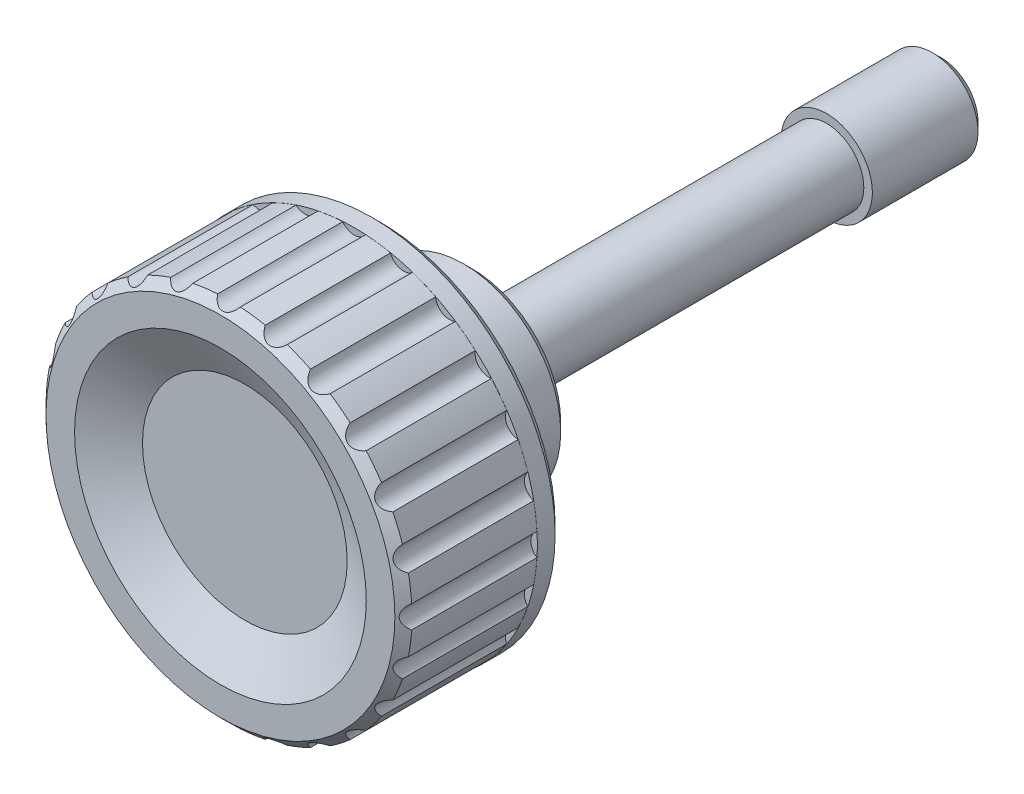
ISO-10303-21;
HEADER;
FILE_DESCRIPTION(('STEP AP214'),'2;1');
FILE_NAME('part.step','',(''),(''),'','','');
FILE_SCHEMA(('AUTOMOTIVE_DESIGN { 1 0 10303 214 1 1 1 1 }'));
ENDSEC;
DATA;
#1=APPLICATION_CONTEXT('core data for automotive mechanical design processes');
#2=APPLICATION_PROTOCOL_DEFINITION('international standard','automotive_design',2000,#1);
#3=PRODUCT_CONTEXT('',#1,'mechanical');
#4=PRODUCT('Part','Part','',(#3));
#5=PRODUCT_RELATED_PRODUCT_CATEGORY('part','',(#4));
#6=PRODUCT_DEFINITION_FORMATION('','',#4);
#7=PRODUCT_DEFINITION_CONTEXT('part definition',#1,'design');
#8=PRODUCT_DEFINITION('design','',#6,#7);
#9=PRODUCT_DEFINITION_SHAPE('','',#8);
#10=(LENGTH_UNIT() NAMED_UNIT(*) SI_UNIT(.MILLI.,.METRE.));
#11=(NAMED_UNIT(*) PLANE_ANGLE_UNIT() SI_UNIT($,.RADIAN.));
#12=(NAMED_UNIT(*) SI_UNIT($,.STERADIAN.) SOLID_ANGLE_UNIT());
#13=UNCERTAINTY_MEASURE_WITH_UNIT(LENGTH_MEASURE(1.E-05),#10,'distance_accuracy_value','');
#14=(GEOMETRIC_REPRESENTATION_CONTEXT(3) GLOBAL_UNCERTAINTY_ASSIGNED_CONTEXT((#13)) GLOBAL_UNIT_ASSIGNED_CONTEXT((#10,
#11,#12)) REPRESENTATION_CONTEXT('',''));
#15=CARTESIAN_POINT('',(0.,0.,0.));
#16=DIRECTION('',(0.,0.,1.));
#17=DIRECTION('',(1.,0.,0.));
#18=AXIS2_PLACEMENT_3D('',#15,#16,#17);
#19=CARTESIAN_POINT('',(0.,0.,0.));
#20=DIRECTION('',(0.,0.,1.));
#21=DIRECTION('',(1.,0.,0.));
#22=AXIS2_PLACEMENT_3D('',#19,#20,#21);
#23=PLANE('',#22);
#24=CARTESIAN_POINT('',(0.,0.,0.));
#25=DIRECTION('',(0.,0.,1.));
#26=DIRECTION('',(1.,0.,0.));
#27=AXIS2_PLACEMENT_3D('',#24,#25,#26);
#28=CIRCLE('',#27,5.33333333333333);
#29=CARTESIAN_POINT('',(5.33333333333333,0.,0.));
#30=VERTEX_POINT('',#29);
#31=EDGE_CURVE('E490',#30,#30,#28,.T.);
#32=ORIENTED_EDGE('',*,*,#31,.F.);
#33=EDGE_LOOP('',(#32));
#34=FACE_BOUND('',#33,.T.);
#35=CARTESIAN_POINT('',(0.,0.,0.));
#36=DIRECTION('',(0.,0.,1.));
#37=DIRECTION('',(1.,0.,0.));
#38=AXIS2_PLACEMENT_3D('',#35,#36,#37);
#39=CIRCLE('',#38,3.25);
#40=CARTESIAN_POINT('',(3.25,0.,0.));
#41=VERTEX_POINT('',#40);
#42=EDGE_CURVE('E543',#41,#41,#39,.T.);
#43=ORIENTED_EDGE('',*,*,#42,.T.);
#44=EDGE_LOOP('',(#43));
#45=FACE_BOUND('',#44,.T.);
#46=ADVANCED_FACE('F14',(#34,#45),#23,.F.);
#47=CARTESIAN_POINT('',(0.,0.,23.75));
#48=DIRECTION('',(0.,0.,1.));
#49=DIRECTION('',(1.,0.,0.));
#50=AXIS2_PLACEMENT_3D('',#47,#48,#49);
#51=CYLINDRICAL_SURFACE('',#50,5.33333333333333);
#52=CARTESIAN_POINT('',(0.,0.,1.));
#53=DIRECTION('',(0.,0.,1.));
#54=DIRECTION('',(1.,0.,0.));
#55=AXIS2_PLACEMENT_3D('',#52,#53,#54);
#56=CIRCLE('',#55,5.33333333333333);
#57=CARTESIAN_POINT('',(5.33333333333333,0.,1.00000000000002));
#58=VERTEX_POINT('',#57);
#59=EDGE_CURVE('E487',#58,#58,#56,.T.);
#60=ORIENTED_EDGE('',*,*,#59,.F.);
#61=EDGE_LOOP('',(#60));
#62=FACE_BOUND('',#61,.T.);
#63=ORIENTED_EDGE('',*,*,#31,.T.);
#64=EDGE_LOOP('',(#63));
#65=FACE_BOUND('',#64,.T.);
#66=ADVANCED_FACE('F531',(#62,#65),#51,.T.);
#67=CARTESIAN_POINT('',(0.,5.33333333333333,1.));
#68=DIRECTION('',(0.,0.,1.));
#69=DIRECTION('',(1.,0.,0.));
#70=AXIS2_PLACEMENT_3D('',#67,#68,#69);
#71=PLANE('',#70);
#72=CARTESIAN_POINT('',(0.,0.,1.));
#73=DIRECTION('',(0.,0.,1.));
#74=DIRECTION('',(1.,0.,0.));
#75=AXIS2_PLACEMENT_3D('',#72,#73,#74);
#76=CIRCLE('',#75,7.75);
#77=CARTESIAN_POINT('',(7.75,0.,1.00000000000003));
#78=VERTEX_POINT('',#77);
#79=EDGE_CURVE('E484',#78,#78,#76,.T.);
#80=ORIENTED_EDGE('',*,*,#79,.F.);
#81=EDGE_LOOP('',(#80));
#82=FACE_BOUND('',#81,.T.);
#83=ORIENTED_EDGE('',*,*,#59,.T.);
#84=EDGE_LOOP('',(#83));
#85=FACE_BOUND('',#84,.T.);
#86=ADVANCED_FACE('F537',(#82,#85),#71,.F.);
#87=CARTESIAN_POINT('',(0.,0.,1.));
#88=DIRECTION('',(0.,0.,1.));
#89=DIRECTION('',(1.,0.,0.));
#90=AXIS2_PLACEMENT_3D('',#87,#88,#89);
#91=CONICAL_SURFACE('',#90,7.75,0.785398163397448);
#92=CARTESIAN_POINT('',(0.,0.,1.75));
#93=DIRECTION('',(0.,0.,1.));
#94=DIRECTION('',(1.,0.,0.));
#95=AXIS2_PLACEMENT_3D('',#92,#93,#94);
#96=CIRCLE('',#95,8.5);
#97=CARTESIAN_POINT('',(8.49999999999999,0.,1.75000000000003));
#98=VERTEX_POINT('',#97);
#99=EDGE_CURVE('E481',#98,#98,#96,.T.);
#100=ORIENTED_EDGE('',*,*,#99,.F.);
#101=EDGE_LOOP('',(#100));
#102=FACE_BOUND('',#101,.T.);
#103=ORIENTED_EDGE('',*,*,#79,.T.);
#104=EDGE_LOOP('',(#103));
#105=FACE_BOUND('',#104,.T.);
#106=ADVANCED_FACE('F1575',(#102,#105),#91,.T.);
#107=CARTESIAN_POINT('',(0.,0.,23.75));
#108=DIRECTION('',(0.,0.,1.));
#109=DIRECTION('',(1.,0.,0.));
#110=AXIS2_PLACEMENT_3D('',#107,#108,#109);
#111=CYLINDRICAL_SURFACE('',#110,8.5);
#112=CARTESIAN_POINT('',(0.,0.,9.));
#113=DIRECTION('',(0.,0.,1.));
#114=DIRECTION('',(1.,0.,0.));
#115=AXIS2_PLACEMENT_3D('',#112,#113,#114);
#116=CIRCLE('',#115,8.5);
#117=CARTESIAN_POINT('',(8.49999999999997,0.,9.00000000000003));
#118=VERTEX_POINT('',#117);
#119=EDGE_CURVE('E478',#118,#118,#116,.T.);
#120=ORIENTED_EDGE('',*,*,#119,.F.);
#121=EDGE_LOOP('',(#120));
#122=FACE_BOUND('',#121,.T.);
#123=ORIENTED_EDGE('',*,*,#99,.T.);
#124=EDGE_LOOP('',(#123));
#125=FACE_BOUND('',#124,.T.);
#126=ADVANCED_FACE('F1565',(#122,#125),#111,.T.);
#127=CARTESIAN_POINT('',(0.,8.5,9.));
#128=DIRECTION('',(0.,0.,1.));
#129=DIRECTION('',(1.,0.,0.));
#130=AXIS2_PLACEMENT_3D('',#127,#128,#129);
#131=PLANE('',#130);
#132=CARTESIAN_POINT('',(0.,0.,9.));
#133=DIRECTION('',(0.,0.,1.));
#134=DIRECTION('',(1.,0.,0.));
#135=AXIS2_PLACEMENT_3D('',#132,#133,#134);
#136=CIRCLE('',#135,8.94736842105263);
#137=CARTESIAN_POINT('',(8.9473684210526,0.,9.00000000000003));
#138=VERTEX_POINT('',#137);
#139=EDGE_CURVE('E475',#138,#138,#136,.T.);
#140=ORIENTED_EDGE('',*,*,#139,.F.);
#141=EDGE_LOOP('',(#140));
#142=FACE_BOUND('',#141,.T.);
#143=ORIENTED_EDGE('',*,*,#119,.T.);
#144=EDGE_LOOP('',(#143));
#145=FACE_BOUND('',#144,.T.);
#146=ADVANCED_FACE('F1555',(#142,#145),#131,.F.);
#147=CARTESIAN_POINT('',(0.,0.,23.75));
#148=DIRECTION('',(0.,0.,1.));
#149=DIRECTION('',(1.,0.,0.));
#150=AXIS2_PLACEMENT_3D('',#147,#148,#149);
#151=CYLINDRICAL_SURFACE('',#150,8.94736842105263);
#152=CARTESIAN_POINT('',(0.,0.,16.));
#153=DIRECTION('',(0.,0.,1.));
#154=DIRECTION('',(1.,0.,0.));
#155=AXIS2_PLACEMENT_3D('',#152,#153,#154);
#156=CIRCLE('',#155,8.94736842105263);
#157=CARTESIAN_POINT('',(8.94736842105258,0.,16.));
#158=VERTEX_POINT('',#157);
#159=EDGE_CURVE('E472',#158,#158,#156,.T.);
#160=ORIENTED_EDGE('',*,*,#159,.F.);
#161=EDGE_LOOP('',(#160));
#162=FACE_BOUND('',#161,.T.);
#163=ORIENTED_EDGE('',*,*,#139,.T.);
#164=EDGE_LOOP('',(#163));
#165=FACE_BOUND('',#164,.T.);
#166=ADVANCED_FACE('F1545',(#162,#165),#151,.T.);
#167=CARTESIAN_POINT('',(0.,8.94736842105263,16.));
#168=DIRECTION('',(0.,0.,1.));
#169=DIRECTION('',(1.,0.,0.));
#170=AXIS2_PLACEMENT_3D('',#167,#168,#169);
#171=PLANE('',#170);
#172=CARTESIAN_POINT('',(0.,0.,16.));
#173=DIRECTION('',(0.,0.,1.));
#174=DIRECTION('',(1.,0.,0.));
#175=AXIS2_PLACEMENT_3D('',#172,#173,#174);
#176=CIRCLE('',#175,13.9130434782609);
#177=CARTESIAN_POINT('',(13.9130434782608,0.,16.));
#178=VERTEX_POINT('',#177);
#179=EDGE_CURVE('E469',#178,#178,#176,.T.);
#180=ORIENTED_EDGE('',*,*,#179,.F.);
#181=EDGE_LOOP('',(#180));
#182=FACE_BOUND('',#181,.T.);
#183=ORIENTED_EDGE('',*,*,#159,.T.);
#184=EDGE_LOOP('',(#183));
#185=FACE_BOUND('',#184,.T.);
#186=ADVANCED_FACE('F1536',(#182,#185),#171,.F.);
#187=CARTESIAN_POINT('',(0.,0.,23.75));
#188=DIRECTION('',(0.,0.,1.));
#189=DIRECTION('',(1.,0.,0.));
#190=AXIS2_PLACEMENT_3D('',#187,#188,#189);
#191=CYLINDRICAL_SURFACE('',#190,13.9130434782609);
#192=CARTESIAN_POINT('',(0.,0.,9.));
#193=DIRECTION('',(0.,0.,1.));
#194=DIRECTION('',(1.,0.,0.));
#195=AXIS2_PLACEMENT_3D('',#192,#193,#194);
#196=CIRCLE('',#195,13.9130434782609);
#197=CARTESIAN_POINT('',(13.9130434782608,0.,9.00000000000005));
#198=VERTEX_POINT('',#197);
#199=EDGE_CURVE('E339',#198,#198,#196,.T.);
#200=ORIENTED_EDGE('',*,*,#199,.F.);
#201=EDGE_LOOP('',(#200));
#202=FACE_BOUND('',#201,.T.);
#203=ORIENTED_EDGE('',*,*,#179,.T.);
#204=EDGE_LOOP('',(#203));
#205=FACE_BOUND('',#204,.T.);
#206=ADVANCED_FACE('F1110',(#202,#205),#191,.F.);
#207=CARTESIAN_POINT('',(0.,13.9130434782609,11.3));
#208=DIRECTION('',(0.,0.,1.));
#209=DIRECTION('',(1.,0.,0.));
#210=AXIS2_PLACEMENT_3D('',#207,#208,#209);
#211=PLANE('',#210);
#212=CARTESIAN_POINT('',(0.,0.,11.3));
#213=DIRECTION('',(0.,0.,1.));
#214=DIRECTION('',(1.,0.,0.));
#215=AXIS2_PLACEMENT_3D('',#212,#213,#214);
#216=CIRCLE('',#215,16.01);
#217=CARTESIAN_POINT('',(16.01,0.,11.3000000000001));
#218=VERTEX_POINT('',#217);
#219=EDGE_CURVE('E565',#218,#218,#216,.T.);
#220=ORIENTED_EDGE('',*,*,#219,.T.);
#221=EDGE_LOOP('',(#220));
#222=FACE_BOUND('',#221,.T.);
#223=CARTESIAN_POINT('',(-16.0730057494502,4.30674891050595,11.3));
#224=DIRECTION('',(0.,0.,1.));
#225=DIRECTION('',(1.,0.,0.));
#226=AXIS2_PLACEMENT_3D('',#223,#224,#225);
#227=CIRCLE('',#226,1.2);
#228=CARTESIAN_POINT('',(-15.6824037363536,3.17209915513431,11.3));
#229=VERTEX_POINT('',#228);
#230=CARTESIAN_POINT('',(-15.1674096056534,5.09408341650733,11.3));
#231=VERTEX_POINT('',#230);
#232=EDGE_CURVE('E333',#229,#231,#227,.T.);
#233=ORIENTED_EDGE('',*,*,#232,.T.);
#234=CARTESIAN_POINT('',(3.33511808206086E-13,-1.66533453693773E-13,11.3));
#235=DIRECTION('',(0.,0.,1.));
#236=DIRECTION('',(1.,0.,0.));
#237=AXIS2_PLACEMENT_3D('',#234,#235,#236);
#238=CIRCLE('',#237,16.0000000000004);
#239=CARTESIAN_POINT('',(-14.3270391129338,7.1229172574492,11.3));
#240=VERTEX_POINT('',#239);
#241=EDGE_CURVE('E458',#240,#231,#238,.T.);
#242=ORIENTED_EDGE('',*,*,#241,.F.);
#243=CARTESIAN_POINT('',(-14.4106627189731,8.32,11.3));
#244=DIRECTION('',(0.,0.,1.));
#245=DIRECTION('',(1.,0.,0.));
#246=AXIS2_PLACEMENT_3D('',#243,#244,#245);
#247=CIRCLE('',#246,1.2);
#248=CARTESIAN_POINT('',(-13.3321468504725,8.84612120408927,11.3));
#249=VERTEX_POINT('',#248);
#250=EDGE_CURVE('E455',#240,#249,#247,.T.);
#251=ORIENTED_EDGE('',*,*,#250,.T.);
#252=CARTESIAN_POINT('',(3.92492406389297E-13,-3.05311331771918E-13,11.3));
#253=DIRECTION('',(0.,0.,1.));
#254=DIRECTION('',(1.,0.,0.));
#255=AXIS2_PLACEMENT_3D('',#252,#253,#254);
#256=CIRCLE('',#255,16.0000000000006);
#257=CARTESIAN_POINT('',(-11.9953104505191,10.5883203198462,11.3));
#258=VERTEX_POINT('',#257);
#259=EDGE_CURVE('E453',#258,#249,#256,.T.);
#260=ORIENTED_EDGE('',*,*,#259,.F.);
#261=CARTESIAN_POINT('',(-11.7662568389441,11.7662568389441,11.3));
#262=DIRECTION('',(0.,0.,1.));
#263=DIRECTION('',(1.,0.,0.));
#264=AXIS2_PLACEMENT_3D('',#261,#262,#263);
#265=CIRCLE('',#264,1.2);
#266=CARTESIAN_POINT('',(-10.5883203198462,11.9953104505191,11.3));
#267=VERTEX_POINT('',#266);
#268=EDGE_CURVE('E450',#258,#267,#265,.T.);
#269=ORIENTED_EDGE('',*,*,#268,.T.);
#270=CARTESIAN_POINT('',(0.,-1.43982048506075E-13,11.3));
#271=DIRECTION('',(0.,0.,1.));
#272=DIRECTION('',(1.,0.,0.));
#273=AXIS2_PLACEMENT_3D('',#270,#271,#272);
#274=CIRCLE('',#273,16.);
#275=CARTESIAN_POINT('',(-8.84612120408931,13.3321468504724,11.3));
#276=VERTEX_POINT('',#275);
#277=EDGE_CURVE('E448',#276,#267,#274,.T.);
#278=ORIENTED_EDGE('',*,*,#277,.F.);
#279=CARTESIAN_POINT('',(-8.32,14.410662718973,11.3));
#280=DIRECTION('',(0.,0.,1.));
#281=DIRECTION('',(1.,0.,0.));
#282=AXIS2_PLACEMENT_3D('',#279,#280,#281);
#283=CIRCLE('',#282,1.2);
#284=CARTESIAN_POINT('',(-7.12291725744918,14.3270391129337,11.3));
#285=VERTEX_POINT('',#284);
#286=EDGE_CURVE('E445',#276,#285,#283,.T.);
#287=ORIENTED_EDGE('',*,*,#286,.T.);
#288=CARTESIAN_POINT('',(2.45040910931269E-13,-7.68482499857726E-13,11.3));
#289=DIRECTION('',(0.,0.,1.));
#290=DIRECTION('',(1.,0.,0.));
#291=AXIS2_PLACEMENT_3D('',#288,#289,#290);
#292=CIRCLE('',#291,16.0000000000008);
#293=CARTESIAN_POINT('',(-5.09408341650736,15.1674096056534,11.3));
#294=VERTEX_POINT('',#293);
#295=EDGE_CURVE('E443',#294,#285,#292,.T.);
#296=ORIENTED_EDGE('',*,*,#295,.F.);
#297=CARTESIAN_POINT('',(-4.30674891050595,16.07300574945,11.3));
#298=DIRECTION('',(0.,0.,1.));
#299=DIRECTION('',(1.,0.,0.));
#300=AXIS2_PLACEMENT_3D('',#297,#298,#299);
#301=CIRCLE('',#300,1.2);
#302=CARTESIAN_POINT('',(-3.17209915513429,15.6824037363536,11.3));
#303=VERTEX_POINT('',#302);
#304=EDGE_CURVE('E440',#294,#303,#301,.T.);
#305=ORIENTED_EDGE('',*,*,#304,.T.);
#306=CARTESIAN_POINT('',(0.,-7.07767178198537E-13,11.3));
#307=DIRECTION('',(0.,0.,1.));
#308=DIRECTION('',(1.,0.,0.));
#309=AXIS2_PLACEMENT_3D('',#306,#307,#308);
#310=CIRCLE('',#309,16.0000000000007);
#311=CARTESIAN_POINT('',(-0.994892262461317,15.9690384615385,11.3));
#312=VERTEX_POINT('',#311);
#313=EDGE_CURVE('E438',#312,#303,#310,.T.);
#314=ORIENTED_EDGE('',*,*,#313,.F.);
#315=CARTESIAN_POINT('',(0.,16.64,11.3));
#316=DIRECTION('',(0.,0.,1.));
#317=DIRECTION('',(1.,0.,0.));
#318=AXIS2_PLACEMENT_3D('',#315,#316,#317);
#319=CIRCLE('',#318,1.2);
#320=CARTESIAN_POINT('',(0.994892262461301,15.9690384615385,11.3));
#321=VERTEX_POINT('',#320);
#322=EDGE_CURVE('E436',#312,#321,#319,.T.);
#323=ORIENTED_EDGE('',*,*,#322,.T.);
#324=CARTESIAN_POINT('',(-1.15347891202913E-13,-5.62050406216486E-13,11.3));
#325=DIRECTION('',(0.,0.,1.));
#326=DIRECTION('',(1.,0.,0.));
#327=AXIS2_PLACEMENT_3D('',#324,#325,#326);
#328=CIRCLE('',#327,16.0000000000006);
#329=CARTESIAN_POINT('',(3.17209915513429,15.6824037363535,11.3));
#330=VERTEX_POINT('',#329);
#331=EDGE_CURVE('E433',#330,#321,#328,.T.);
#332=ORIENTED_EDGE('',*,*,#331,.F.);
#333=CARTESIAN_POINT('',(4.30674891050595,16.07300574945,11.3));
#334=DIRECTION('',(0.,0.,1.));
#335=DIRECTION('',(1.,0.,0.));
#336=AXIS2_PLACEMENT_3D('',#333,#334,#335);
#337=CIRCLE('',#336,1.2);
#338=CARTESIAN_POINT('',(5.09408341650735,15.1674096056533,11.3));
#339=VERTEX_POINT('',#338);
#340=EDGE_CURVE('E430',#330,#339,#337,.T.);
#341=ORIENTED_EDGE('',*,*,#340,.T.);
#342=CARTESIAN_POINT('',(0.,1.02348685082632E-13,11.3));
#343=DIRECTION('',(0.,0.,1.));
#344=DIRECTION('',(1.,0.,0.));
#345=AXIS2_PLACEMENT_3D('',#342,#343,#344);
#346=CIRCLE('',#345,16.);
#347=CARTESIAN_POINT('',(7.12291725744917,14.3270391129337,11.3));
#348=VERTEX_POINT('',#347);
#349=EDGE_CURVE('E428',#348,#339,#346,.T.);
#350=ORIENTED_EDGE('',*,*,#349,.F.);
#351=CARTESIAN_POINT('',(8.32,14.410662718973,11.3));
#352=DIRECTION('',(0.,0.,1.));
#353=DIRECTION('',(1.,0.,0.));
#354=AXIS2_PLACEMENT_3D('',#351,#352,#353);
#355=CIRCLE('',#354,1.2);
#356=CARTESIAN_POINT('',(8.84612120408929,13.3321468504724,11.3));
#357=VERTEX_POINT('',#356);
#358=EDGE_CURVE('E425',#348,#357,#355,.T.);
#359=ORIENTED_EDGE('',*,*,#358,.T.);
#360=CARTESIAN_POINT('',(1.72182524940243E-13,2.77555756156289E-13,11.3));
#361=DIRECTION('',(0.,0.,1.));
#362=DIRECTION('',(1.,0.,0.));
#363=AXIS2_PLACEMENT_3D('',#360,#361,#362);
#364=CIRCLE('',#363,15.9999999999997);
#365=CARTESIAN_POINT('',(10.5883203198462,11.995310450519,11.3));
#366=VERTEX_POINT('',#365);
#367=EDGE_CURVE('E423',#366,#357,#364,.T.);
#368=ORIENTED_EDGE('',*,*,#367,.F.);
#369=CARTESIAN_POINT('',(11.7662568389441,11.7662568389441,11.3));
#370=DIRECTION('',(0.,0.,1.));
#371=DIRECTION('',(1.,0.,0.));
#372=AXIS2_PLACEMENT_3D('',#369,#370,#371);
#373=CIRCLE('',#372,1.2);
#374=CARTESIAN_POINT('',(11.995310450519,10.5883203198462,11.3));
#375=VERTEX_POINT('',#374);
#376=EDGE_CURVE('E420',#366,#375,#373,.T.);
#377=ORIENTED_EDGE('',*,*,#376,.T.);
#378=CARTESIAN_POINT('',(-2.21599704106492E-13,-1.37043154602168E-13,11.3));
#379=DIRECTION('',(0.,0.,1.));
#380=DIRECTION('',(1.,0.,0.));
#381=AXIS2_PLACEMENT_3D('',#378,#379,#380);
#382=CIRCLE('',#381,16.0000000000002);
#383=CARTESIAN_POINT('',(13.3321468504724,8.84612120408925,11.3));
#384=VERTEX_POINT('',#383);
#385=EDGE_CURVE('E418',#384,#375,#382,.T.);
#386=ORIENTED_EDGE('',*,*,#385,.F.);
#387=CARTESIAN_POINT('',(14.410662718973,8.32,11.3));
#388=DIRECTION('',(0.,0.,1.));
#389=DIRECTION('',(1.,0.,0.));
#390=AXIS2_PLACEMENT_3D('',#387,#388,#389);
#391=CIRCLE('',#390,1.2);
#392=CARTESIAN_POINT('',(14.3270391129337,7.12291725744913,11.3));
#393=VERTEX_POINT('',#392);
#394=EDGE_CURVE('E415',#384,#393,#391,.T.);
#395=ORIENTED_EDGE('',*,*,#394,.T.);
#396=CARTESIAN_POINT('',(-4.38440138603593E-13,-1.52655665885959E-13,11.3));
#397=DIRECTION('',(0.,0.,1.));
#398=DIRECTION('',(1.,0.,0.));
#399=AXIS2_PLACEMENT_3D('',#396,#397,#398);
#400=CIRCLE('',#399,16.0000000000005);
#401=CARTESIAN_POINT('',(15.1674096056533,5.0940834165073,11.3));
#402=VERTEX_POINT('',#401);
#403=EDGE_CURVE('E413',#402,#393,#400,.T.);
#404=ORIENTED_EDGE('',*,*,#403,.F.);
#405=CARTESIAN_POINT('',(16.07300574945,4.30674891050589,11.3));
#406=DIRECTION('',(0.,0.,1.));
#407=DIRECTION('',(1.,0.,0.));
#408=AXIS2_PLACEMENT_3D('',#405,#406,#407);
#409=CIRCLE('',#408,1.2);
#410=CARTESIAN_POINT('',(15.6824037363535,3.17209915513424,11.3));
#411=VERTEX_POINT('',#410);
#412=EDGE_CURVE('E410',#402,#411,#409,.T.);
#413=ORIENTED_EDGE('',*,*,#412,.T.);
#414=CARTESIAN_POINT('',(0.,0.,11.3));
#415=DIRECTION('',(0.,0.,1.));
#416=DIRECTION('',(1.,0.,0.));
#417=AXIS2_PLACEMENT_3D('',#414,#415,#416);
#418=CIRCLE('',#417,16.);
#419=CARTESIAN_POINT('',(15.9690384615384,0.994892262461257,11.3));
#420=VERTEX_POINT('',#419);
#421=EDGE_CURVE('E408',#420,#411,#418,.T.);
#422=ORIENTED_EDGE('',*,*,#421,.F.);
#423=CARTESIAN_POINT('',(16.64,0.,11.3));
#424=DIRECTION('',(0.,0.,1.));
#425=DIRECTION('',(1.,0.,0.));
#426=AXIS2_PLACEMENT_3D('',#423,#424,#425);
#427=CIRCLE('',#426,1.2);
#428=CARTESIAN_POINT('',(15.9690384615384,-0.994892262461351,11.3));
#429=VERTEX_POINT('',#428);
#430=EDGE_CURVE('E405',#420,#429,#427,.T.);
#431=ORIENTED_EDGE('',*,*,#430,.T.);
#432=CARTESIAN_POINT('',(-5.94565251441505E-13,0.,11.3));
#433=DIRECTION('',(0.,0.,1.));
#434=DIRECTION('',(1.,0.,0.));
#435=AXIS2_PLACEMENT_3D('',#432,#433,#434);
#436=CIRCLE('',#435,16.0000000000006);
#437=CARTESIAN_POINT('',(15.6824037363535,-3.17209915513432,11.3));
#438=VERTEX_POINT('',#437);
#439=EDGE_CURVE('E403',#438,#429,#436,.T.);
#440=ORIENTED_EDGE('',*,*,#439,.F.);
#441=CARTESIAN_POINT('',(16.07300574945,-4.30674891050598,11.3));
#442=DIRECTION('',(0.,0.,1.));
#443=DIRECTION('',(1.,0.,0.));
#444=AXIS2_PLACEMENT_3D('',#441,#442,#443);
#445=CIRCLE('',#444,1.2);
#446=CARTESIAN_POINT('',(15.1674096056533,-5.09408341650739,11.3));
#447=VERTEX_POINT('',#446);
#448=EDGE_CURVE('E400',#438,#447,#445,.T.);
#449=ORIENTED_EDGE('',*,*,#448,.T.);
#450=CARTESIAN_POINT('',(-1.50476041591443E-13,0.,11.3));
#451=DIRECTION('',(0.,0.,1.));
#452=DIRECTION('',(1.,0.,0.));
#453=AXIS2_PLACEMENT_3D('',#450,#451,#452);
#454=CIRCLE('',#453,16.);
#455=CARTESIAN_POINT('',(14.3270391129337,-7.12291725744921,11.3));
#456=VERTEX_POINT('',#455);
#457=EDGE_CURVE('E398',#456,#447,#454,.T.);
#458=ORIENTED_EDGE('',*,*,#457,.F.);
#459=CARTESIAN_POINT('',(14.410662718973,-8.32,11.3));
#460=DIRECTION('',(0.,0.,1.));
#461=DIRECTION('',(1.,0.,0.));
#462=AXIS2_PLACEMENT_3D('',#459,#460,#461);
#463=CIRCLE('',#462,1.2);
#464=CARTESIAN_POINT('',(13.3321468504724,-8.84612120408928,11.3));
#465=VERTEX_POINT('',#464);
#466=EDGE_CURVE('E395',#456,#465,#463,.T.);
#467=ORIENTED_EDGE('',*,*,#466,.T.);
#468=CARTESIAN_POINT('',(1.02793585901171E-13,-1.196959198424E-13,11.3));
#469=DIRECTION('',(0.,0.,1.));
#470=DIRECTION('',(1.,0.,0.));
#471=AXIS2_PLACEMENT_3D('',#468,#469,#470);
#472=CIRCLE('',#471,16.);
#473=CARTESIAN_POINT('',(11.995310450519,-10.5883203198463,11.3));
#474=VERTEX_POINT('',#473);
#475=EDGE_CURVE('E393',#474,#465,#472,.T.);
#476=ORIENTED_EDGE('',*,*,#475,.F.);
#477=CARTESIAN_POINT('',(11.7662568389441,-11.7662568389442,11.3));
#478=DIRECTION('',(0.,0.,1.));
#479=DIRECTION('',(1.,0.,0.));
#480=AXIS2_PLACEMENT_3D('',#477,#478,#479);
#481=CIRCLE('',#480,1.2);
#482=CARTESIAN_POINT('',(10.5883203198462,-11.995310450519,11.3));
#483=VERTEX_POINT('',#482);
#484=EDGE_CURVE('E390',#474,#483,#481,.T.);
#485=ORIENTED_EDGE('',*,*,#484,.T.);
#486=CARTESIAN_POINT('',(-9.18958541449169E-13,1.14491749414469E-12,11.3));
#487=DIRECTION('',(0.,0.,1.));
#488=DIRECTION('',(1.,0.,0.));
#489=AXIS2_PLACEMENT_3D('',#486,#487,#488);
#490=CIRCLE('',#489,16.0000000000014);
#491=CARTESIAN_POINT('',(8.84612120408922,-13.3321468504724,11.3));
#492=VERTEX_POINT('',#491);
#493=EDGE_CURVE('E388',#492,#483,#490,.T.);
#494=ORIENTED_EDGE('',*,*,#493,.F.);
#495=CARTESIAN_POINT('',(8.32,-14.4106627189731,11.3));
#496=DIRECTION('',(0.,0.,1.));
#497=DIRECTION('',(1.,0.,0.));
#498=AXIS2_PLACEMENT_3D('',#495,#496,#497);
#499=CIRCLE('',#498,1.2);
#500=CARTESIAN_POINT('',(7.12291725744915,-14.3270391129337,11.3));
#501=VERTEX_POINT('',#500);
#502=EDGE_CURVE('E385',#492,#501,#499,.T.);
#503=ORIENTED_EDGE('',*,*,#502,.T.);
#504=CARTESIAN_POINT('',(0.,0.,11.3));
#505=DIRECTION('',(0.,0.,1.));
#506=DIRECTION('',(1.,0.,0.));
#507=AXIS2_PLACEMENT_3D('',#504,#505,#506);
#508=CIRCLE('',#507,16.);
#509=CARTESIAN_POINT('',(5.09408341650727,-15.1674096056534,11.3));
#510=VERTEX_POINT('',#509);
#511=EDGE_CURVE('E383',#510,#501,#508,.T.);
#512=ORIENTED_EDGE('',*,*,#511,.F.);
#513=CARTESIAN_POINT('',(4.30674891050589,-16.0730057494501,11.3));
#514=DIRECTION('',(0.,0.,1.));
#515=DIRECTION('',(1.,0.,0.));
#516=AXIS2_PLACEMENT_3D('',#513,#514,#515);
#517=CIRCLE('',#516,1.2);
#518=CARTESIAN_POINT('',(3.17209915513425,-15.6824037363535,11.3));
#519=VERTEX_POINT('',#518);
#520=EDGE_CURVE('E380',#510,#519,#517,.T.);
#521=ORIENTED_EDGE('',*,*,#520,.T.);
#522=CARTESIAN_POINT('',(0.,0.,11.3));
#523=DIRECTION('',(0.,0.,1.));
#524=DIRECTION('',(1.,0.,0.));
#525=AXIS2_PLACEMENT_3D('',#522,#523,#524);
#526=CIRCLE('',#525,16.);
#527=CARTESIAN_POINT('',(0.994892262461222,-15.9690384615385,11.3));
#528=VERTEX_POINT('',#527);
#529=EDGE_CURVE('E378',#528,#519,#526,.T.);
#530=ORIENTED_EDGE('',*,*,#529,.F.);
#531=CARTESIAN_POINT('',(0.,-16.64,11.3));
#532=DIRECTION('',(0.,0.,1.));
#533=DIRECTION('',(1.,0.,0.));
#534=AXIS2_PLACEMENT_3D('',#531,#532,#533);
#535=CIRCLE('',#534,1.2);
#536=CARTESIAN_POINT('',(-0.994892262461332,-15.9690384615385,11.3));
#537=VERTEX_POINT('',#536);
#538=EDGE_CURVE('E375',#528,#537,#535,.T.);
#539=ORIENTED_EDGE('',*,*,#538,.T.);
#540=CARTESIAN_POINT('',(0.,4.85722573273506E-13,11.3));
#541=DIRECTION('',(0.,0.,1.));
#542=DIRECTION('',(1.,0.,0.));
#543=AXIS2_PLACEMENT_3D('',#540,#541,#542);
#544=CIRCLE('',#543,16.0000000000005);
#545=CARTESIAN_POINT('',(-3.17209915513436,-15.6824037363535,11.3));
#546=VERTEX_POINT('',#545);
#547=EDGE_CURVE('E373',#546,#537,#544,.T.);
#548=ORIENTED_EDGE('',*,*,#547,.F.);
#549=CARTESIAN_POINT('',(-4.306748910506,-16.0730057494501,11.3));
#550=DIRECTION('',(0.,0.,1.));
#551=DIRECTION('',(1.,0.,0.));
#552=AXIS2_PLACEMENT_3D('',#549,#550,#551);
#553=CIRCLE('',#552,1.2);
#554=CARTESIAN_POINT('',(-5.09408341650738,-15.1674096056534,11.3));
#555=VERTEX_POINT('',#554);
#556=EDGE_CURVE('E370',#546,#555,#553,.T.);
#557=ORIENTED_EDGE('',*,*,#556,.T.);
#558=CARTESIAN_POINT('',(3.57797936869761E-13,9.76649316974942E-13,11.3));
#559=DIRECTION('',(0.,0.,1.));
#560=DIRECTION('',(1.,0.,0.));
#561=AXIS2_PLACEMENT_3D('',#558,#559,#560);
#562=CIRCLE('',#561,16.0000000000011);
#563=CARTESIAN_POINT('',(-7.12291725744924,-14.3270391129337,11.3));
#564=VERTEX_POINT('',#563);
#565=EDGE_CURVE('E368',#564,#555,#562,.T.);
#566=ORIENTED_EDGE('',*,*,#565,.F.);
#567=CARTESIAN_POINT('',(-8.32,-14.4106627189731,11.3));
#568=DIRECTION('',(0.,0.,1.));
#569=DIRECTION('',(1.,0.,0.));
#570=AXIS2_PLACEMENT_3D('',#567,#568,#569);
#571=CIRCLE('',#570,1.2);
#572=CARTESIAN_POINT('',(-8.84612120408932,-13.3321468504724,11.3));
#573=VERTEX_POINT('',#572);
#574=EDGE_CURVE('E365',#564,#573,#571,.T.);
#575=ORIENTED_EDGE('',*,*,#574,.T.);
#576=CARTESIAN_POINT('',(2.58918698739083E-13,4.14598910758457E-13,11.3));
#577=DIRECTION('',(0.,0.,1.));
#578=DIRECTION('',(1.,0.,0.));
#579=AXIS2_PLACEMENT_3D('',#576,#577,#578);
#580=CIRCLE('',#579,16.0000000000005);
#581=CARTESIAN_POINT('',(-10.5883203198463,-11.995310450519,11.3));
#582=VERTEX_POINT('',#581);
#583=EDGE_CURVE('E363',#582,#573,#580,.T.);
#584=ORIENTED_EDGE('',*,*,#583,.F.);
#585=CARTESIAN_POINT('',(-11.7662568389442,-11.7662568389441,11.3));
#586=DIRECTION('',(0.,0.,1.));
#587=DIRECTION('',(1.,0.,0.));
#588=AXIS2_PLACEMENT_3D('',#585,#586,#587);
#589=CIRCLE('',#588,1.2);
#590=CARTESIAN_POINT('',(-11.9953104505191,-10.5883203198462,11.3));
#591=VERTEX_POINT('',#590);
#592=EDGE_CURVE('E360',#582,#591,#589,.T.);
#593=ORIENTED_EDGE('',*,*,#592,.T.);
#594=CARTESIAN_POINT('',(0.,0.,11.3));
#595=DIRECTION('',(0.,0.,1.));
#596=DIRECTION('',(1.,0.,0.));
#597=AXIS2_PLACEMENT_3D('',#594,#595,#596);
#598=CIRCLE('',#597,16.);
#599=CARTESIAN_POINT('',(-13.3321468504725,-8.84612120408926,11.3));
#600=VERTEX_POINT('',#599);
#601=EDGE_CURVE('E358',#600,#591,#598,.T.);
#602=ORIENTED_EDGE('',*,*,#601,.F.);
#603=CARTESIAN_POINT('',(-14.4106627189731,-8.32,11.3));
#604=DIRECTION('',(0.,0.,1.));
#605=DIRECTION('',(1.,0.,0.));
#606=AXIS2_PLACEMENT_3D('',#603,#604,#605);
#607=CIRCLE('',#606,1.2);
#608=CARTESIAN_POINT('',(-14.3270391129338,-7.12291725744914,11.3));
#609=VERTEX_POINT('',#608);
#610=EDGE_CURVE('E355',#600,#609,#607,.T.);
#611=ORIENTED_EDGE('',*,*,#610,.T.);
#612=CARTESIAN_POINT('',(-6.74362531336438E-13,-2.75821032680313E-13,11.3));
#613=DIRECTION('',(0.,0.,1.));
#614=DIRECTION('',(1.,0.,0.));
#615=AXIS2_PLACEMENT_3D('',#612,#613,#614);
#616=CIRCLE('',#615,15.9999999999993);
#617=CARTESIAN_POINT('',(-15.1674096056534,-5.09408341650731,11.3));
#618=VERTEX_POINT('',#617);
#619=EDGE_CURVE('E353',#618,#609,#616,.T.);
#620=ORIENTED_EDGE('',*,*,#619,.F.);
#621=CARTESIAN_POINT('',(-16.0730057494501,-4.3067489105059,11.3));
#622=DIRECTION('',(0.,0.,1.));
#623=DIRECTION('',(1.,0.,0.));
#624=AXIS2_PLACEMENT_3D('',#621,#622,#623);
#625=CIRCLE('',#624,1.2);
#626=CARTESIAN_POINT('',(-15.6824037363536,-3.17209915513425,11.3));
#627=VERTEX_POINT('',#626);
#628=EDGE_CURVE('E346',#618,#627,#625,.T.);
#629=ORIENTED_EDGE('',*,*,#628,.T.);
#630=CARTESIAN_POINT('',(-1.19824902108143E-12,-1.81061762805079E-13,11.3));
#631=DIRECTION('',(0.,0.,1.));
#632=DIRECTION('',(1.,0.,0.));
#633=AXIS2_PLACEMENT_3D('',#630,#631,#632);
#634=CIRCLE('',#633,15.9999999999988);
#635=CARTESIAN_POINT('',(-15.9690384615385,-0.994892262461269,11.3));
#636=VERTEX_POINT('',#635);
#637=EDGE_CURVE('E344',#636,#627,#634,.T.);
#638=ORIENTED_EDGE('',*,*,#637,.F.);
#639=CARTESIAN_POINT('',(-16.64,0.,11.3));
#640=DIRECTION('',(0.,0.,1.));
#641=DIRECTION('',(1.,0.,0.));
#642=AXIS2_PLACEMENT_3D('',#639,#640,#641);
#643=CIRCLE('',#642,1.2);
#644=CARTESIAN_POINT('',(-15.9690384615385,0.994892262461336,11.3));
#645=VERTEX_POINT('',#644);
#646=EDGE_CURVE('E336',#636,#645,#643,.T.);
#647=ORIENTED_EDGE('',*,*,#646,.T.);
#648=CARTESIAN_POINT('',(-9.34571052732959E-13,1.34007388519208E-13,11.3));
#649=DIRECTION('',(0.,0.,1.));
#650=DIRECTION('',(1.,0.,0.));
#651=AXIS2_PLACEMENT_3D('',#648,#649,#650);
#652=CIRCLE('',#651,15.9999999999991);
#653=EDGE_CURVE('E324',#229,#645,#652,.T.);
#654=ORIENTED_EDGE('',*,*,#653,.F.);
#655=EDGE_LOOP('',(#233,#242,#251,#260,#269,#278,#287,#296,#305,#314,#323,#332,#341,#350,#359,
#368,#377,#386,#395,#404,#413,#422,#431,#440,#449,#458,#467,#476,#485,#494,#503,#512,#521,#530,
#539,#548,#557,#566,#575,#584,#593,#602,#611,#620,#629,#638,#647,#654));
#656=FACE_BOUND('',#655,.T.);
#657=ADVANCED_FACE('F342',(#222,#656),#211,.T.);
#658=CARTESIAN_POINT('',(0.,15.26,9.));
#659=DIRECTION('',(0.,0.,-1.));
#660=DIRECTION('',(-1.,0.,0.));
#661=AXIS2_PLACEMENT_3D('',#658,#659,#660);
#662=PLANE('',#661);
#663=ORIENTED_EDGE('',*,*,#199,.T.);
#664=EDGE_LOOP('',(#663));
#665=FACE_BOUND('',#664,.T.);
#666=CARTESIAN_POINT('',(0.,0.,9.));
#667=DIRECTION('',(0.,0.,1.));
#668=DIRECTION('',(1.,0.,0.));
#669=AXIS2_PLACEMENT_3D('',#666,#667,#668);
#670=CIRCLE('',#669,15.26);
#671=CARTESIAN_POINT('',(15.26,0.,9.00000000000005));
#672=VERTEX_POINT('',#671);
#673=EDGE_CURVE('E559',#672,#672,#670,.T.);
#674=ORIENTED_EDGE('',*,*,#673,.F.);
#675=EDGE_LOOP('',(#674));
#676=FACE_BOUND('',#675,.T.);
#677=ADVANCED_FACE('F1103',(#665,#676),#662,.T.);
#678=CARTESIAN_POINT('',(0.,0.,23.));
#679=DIRECTION('',(0.,0.,1.));
#680=DIRECTION('',(1.,0.,0.));
#681=AXIS2_PLACEMENT_3D('',#678,#679,#680);
#682=CYLINDRICAL_SURFACE('',#681,16.01);
#683=CARTESIAN_POINT('',(0.,0.,9.75));
#684=DIRECTION('',(0.,0.,1.));
#685=DIRECTION('',(1.,0.,0.));
#686=AXIS2_PLACEMENT_3D('',#683,#684,#685);
#687=CIRCLE('',#686,16.01);
#688=CARTESIAN_POINT('',(16.01,0.,9.75000000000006));
#689=VERTEX_POINT('',#688);
#690=EDGE_CURVE('E562',#689,#689,#687,.T.);
#691=ORIENTED_EDGE('',*,*,#690,.T.);
#692=EDGE_LOOP('',(#691));
#693=FACE_BOUND('',#692,.T.);
#694=ORIENTED_EDGE('',*,*,#219,.F.);
#695=EDGE_LOOP('',(#694));
#696=FACE_BOUND('',#695,.T.);
#697=ADVANCED_FACE('F1106',(#693,#696),#682,.T.);
#698=CARTESIAN_POINT('',(0.,0.,9.75));
#699=DIRECTION('',(0.,0.,1.));
#700=DIRECTION('',(1.,0.,0.));
#701=AXIS2_PLACEMENT_3D('',#698,#699,#700);
#702=CONICAL_SURFACE('',#701,16.01,0.785398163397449);
#703=ORIENTED_EDGE('',*,*,#673,.T.);
#704=EDGE_LOOP('',(#703));
#705=FACE_BOUND('',#704,.T.);
#706=ORIENTED_EDGE('',*,*,#690,.F.);
#707=EDGE_LOOP('',(#706));
#708=FACE_BOUND('',#707,.T.);
#709=ADVANCED_FACE('F515',(#705,#708),#702,.T.);
#710=CARTESIAN_POINT('',(0.,8.94736842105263,20.8666666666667));
#711=DIRECTION('',(0.,0.,-1.));
#712=DIRECTION('',(-1.,0.,0.));
#713=AXIS2_PLACEMENT_3D('',#710,#711,#712);
#714=PLANE('',#713);
#715=CARTESIAN_POINT('',(0.,0.,20.8666666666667));
#716=DIRECTION('',(0.,0.,1.));
#717=DIRECTION('',(1.,0.,0.));
#718=AXIS2_PLACEMENT_3D('',#715,#716,#717);
#719=CIRCLE('',#718,8.94736842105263);
#720=CARTESIAN_POINT('',(8.94736842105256,0.,20.8666666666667));
#721=VERTEX_POINT('',#720);
#722=EDGE_CURVE('E332',#721,#721,#719,.T.);
#723=ORIENTED_EDGE('',*,*,#722,.T.);
#724=EDGE_LOOP('',(#723));
#725=FACE_BOUND('',#724,.T.);
#726=ADVANCED_FACE('F511',(#725),#714,.F.);
#727=CARTESIAN_POINT('',(0.,0.,23.));
#728=DIRECTION('',(0.,0.,1.));
#729=DIRECTION('',(1.,0.,0.));
#730=AXIS2_PLACEMENT_3D('',#727,#728,#729);
#731=CONICAL_SURFACE('',#730,12.75,1.05953565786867);
#732=ORIENTED_EDGE('',*,*,#722,.F.);
#733=EDGE_LOOP('',(#732));
#734=FACE_BOUND('',#733,.T.);
#735=CARTESIAN_POINT('',(0.,0.,23.));
#736=DIRECTION('',(0.,0.,1.));
#737=DIRECTION('',(1.,0.,0.));
#738=AXIS2_PLACEMENT_3D('',#735,#736,#737);
#739=CIRCLE('',#738,12.75);
#740=CARTESIAN_POINT('',(12.7499999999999,0.,23.));
#741=VERTEX_POINT('',#740);
#742=EDGE_CURVE('E463',#741,#741,#739,.T.);
#743=ORIENTED_EDGE('',*,*,#742,.T.);
#744=EDGE_LOOP('',(#743));
#745=FACE_BOUND('',#744,.T.);
#746=ADVANCED_FACE('F514',(#734,#745),#731,.F.);
#747=CARTESIAN_POINT('',(0.,15.25,23.));
#748=DIRECTION('',(0.,0.,-1.));
#749=DIRECTION('',(-1.,0.,0.));
#750=AXIS2_PLACEMENT_3D('',#747,#748,#749);
#751=PLANE('',#750);
#752=ORIENTED_EDGE('',*,*,#742,.F.);
#753=EDGE_LOOP('',(#752));
#754=FACE_BOUND('',#753,.T.);
#755=CARTESIAN_POINT('',(0.,0.,23.));
#756=DIRECTION('',(0.,0.,1.));
#757=DIRECTION('',(1.,0.,0.));
#758=AXIS2_PLACEMENT_3D('',#755,#756,#757);
#759=CIRCLE('',#758,15.25);
#760=CARTESIAN_POINT('',(15.2499999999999,0.,23.0000000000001));
#761=VERTEX_POINT('',#760);
#762=EDGE_CURVE('E466',#761,#761,#759,.T.);
#763=ORIENTED_EDGE('',*,*,#762,.T.);
#764=EDGE_LOOP('',(#763));
#765=FACE_BOUND('',#764,.T.);
#766=ADVANCED_FACE('F518',(#754,#765),#751,.F.);
#767=CARTESIAN_POINT('',(0.,0.,21.25));
#768=DIRECTION('',(0.,0.,-1.));
#769=DIRECTION('',(-1.,0.,0.));
#770=AXIS2_PLACEMENT_3D('',#767,#768,#769);
#771=CONICAL_SURFACE('',#770,17.,0.785398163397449);
#772=ORIENTED_EDGE('',*,*,#762,.F.);
#773=EDGE_LOOP('',(#772));
#774=FACE_BOUND('',#773,.T.);
#775=CARTESIAN_POINT('',(0.,0.,22.2499999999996));
#776=DIRECTION('',(0.,0.,-1.));
#777=DIRECTION('',(-1.,0.,0.));
#778=AXIS2_PLACEMENT_3D('',#775,#776,#777);
#779=CIRCLE('',#778,16.0000000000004);
#780=CARTESIAN_POINT('',(-15.1674096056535,5.09408341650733,22.2499999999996));
#781=VERTEX_POINT('',#780);
#782=CARTESIAN_POINT('',(-14.3270391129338,7.1229172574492,22.25));
#783=VERTEX_POINT('',#782);
#784=EDGE_CURVE('E27',#781,#783,#779,.T.);
#785=ORIENTED_EDGE('',*,*,#784,.F.);
#786=CARTESIAN_POINT('',(-15.1675835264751,5.09428341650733,22.2497714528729));
#787=CARTESIAN_POINT('',(-15.1424210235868,5.06533887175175,22.28283782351));
#788=CARTESIAN_POINT('',(-15.1183044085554,5.03482366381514,22.3153818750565));
#789=CARTESIAN_POINT('',(-15.0724726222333,4.9704565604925,22.3791366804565));
#790=CARTESIAN_POINT('',(-15.050767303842,4.93659197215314,22.4103416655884));
#791=CARTESIAN_POINT('',(-15.01000177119,4.86508271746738,22.4712671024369));
#792=CARTESIAN_POINT('',(-14.9909808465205,4.82739352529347,22.5009620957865));
#793=CARTESIAN_POINT('',(-14.9565184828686,4.74867597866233,22.5577621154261));
#794=CARTESIAN_POINT('',(-14.9410706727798,4.70765374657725,22.5848717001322));
#795=CARTESIAN_POINT('',(-14.9130184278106,4.61796199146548,22.6384000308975));
#796=CARTESIAN_POINT('',(-14.9008604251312,4.5689387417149,22.6644707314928));
#797=CARTESIAN_POINT('',(-14.8827125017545,4.46750595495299,22.711285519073));
#798=CARTESIAN_POINT('',(-14.8766987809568,4.41511032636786,22.7320499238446));
#799=CARTESIAN_POINT('',(-14.8717764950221,4.30710893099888,22.7671615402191));
#800=CARTESIAN_POINT('',(-14.8729544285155,4.25147208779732,22.7814284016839));
#801=CARTESIAN_POINT('',(-14.8834020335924,4.13943007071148,22.801780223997));
#802=CARTESIAN_POINT('',(-14.8926659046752,4.08302547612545,22.8078710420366));
#803=CARTESIAN_POINT('',(-14.9173113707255,3.98000815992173,22.8109503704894));
#804=CARTESIAN_POINT('',(-14.9316055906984,3.93316566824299,22.8091352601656));
#805=CARTESIAN_POINT('',(-14.965523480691,3.84216282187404,22.7992144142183));
#806=CARTESIAN_POINT('',(-14.9851474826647,3.79800263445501,22.7911082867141));
#807=CARTESIAN_POINT('',(-15.0279287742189,3.71522670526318,22.7697036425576));
#808=CARTESIAN_POINT('',(-15.0509070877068,3.67645745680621,22.7566329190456));
#809=CARTESIAN_POINT('',(-15.1000703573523,3.60293424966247,22.7260979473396));
#810=CARTESIAN_POINT('',(-15.1262556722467,3.56818074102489,22.708633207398));
#811=CARTESIAN_POINT('',(-15.1946950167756,3.48659891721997,22.6605202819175));
#812=CARTESIAN_POINT('',(-15.238464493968,3.44235993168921,22.6276350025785));
#813=CARTESIAN_POINT('',(-15.3295032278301,3.36288514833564,22.5560431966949));
#814=CARTESIAN_POINT('',(-15.3767859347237,3.32768652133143,22.5173136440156));
#815=CARTESIAN_POINT('',(-15.4670879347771,3.26975288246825,22.4411147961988));
#816=CARTESIAN_POINT('',(-15.5098720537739,3.24599652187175,22.4041255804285));
#817=CARTESIAN_POINT('',(-15.5959254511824,3.20464315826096,22.3282589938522));
#818=CARTESIAN_POINT('',(-15.6391862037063,3.18698954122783,22.2894030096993));
#819=CARTESIAN_POINT('',(-15.6826037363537,3.17203032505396,22.2498176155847));
#820=B_SPLINE_CURVE_WITH_KNOTS('',3,(#786,#787,#788,#789,#790,#791,#792,#793,#794,#795,#796,
#797,#798,#799,#800,#801,#802,#803,#804,#805,#806,#807,#808,#809,#810,#811,#812,#813,#814,#815,
#816,#817,#818,#819),.UNSPECIFIED.,.F.,.F.,(4,2,2,2,2,2,2,2,2,2,2,2,2,2,2,2,4),(0.,
0.15193461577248,0.304468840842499,0.459044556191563,0.613342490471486,0.783267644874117,
0.952532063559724,1.12383631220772,1.29501777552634,1.44127043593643,1.58753220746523,
1.7277653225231,1.86801413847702,2.07800454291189,2.28884501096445,2.47253167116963,
2.65446545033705),.UNSPECIFIED.);
#821=CARTESIAN_POINT('',(-15.6824037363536,3.17209915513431,22.25));
#822=VERTEX_POINT('',#821);
#823=EDGE_CURVE('E9',#781,#822,#820,.T.);
#824=ORIENTED_EDGE('',*,*,#823,.T.);
#825=CARTESIAN_POINT('',(0.,0.,22.2500000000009));
#826=DIRECTION('',(0.,0.,-1.));
#827=DIRECTION('',(-1.,0.,0.));
#828=AXIS2_PLACEMENT_3D('',#825,#826,#827);
#829=CIRCLE('',#828,15.9999999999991);
#830=CARTESIAN_POINT('',(-15.9690384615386,0.994892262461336,22.25));
#831=VERTEX_POINT('',#830);
#832=EDGE_CURVE('E42',#831,#822,#829,.T.);
#833=ORIENTED_EDGE('',*,*,#832,.F.);
#834=CARTESIAN_POINT('',(-15.9692384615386,0.995027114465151,22.2497920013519));
#835=CARTESIAN_POINT('',(-15.937442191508,0.973580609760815,22.2828581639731));
#836=CARTESIAN_POINT('',(-15.9062496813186,0.950346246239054,22.3154019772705));
#837=CARTESIAN_POINT('',(-15.8453207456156,0.900032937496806,22.3791562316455));
#838=CARTESIAN_POINT('',(-15.8155905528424,0.87293918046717,22.4103609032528));
#839=CARTESIAN_POINT('',(-15.7577068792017,0.814415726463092,22.4712856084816));
#840=CARTESIAN_POINT('',(-15.7295798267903,0.782932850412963,22.5009801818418));
#841=CARTESIAN_POINT('',(-15.6759191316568,0.71581524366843,22.5577792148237));
#842=CARTESIAN_POINT('',(-15.6503809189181,0.680188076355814,22.5848882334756));
#843=CARTESIAN_POINT('',(-15.6000724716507,0.600811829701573,22.6384146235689));
#844=CARTESIAN_POINT('',(-15.5756418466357,0.556605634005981,22.664484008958));
#845=CARTESIAN_POINT('',(-15.531862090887,0.463326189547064,22.711296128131));
#846=CARTESIAN_POINT('',(-15.5124935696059,0.414272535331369,22.7320591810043));
#847=CARTESIAN_POINT('',(-15.4797887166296,0.311225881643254,22.7671681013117));
#848=CARTESIAN_POINT('',(-15.466527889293,0.257180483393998,22.7814336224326));
#849=CARTESIAN_POINT('',(-15.4476232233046,0.146253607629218,22.8017829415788));
#850=CARTESIAN_POINT('',(-15.4419739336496,0.0893741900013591,22.8078725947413));
#851=CARTESIAN_POINT('',(-15.4391184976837,-0.0165100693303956,22.8109500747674));
#852=CARTESIAN_POINT('',(-15.4408026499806,-0.0654554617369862,22.8091341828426));
#853=CARTESIAN_POINT('',(-15.45001282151,-0.162134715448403,22.7992119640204));
#854=CARTESIAN_POINT('',(-15.4575392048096,-0.209868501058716,22.7911052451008));
#855=CARTESIAN_POINT('',(-15.4774398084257,-0.300895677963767,22.769699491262));
#856=CARTESIAN_POINT('',(-15.489601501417,-0.34429099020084,22.7566281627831));
#857=CARTESIAN_POINT('',(-15.5180614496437,-0.428032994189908,22.7260920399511));
#858=CARTESIAN_POINT('',(-15.5343601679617,-0.468379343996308,22.7086267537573));
#859=CARTESIAN_POINT('',(-15.5793541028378,-0.564894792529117,22.6605122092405));
#860=CARTESIAN_POINT('',(-15.6101833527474,-0.618954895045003,22.6276258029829));
#861=CARTESIAN_POINT('',(-15.6775525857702,-0.719284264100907,22.5560317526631));
#862=CARTESIAN_POINT('',(-15.7141151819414,-0.765521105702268,22.5173010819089));
#863=CARTESIAN_POINT('',(-15.7863488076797,-0.844853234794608,22.4410992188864));
#864=CARTESIAN_POINT('',(-15.821528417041,-0.87887406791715,22.4041080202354));
#865=CARTESIAN_POINT('',(-15.8939504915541,-0.941091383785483,22.3282374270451));
#866=CARTESIAN_POINT('',(-15.9311700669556,-0.969340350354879,22.2893794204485));
#867=CARTESIAN_POINT('',(-15.9692384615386,-0.99502711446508,22.2497920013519));
#868=B_SPLINE_CURVE_WITH_KNOTS('',3,(#834,#835,#836,#837,#838,#839,#840,#841,#842,#843,#844,
#845,#846,#847,#848,#849,#850,#851,#852,#853,#854,#855,#856,#857,#858,#859,#860,#861,#862,#863,
#864,#865,#866,#867),.UNSPECIFIED.,.F.,.F.,(4,2,2,2,2,2,2,2,2,2,2,2,2,2,2,2,4),(0.,
0.151934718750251,0.304469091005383,0.459044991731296,0.61334308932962,0.783265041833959,
0.952526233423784,1.1238271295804,1.29500528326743,1.44125634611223,1.58751652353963,
1.72775022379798,1.86799962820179,2.07799334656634,2.28883716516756,2.47253169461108,
2.65447321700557),.UNSPECIFIED.);
#869=CARTESIAN_POINT('',(-15.9690384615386,-0.994892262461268,22.25));
#870=VERTEX_POINT('',#869);
#871=EDGE_CURVE('E338',#831,#870,#868,.T.);
#872=ORIENTED_EDGE('',*,*,#871,.T.);
#873=CARTESIAN_POINT('',(0.,0.,22.2500000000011));
#874=DIRECTION('',(0.,0.,-1.));
#875=DIRECTION('',(-1.,0.,0.));
#876=AXIS2_PLACEMENT_3D('',#873,#874,#875);
#877=CIRCLE('',#876,15.9999999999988);
#878=CARTESIAN_POINT('',(-15.6824037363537,-3.17209915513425,22.2500000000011));
#879=VERTEX_POINT('',#878);
#880=EDGE_CURVE('E499',#879,#870,#877,.T.);
#881=ORIENTED_EDGE('',*,*,#880,.F.);
#882=CARTESIAN_POINT('',(-15.6826037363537,-3.17203032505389,22.2498176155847));
#883=CARTESIAN_POINT('',(-15.6463401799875,-3.18451756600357,22.2828835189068));
#884=CARTESIAN_POINT('',(-15.610197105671,-3.19888804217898,22.3154270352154));
#885=CARTESIAN_POINT('',(-15.5383224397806,-3.23171951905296,22.3791806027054));
#886=CARTESIAN_POINT('',(-15.502593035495,-3.25019644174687,22.4103848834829));
#887=CARTESIAN_POINT('',(-15.4315350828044,-3.29174667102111,22.4713086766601));
#888=CARTESIAN_POINT('',(-15.3962183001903,-3.31487818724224,22.5010027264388));
#889=CARTESIAN_POINT('',(-15.3270153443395,-3.36582290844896,22.5578005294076));
#890=CARTESIAN_POINT('',(-15.2931267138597,-3.39362762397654,22.5849088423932));
#891=CARTESIAN_POINT('',(-15.2239902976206,-3.45728035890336,22.6384328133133));
#892=CARTESIAN_POINT('',(-15.1889522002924,-3.49365767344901,22.6645005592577));
#893=CARTESIAN_POINT('',(-15.1225247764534,-3.57242838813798,22.7113093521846));
#894=CARTESIAN_POINT('',(-15.0911217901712,-3.61479784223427,22.7320707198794));
#895=CARTESIAN_POINT('',(-15.0328641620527,-3.70586859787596,22.7671762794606));
#896=CARTESIAN_POINT('',(-15.0060688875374,-3.75464004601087,22.781440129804));
#897=CARTESIAN_POINT('',(-14.959101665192,-3.85689330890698,22.8017863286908));
#898=CARTESIAN_POINT('',(-14.9389249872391,-3.91037172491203,22.8078745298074));
#899=CARTESIAN_POINT('',(-14.9087645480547,-4.0119077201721,22.8109497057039));
#900=CARTESIAN_POINT('',(-14.8977243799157,-4.05962074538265,22.8091328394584));
#901=CARTESIAN_POINT('',(-14.8816002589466,-4.15538829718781,22.7992089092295));
#902=CARTESIAN_POINT('',(-14.8765166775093,-4.20344284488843,22.7911014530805));
#903=CARTESIAN_POINT('',(-14.872181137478,-4.29651831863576,22.7696943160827));
#904=CARTESIAN_POINT('',(-14.8726976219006,-4.3415826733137,22.756622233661));
#905=CARTESIAN_POINT('',(-14.8785152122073,-4.42983714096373,22.7260846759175));
#906=CARTESIAN_POINT('',(-14.8838168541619,-4.47302704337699,22.7086187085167));
#907=CARTESIAN_POINT('',(-14.9022994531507,-4.5778996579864,22.6605021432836));
#908=CARTESIAN_POINT('',(-14.9180876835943,-4.63809743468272,22.6276143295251));
#909=CARTESIAN_POINT('',(-14.9571967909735,-4.7524453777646,22.5560174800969));
#910=CARTESIAN_POINT('',(-14.9805479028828,-4.806570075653,22.5172854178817));
#911=CARTESIAN_POINT('',(-15.0297897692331,-4.90189406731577,22.4410814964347));
#912=CARTESIAN_POINT('',(-15.0549662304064,-4.94386027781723,22.4040896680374));
#913=CARTESIAN_POINT('',(-15.1088190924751,-5.02270068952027,22.328217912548));
#914=CARTESIAN_POINT('',(-15.1374598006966,-5.0596196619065,22.2893593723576));
#915=CARTESIAN_POINT('',(-15.1675835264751,-5.09428341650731,22.2497714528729));
#916=B_SPLINE_CURVE_WITH_KNOTS('',3,(#882,#883,#884,#885,#886,#887,#888,#889,#890,#891,#892,
#893,#894,#895,#896,#897,#898,#899,#900,#901,#902,#903,#904,#905,#906,#907,#908,#909,#910,#911,
#912,#913,#914,#915),.UNSPECIFIED.,.F.,.F.,(4,2,2,2,2,2,2,2,2,2,2,2,2,2,2,2,4),(0.,
0.151934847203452,0.304469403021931,0.459045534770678,0.613343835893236,0.783261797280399,
0.952518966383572,1.12381568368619,1.29498971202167,1.44123878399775,1.58749697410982,
1.72773140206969,1.86798154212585,2.07797940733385,2.28882738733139,2.47252294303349,
2.65446549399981),.UNSPECIFIED.);
#917=CARTESIAN_POINT('',(-15.1674096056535,-5.09408341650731,22.25));
#918=VERTEX_POINT('',#917);
#919=EDGE_CURVE('E711',#879,#918,#916,.T.);
#920=ORIENTED_EDGE('',*,*,#919,.T.);
#921=CARTESIAN_POINT('',(0.,0.,22.2500000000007));
#922=DIRECTION('',(0.,0.,-1.));
#923=DIRECTION('',(-1.,0.,0.));
#924=AXIS2_PLACEMENT_3D('',#921,#922,#923);
#925=CIRCLE('',#924,15.9999999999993);
#926=CARTESIAN_POINT('',(-14.3270391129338,-7.12291725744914,22.2500000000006));
#927=VERTEX_POINT('',#926);
#928=EDGE_CURVE('E712',#927,#918,#925,.T.);
#929=ORIENTED_EDGE('',*,*,#928,.F.);
#930=CARTESIAN_POINT('',(-14.3272391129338,-7.12290330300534,22.2498271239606));
#931=CARTESIAN_POINT('',(-14.288979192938,-7.12557971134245,22.2828929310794));
#932=CARTESIAN_POINT('',(-14.2503482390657,-7.13010638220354,22.3154363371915));
#933=CARTESIAN_POINT('',(-14.1724251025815,-7.14321740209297,22.3791896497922));
#934=CARTESIAN_POINT('',(-14.1331309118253,-7.15181769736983,22.4103937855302));
#935=CARTESIAN_POINT('',(-14.0537401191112,-7.17356184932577,22.471317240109));
#936=CARTESIAN_POINT('',(-14.0136398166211,-7.18676497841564,22.5010110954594));
#937=CARTESIAN_POINT('',(-13.9336094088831,-7.2180637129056,22.5578084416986));
#938=CARTESIAN_POINT('',(-13.8936791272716,-7.23615048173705,22.5849164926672));
#939=CARTESIAN_POINT('',(-13.8104244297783,-7.27974136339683,22.638439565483));
#940=CARTESIAN_POINT('',(-13.7671655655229,-7.30581095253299,22.6645067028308));
#941=CARTESIAN_POINT('',(-13.6826152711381,-7.36470549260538,22.7113142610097));
#942=CARTESIAN_POINT('',(-13.6413168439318,-7.39750377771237,22.7320750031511));
#943=CARTESIAN_POINT('',(-13.5614746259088,-7.47039349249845,22.7671793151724));
#944=CARTESIAN_POINT('',(-13.5229700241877,-7.51056804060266,22.7814425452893));
#945=CARTESIAN_POINT('',(-13.4511393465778,-7.59718105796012,22.8017875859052));
#946=CARTESIAN_POINT('',(-13.4178095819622,-7.64361502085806,22.8078752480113));
#947=CARTESIAN_POINT('',(-13.362398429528,-7.73388494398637,22.810949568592));
#948=CARTESIAN_POINT('',(-13.3393858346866,-7.77711471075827,22.8091323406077));
#949=CARTESIAN_POINT('',(-13.2990254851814,-7.86544559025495,22.7992077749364));
#950=CARTESIAN_POINT('',(-13.2816780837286,-7.91054681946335,22.7911000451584));
#951=CARTESIAN_POINT('',(-13.2534011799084,-7.99932860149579,22.7696923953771));
#952=CARTESIAN_POINT('',(-13.2422368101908,-8.04299117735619,22.7566200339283));
#953=CARTESIAN_POINT('',(-13.2250147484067,-8.1297442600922,22.7260819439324));
#954=CARTESIAN_POINT('',(-13.2189576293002,-8.17283470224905,22.7086157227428));
#955=CARTESIAN_POINT('',(-13.2096680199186,-8.27891791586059,22.6604983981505));
#956=CARTESIAN_POINT('',(-13.2093383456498,-8.34115112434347,22.6276100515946));
#957=CARTESIAN_POINT('',(-13.2175202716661,-8.46172546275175,22.5560121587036));
#958=CARTESIAN_POINT('',(-13.2260676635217,-8.52004981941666,22.51727958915));
#959=CARTESIAN_POINT('',(-13.248958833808,-8.62486142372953,22.4410815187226));
#960=CARTESIAN_POINT('',(-13.2624130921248,-8.67190526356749,22.4040966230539));
#961=CARTESIAN_POINT('',(-13.294018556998,-8.76198176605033,22.3282393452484));
#962=CARTESIAN_POINT('',(-13.3121237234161,-8.80504841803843,22.2893883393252));
#963=CARTESIAN_POINT('',(-13.332244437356,-8.84632120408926,22.2498081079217));
#964=B_SPLINE_CURVE_WITH_KNOTS('',3,(#930,#931,#932,#933,#934,#935,#936,#937,#938,#939,#940,
#941,#942,#943,#944,#945,#946,#947,#948,#949,#950,#951,#952,#953,#954,#955,#956,#957,#958,#959,
#960,#961,#962,#963),.UNSPECIFIED.,.F.,.F.,(4,2,2,2,2,2,2,2,2,2,2,2,2,2,2,2,4),(0.,
0.151934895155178,0.304469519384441,0.459045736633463,0.613344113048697,0.78326059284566,
0.952516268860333,1.12381143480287,1.29498393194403,1.44123226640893,1.58748971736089,
1.72772440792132,1.86797482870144,2.07797429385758,2.28882375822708,2.47248552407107,
2.6543949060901),.UNSPECIFIED.);
#965=CARTESIAN_POINT('',(-13.3321468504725,-8.84612120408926,22.25));
#966=VERTEX_POINT('',#965);
#967=EDGE_CURVE('E713',#927,#966,#964,.T.);
#968=ORIENTED_EDGE('',*,*,#967,.T.);
#969=CARTESIAN_POINT('',(0.,0.,22.25));
#970=DIRECTION('',(0.,0.,-1.));
#971=DIRECTION('',(-1.,0.,0.));
#972=AXIS2_PLACEMENT_3D('',#969,#970,#971);
#973=CIRCLE('',#972,16.);
#974=CARTESIAN_POINT('',(-11.9953104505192,-10.5883203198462,22.25));
#975=VERTEX_POINT('',#974);
#976=EDGE_CURVE('E741',#975,#966,#973,.T.);
#977=ORIENTED_EDGE('',*,*,#976,.F.);
#978=CARTESIAN_POINT('',(-11.9955104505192,-10.5883592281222,22.249824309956));
#979=CARTESIAN_POINT('',(-11.9578615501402,-10.5810419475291,22.2828901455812));
#980=CARTESIAN_POINT('',(-11.9193753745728,-10.5754158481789,22.31543358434));
#981=CARTESIAN_POINT('',(-11.8407141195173,-10.5679119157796,22.37918697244));
#982=CARTESIAN_POINT('',(-11.8005329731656,-10.5660489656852,22.4103911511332));
#983=CARTESIAN_POINT('',(-11.7182196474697,-10.5665041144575,22.4713147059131));
#984=CARTESIAN_POINT('',(-11.676068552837,-10.5688785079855,22.5010086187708));
#985=CARTESIAN_POINT('',(-11.5906644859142,-10.578397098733,22.5578061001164));
#986=CARTESIAN_POINT('',(-11.5474136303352,-10.5855327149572,22.5849142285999));
#987=CARTESIAN_POINT('',(-11.4557135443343,-10.6060900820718,22.638437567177));
#988=CARTESIAN_POINT('',(-11.4071812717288,-10.6200750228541,22.6645048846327));
#989=CARTESIAN_POINT('',(-11.3102686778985,-10.6550793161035,22.7113128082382));
#990=CARTESIAN_POINT('',(-11.2618884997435,-10.6760711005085,22.7320737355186));
#991=CARTESIAN_POINT('',(-11.1659012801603,-10.7258122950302,22.7671784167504));
#992=CARTESIAN_POINT('',(-11.118310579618,-10.7546521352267,22.7814418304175));
#993=CARTESIAN_POINT('',(-11.0265100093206,-10.8197226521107,22.8017872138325));
#994=CARTESIAN_POINT('',(-10.9822977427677,-10.8559480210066,22.8078750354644));
#995=CARTESIAN_POINT('',(-10.9054107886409,-10.9288005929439,22.8109496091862));
#996=CARTESIAN_POINT('',(-10.8719935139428,-10.9646012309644,22.8091324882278));
#997=CARTESIAN_POINT('',(-10.8101464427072,-11.0394762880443,22.7992081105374));
#998=CARTESIAN_POINT('',(-10.7817169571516,-11.0785509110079,22.7911004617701));
#999=CARTESIAN_POINT('',(-10.7314249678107,-11.1569889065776,22.76969296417));
#1000=CARTESIAN_POINT('',(-10.7093402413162,-11.1962741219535,22.7566206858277));
#1001=CARTESIAN_POINT('',(-10.6702515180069,-11.2756136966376,22.7260827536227));
#1002=CARTESIAN_POINT('',(-10.6532480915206,-11.3156681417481,22.7086166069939));
#1003=CARTESIAN_POINT('',(-10.6168185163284,-11.4157321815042,22.660499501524));
#1004=CARTESIAN_POINT('',(-10.6003928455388,-11.4757594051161,22.6276113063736));
#1005=CARTESIAN_POINT('',(-10.5770888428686,-11.5943426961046,22.5560137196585));
#1006=CARTESIAN_POINT('',(-10.5702494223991,-11.6528918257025,22.5172813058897));
#1007=CARTESIAN_POINT('',(-10.5652332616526,-11.7600537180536,22.4410855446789));
#1008=CARTESIAN_POINT('',(-10.5660528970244,-11.8089739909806,22.4041029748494));
#1009=CARTESIAN_POINT('',(-10.5732666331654,-11.9041560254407,22.3282505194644));
#1010=CARTESIAN_POINT('',(-10.5796074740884,-11.9504386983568,22.2894020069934));
#1011=CARTESIAN_POINT('',(-10.5883592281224,-11.995510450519,22.249824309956));
#1012=B_SPLINE_CURVE_WITH_KNOTS('',3,(#978,#979,#980,#981,#982,#983,#984,#985,#986,#987,#988,
#989,#990,#991,#992,#993,#994,#995,#996,#997,#998,#999,#1000,#1001,#1002,#1003,#1004,#1005,
#1006,#1007,#1008,#1009,#1010,#1011),.UNSPECIFIED.,.F.,.F.,(4,2,2,2,2,2,2,2,2,2,2,2,2,2,2,2,4),
(0.,0.151934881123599,0.304469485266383,0.459045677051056,0.613344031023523,0.783260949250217,
0.952517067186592,1.12381269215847,1.29498564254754,1.44123419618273,1.5874918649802,
1.7277264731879,1.86797681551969,2.07797584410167,2.28882483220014,2.47247572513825,
2.6543744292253),.UNSPECIFIED.);
#1013=CARTESIAN_POINT('',(-10.5883203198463,-11.995310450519,22.25));
#1014=VERTEX_POINT('',#1013);
#1015=EDGE_CURVE('E743',#975,#1014,#1012,.T.);
#1016=ORIENTED_EDGE('',*,*,#1015,.T.);
#1017=CARTESIAN_POINT('',(0.,0.,22.2499999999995));
#1018=DIRECTION('',(0.,0.,-1.));
#1019=DIRECTION('',(-1.,0.,0.));
#1020=AXIS2_PLACEMENT_3D('',#1017,#1018,#1019);
#1021=CIRCLE('',#1020,16.0000000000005);
#1022=CARTESIAN_POINT('',(-8.84612120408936,-13.3321468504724,22.2499999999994));
#1023=VERTEX_POINT('',#1022);
#1024=EDGE_CURVE('E750',#1023,#1014,#1021,.T.);
#1025=ORIENTED_EDGE('',*,*,#1024,.F.);
#1026=CARTESIAN_POINT('',(-8.84632120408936,-13.3322444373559,22.2498081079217));
#1027=CARTESIAN_POINT('',(-8.8118494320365,-13.3154317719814,22.282874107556));
#1028=CARTESIAN_POINT('',(-8.7761312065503,-13.3000359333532,22.3154177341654));
#1029=CARTESIAN_POINT('',(-8.70209328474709,-13.2724276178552,22.3791715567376));
#1030=CARTESIAN_POINT('',(-8.66376387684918,-13.2602279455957,22.410375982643));
#1031=CARTESIAN_POINT('',(-8.58413837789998,-13.2393621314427,22.4713001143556));
#1032=CARTESIAN_POINT('',(-8.54280944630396,-13.2307454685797,22.5009943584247));
#1033=CARTESIAN_POINT('',(-8.45785270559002,-13.2178341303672,22.5577926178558));
#1034=CARTESIAN_POINT('',(-8.4142291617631,-13.2135317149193,22.5849011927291));
#1035=CARTESIAN_POINT('',(-8.32033306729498,-13.2096531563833,22.6384260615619));
#1036=CARTESIAN_POINT('',(-8.26983449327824,-13.2105996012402,22.6644944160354));
#1037=CARTESIAN_POINT('',(-8.16716328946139,-13.219326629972,22.7113044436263));
#1038=CARTESIAN_POINT('',(-8.11499793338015,-13.2270806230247,22.7320664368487));
#1039=CARTESIAN_POINT('',(-8.00940595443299,-13.2502821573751,22.7671732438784));
#1040=CARTESIAN_POINT('',(-7.95597170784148,-13.2658212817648,22.7814377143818));
#1041=CARTESIAN_POINT('',(-7.85045577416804,-13.3049138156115,22.8017850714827));
#1042=CARTESIAN_POINT('',(-7.79837314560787,-13.3284614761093,22.8078738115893));
#1043=CARTESIAN_POINT('',(-7.70524868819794,-13.3789312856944,22.8109498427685));
#1044=CARTESIAN_POINT('',(-7.66370349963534,-13.4048627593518,22.8091333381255));
#1045=CARTESIAN_POINT('',(-7.58458330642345,-13.4611789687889,22.7992100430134));
#1046=CARTESIAN_POINT('',(-7.5470085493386,-13.4915639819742,22.7911028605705));
#1047=CARTESIAN_POINT('',(-7.47812798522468,-13.5543123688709,22.7696962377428));
#1048=CARTESIAN_POINT('',(-7.44662770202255,-13.58654269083,22.756624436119));
#1049=CARTESIAN_POINT('',(-7.38833563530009,-13.6530613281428,22.7260874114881));
#1050=CARTESIAN_POINT('',(-7.36154438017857,-13.687349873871,22.7086216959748));
#1051=CARTESIAN_POINT('',(-7.30045706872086,-13.7745745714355,22.6605058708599));
#1052=CARTESIAN_POINT('',(-7.26905458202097,-13.8283043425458,22.6276185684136));
#1053=CARTESIAN_POINT('',(-7.21585222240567,-13.9368139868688,22.5560227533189));
#1054=CARTESIAN_POINT('',(-7.19409173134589,-13.9915972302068,22.5172912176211));
#1055=CARTESIAN_POINT('',(-7.16150913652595,-14.0938106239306,22.441095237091));
#1056=CARTESIAN_POINT('',(-7.14963837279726,-14.1412780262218,22.4041114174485));
#1057=CARTESIAN_POINT('',(-7.13196995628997,-14.2350876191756,22.3282562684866));
#1058=CARTESIAN_POINT('',(-7.12611543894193,-14.2814362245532,22.2894063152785));
#1059=CARTESIAN_POINT('',(-7.12290330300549,-14.3272391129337,22.2498271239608));
#1060=B_SPLINE_CURVE_WITH_KNOTS('',3,(#1026,#1027,#1028,#1029,#1030,#1031,#1032,#1033,#1034,
#1035,#1036,#1037,#1038,#1039,#1040,#1041,#1042,#1043,#1044,#1045,#1046,#1047,#1048,#1049,#1050,
#1051,#1052,#1053,#1054,#1055,#1056,#1057,#1058,#1059),.UNSPECIFIED.,.F.,.F.,(4,2,2,2,2,2,2,2,2,
2,2,2,2,2,2,2,4),(0.,0.151934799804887,0.304469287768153,0.459045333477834,0.613343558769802,
0.783263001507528,0.952521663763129,1.12381993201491,1.29499549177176,1.44124530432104,
1.58750423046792,1.72773838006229,1.86798825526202,2.07798464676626,2.28883101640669,
2.47248911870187,2.6543948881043),.UNSPECIFIED.);
#1061=CARTESIAN_POINT('',(-7.12291725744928,-14.3270391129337,22.25));
#1062=VERTEX_POINT('',#1061);
#1063=EDGE_CURVE('E768',#1023,#1062,#1060,.T.);
#1064=ORIENTED_EDGE('',*,*,#1063,.T.);
#1065=CARTESIAN_POINT('',(0.,0.,22.249999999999));
#1066=DIRECTION('',(0.,0.,-1.));
#1067=DIRECTION('',(-1.,0.,0.));
#1068=AXIS2_PLACEMENT_3D('',#1065,#1066,#1067);
#1069=CIRCLE('',#1068,16.0000000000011);
#1070=CARTESIAN_POINT('',(-5.09408341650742,-15.1674096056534,22.249999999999));
#1071=VERTEX_POINT('',#1070);
#1072=EDGE_CURVE('E775',#1071,#1062,#1069,.T.);
#1073=ORIENTED_EDGE('',*,*,#1072,.F.);
#1074=CARTESIAN_POINT('',(-5.09428341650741,-15.167583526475,22.249771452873));
#1075=CARTESIAN_POINT('',(-5.06533887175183,-15.1424210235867,22.28283782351));
#1076=CARTESIAN_POINT('',(-5.03482366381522,-15.1183044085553,22.3153818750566));
#1077=CARTESIAN_POINT('',(-4.97045656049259,-15.0724726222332,22.3791366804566));
#1078=CARTESIAN_POINT('',(-4.93659197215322,-15.0507673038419,22.4103416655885));
#1079=CARTESIAN_POINT('',(-4.86508271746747,-15.0100017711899,22.471267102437));
#1080=CARTESIAN_POINT('',(-4.82739352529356,-14.9909808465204,22.5009620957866));
#1081=CARTESIAN_POINT('',(-4.74867597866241,-14.9565184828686,22.5577621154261));
#1082=CARTESIAN_POINT('',(-4.70765374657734,-14.9410706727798,22.5848717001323));
#1083=CARTESIAN_POINT('',(-4.61796199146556,-14.9130184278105,22.6384000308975));
#1084=CARTESIAN_POINT('',(-4.56893874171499,-14.9008604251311,22.6644707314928));
#1085=CARTESIAN_POINT('',(-4.46750595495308,-14.8827125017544,22.7112855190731));
#1086=CARTESIAN_POINT('',(-4.41511032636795,-14.8766987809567,22.7320499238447));
#1087=CARTESIAN_POINT('',(-4.30710893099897,-14.871776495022,22.7671615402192));
#1088=CARTESIAN_POINT('',(-4.25147208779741,-14.8729544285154,22.7814284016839));
#1089=CARTESIAN_POINT('',(-4.13943007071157,-14.8834020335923,22.801780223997));
#1090=CARTESIAN_POINT('',(-4.08302547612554,-14.8926659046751,22.8078710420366));
#1091=CARTESIAN_POINT('',(-3.98000815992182,-14.9173113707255,22.8109503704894));
#1092=CARTESIAN_POINT('',(-3.93316566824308,-14.9316055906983,22.8091352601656));
#1093=CARTESIAN_POINT('',(-3.84216282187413,-14.9655234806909,22.7992144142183));
#1094=CARTESIAN_POINT('',(-3.7980026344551,-14.9851474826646,22.7911082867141));
#1095=CARTESIAN_POINT('',(-3.71522670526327,-15.0279287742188,22.7697036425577));
#1096=CARTESIAN_POINT('',(-3.6764574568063,-15.0509070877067,22.7566329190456));
#1097=CARTESIAN_POINT('',(-3.60293424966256,-15.1000703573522,22.7260979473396));
#1098=CARTESIAN_POINT('',(-3.56818074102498,-15.1262556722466,22.7086332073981));
#1099=CARTESIAN_POINT('',(-3.48659891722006,-15.1946950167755,22.6605202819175));
#1100=CARTESIAN_POINT('',(-3.4423599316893,-15.2384644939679,22.6276350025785));
#1101=CARTESIAN_POINT('',(-3.36288514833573,-15.32950322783,22.556043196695));
#1102=CARTESIAN_POINT('',(-3.32768652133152,-15.3767859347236,22.5173136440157));
#1103=CARTESIAN_POINT('',(-3.26975288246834,-15.467087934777,22.4411147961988));
#1104=CARTESIAN_POINT('',(-3.24599652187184,-15.5098720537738,22.4041255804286));
#1105=CARTESIAN_POINT('',(-3.20464315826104,-15.5959254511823,22.3282589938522));
#1106=CARTESIAN_POINT('',(-3.18698954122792,-15.6391862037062,22.2894030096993));
#1107=CARTESIAN_POINT('',(-3.17203032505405,-15.6826037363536,22.2498176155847));
#1108=B_SPLINE_CURVE_WITH_KNOTS('',3,(#1074,#1075,#1076,#1077,#1078,#1079,#1080,#1081,#1082,
#1083,#1084,#1085,#1086,#1087,#1088,#1089,#1090,#1091,#1092,#1093,#1094,#1095,#1096,#1097,#1098,
#1099,#1100,#1101,#1102,#1103,#1104,#1105,#1106,#1107),.UNSPECIFIED.,.F.,.F.,(4,2,2,2,2,2,2,2,2,
2,2,2,2,2,2,2,4),(0.,0.151934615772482,0.304468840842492,0.459044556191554,0.61334249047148,
0.783267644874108,0.952532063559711,1.12383631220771,1.29501777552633,1.44127043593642,
1.58753220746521,1.72776532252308,1.868014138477,2.07800454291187,2.28884501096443,
2.47253167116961,2.65446545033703),.UNSPECIFIED.);
#1109=CARTESIAN_POINT('',(-3.1720991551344,-15.6824037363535,22.25));
#1110=VERTEX_POINT('',#1109);
#1111=EDGE_CURVE('E777',#1071,#1110,#1108,.T.);
#1112=ORIENTED_EDGE('',*,*,#1111,.T.);
#1113=CARTESIAN_POINT('',(0.,0.,22.2499999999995));
#1114=DIRECTION('',(0.,0.,-1.));
#1115=DIRECTION('',(-1.,0.,0.));
#1116=AXIS2_PLACEMENT_3D('',#1113,#1114,#1115);
#1117=CIRCLE('',#1116,16.0000000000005);
#1118=CARTESIAN_POINT('',(-0.99489226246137,-15.9690384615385,22.2499999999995));
#1119=VERTEX_POINT('',#1118);
#1120=EDGE_CURVE('E784',#1119,#1110,#1117,.T.);
#1121=ORIENTED_EDGE('',*,*,#1120,.F.);
#1122=CARTESIAN_POINT('',(-0.995027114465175,-15.9692384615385,22.2497920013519));
#1123=CARTESIAN_POINT('',(-0.973580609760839,-15.9374421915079,22.2828581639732));
#1124=CARTESIAN_POINT('',(-0.950346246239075,-15.9062496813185,22.3154019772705));
#1125=CARTESIAN_POINT('',(-0.900032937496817,-15.8453207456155,22.3791562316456));
#1126=CARTESIAN_POINT('',(-0.872939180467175,-15.8155905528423,22.4103609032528));
#1127=CARTESIAN_POINT('',(-0.814415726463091,-15.7577068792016,22.4712856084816));
#1128=CARTESIAN_POINT('',(-0.782932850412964,-15.7295798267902,22.5009801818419));
#1129=CARTESIAN_POINT('',(-0.71581524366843,-15.6759191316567,22.5577792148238));
#1130=CARTESIAN_POINT('',(-0.680188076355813,-15.650380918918,22.5848882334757));
#1131=CARTESIAN_POINT('',(-0.600811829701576,-15.6000724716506,22.6384146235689));
#1132=CARTESIAN_POINT('',(-0.556605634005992,-15.5756418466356,22.6644840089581));
#1133=CARTESIAN_POINT('',(-0.463326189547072,-15.531862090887,22.711296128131));
#1134=CARTESIAN_POINT('',(-0.414272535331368,-15.5124935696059,22.7320591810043));
#1135=CARTESIAN_POINT('',(-0.311225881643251,-15.4797887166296,22.7671681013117));
#1136=CARTESIAN_POINT('',(-0.257180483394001,-15.466527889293,22.7814336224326));
#1137=CARTESIAN_POINT('',(-0.146253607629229,-15.4476232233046,22.8017829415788));
#1138=CARTESIAN_POINT('',(-0.0893741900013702,-15.4419739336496,22.8078725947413));
#1139=CARTESIAN_POINT('',(0.0165100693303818,-15.4391184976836,22.8109500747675));
#1140=CARTESIAN_POINT('',(0.0654554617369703,-15.4408026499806,22.8091341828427));
#1141=CARTESIAN_POINT('',(0.162134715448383,-15.4500128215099,22.7992119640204));
#1142=CARTESIAN_POINT('',(0.209868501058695,-15.4575392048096,22.7911052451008));
#1143=CARTESIAN_POINT('',(0.300895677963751,-15.4774398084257,22.769699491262));
#1144=CARTESIAN_POINT('',(0.34429099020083,-15.489601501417,22.7566281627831));
#1145=CARTESIAN_POINT('',(0.428032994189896,-15.5180614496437,22.7260920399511));
#1146=CARTESIAN_POINT('',(0.468379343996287,-15.5343601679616,22.7086267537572));
#1147=CARTESIAN_POINT('',(0.564894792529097,-15.5793541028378,22.6605122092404));
#1148=CARTESIAN_POINT('',(0.618954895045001,-15.6101833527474,22.6276258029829));
#1149=CARTESIAN_POINT('',(0.719284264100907,-15.6775525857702,22.5560317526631));
#1150=CARTESIAN_POINT('',(0.76552110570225,-15.7141151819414,22.5173010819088));
#1151=CARTESIAN_POINT('',(0.84485323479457,-15.7863488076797,22.4410992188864));
#1152=CARTESIAN_POINT('',(0.878874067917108,-15.8215284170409,22.4041080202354));
#1153=CARTESIAN_POINT('',(0.941091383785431,-15.8939504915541,22.3282374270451));
#1154=CARTESIAN_POINT('',(0.96934035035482,-15.9311700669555,22.2893794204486));
#1155=CARTESIAN_POINT('',(0.995027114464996,-15.9692384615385,22.2497920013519));
#1156=B_SPLINE_CURVE_WITH_KNOTS('',3,(#1122,#1123,#1124,#1125,#1126,#1127,#1128,#1129,#1130,
#1131,#1132,#1133,#1134,#1135,#1136,#1137,#1138,#1139,#1140,#1141,#1142,#1143,#1144,#1145,#1146,
#1147,#1148,#1149,#1150,#1151,#1152,#1153,#1154,#1155),.UNSPECIFIED.,.F.,.F.,(4,2,2,2,2,2,2,2,2,
2,2,2,2,2,2,2,4),(0.,0.151934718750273,0.304469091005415,0.459044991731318,0.613343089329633,
0.783265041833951,0.952526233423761,1.12382712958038,1.2950052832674,1.4412563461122,
1.5875165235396,1.72775022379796,1.86799962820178,2.07799334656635,2.28883716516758,
2.47253169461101,2.65447321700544),.UNSPECIFIED.);
#1157=CARTESIAN_POINT('',(0.994892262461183,-15.9690384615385,22.25));
#1158=VERTEX_POINT('',#1157);
#1159=EDGE_CURVE('E802',#1119,#1158,#1156,.T.);
#1160=ORIENTED_EDGE('',*,*,#1159,.T.);
#1161=CARTESIAN_POINT('',(0.,0.,22.25));
#1162=DIRECTION('',(0.,0.,-1.));
#1163=DIRECTION('',(-1.,0.,0.));
#1164=AXIS2_PLACEMENT_3D('',#1161,#1162,#1163);
#1165=CIRCLE('',#1164,16.);
#1166=CARTESIAN_POINT('',(3.17209915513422,-15.6824037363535,22.25));
#1167=VERTEX_POINT('',#1166);
#1168=EDGE_CURVE('E809',#1167,#1158,#1165,.T.);
#1169=ORIENTED_EDGE('',*,*,#1168,.F.);
#1170=CARTESIAN_POINT('',(3.17203032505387,-15.6826037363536,22.2498176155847));
#1171=CARTESIAN_POINT('',(3.18451756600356,-15.6463401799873,22.2828835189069));
#1172=CARTESIAN_POINT('',(3.19888804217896,-15.6101971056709,22.3154270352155));
#1173=CARTESIAN_POINT('',(3.23171951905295,-15.5383224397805,22.3791806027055));
#1174=CARTESIAN_POINT('',(3.25019644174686,-15.5025930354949,22.410384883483));
#1175=CARTESIAN_POINT('',(3.29174667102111,-15.4315350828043,22.4713086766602));
#1176=CARTESIAN_POINT('',(3.31487818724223,-15.3962183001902,22.5010027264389));
#1177=CARTESIAN_POINT('',(3.36582290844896,-15.3270153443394,22.5578005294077));
#1178=CARTESIAN_POINT('',(3.39362762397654,-15.2931267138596,22.5849088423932));
#1179=CARTESIAN_POINT('',(3.45728035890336,-15.2239902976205,22.6384328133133));
#1180=CARTESIAN_POINT('',(3.493657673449,-15.1889522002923,22.6645005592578));
#1181=CARTESIAN_POINT('',(3.57242838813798,-15.1225247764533,22.7113093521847));
#1182=CARTESIAN_POINT('',(3.61479784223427,-15.0911217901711,22.7320707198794));
#1183=CARTESIAN_POINT('',(3.70586859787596,-15.0328641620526,22.7671762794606));
#1184=CARTESIAN_POINT('',(3.75464004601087,-15.0060688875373,22.7814401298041));
#1185=CARTESIAN_POINT('',(3.85689330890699,-14.9591016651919,22.8017863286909));
#1186=CARTESIAN_POINT('',(3.91037172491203,-14.9389249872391,22.8078745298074));
#1187=CARTESIAN_POINT('',(4.0119077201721,-14.9087645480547,22.8109497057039));
#1188=CARTESIAN_POINT('',(4.05962074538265,-14.8977243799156,22.8091328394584));
#1189=CARTESIAN_POINT('',(4.15538829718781,-14.8816002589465,22.7992089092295));
#1190=CARTESIAN_POINT('',(4.20344284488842,-14.8765166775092,22.7911014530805));
#1191=CARTESIAN_POINT('',(4.29651831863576,-14.872181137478,22.7696943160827));
#1192=CARTESIAN_POINT('',(4.34158267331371,-14.8726976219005,22.756622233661));
#1193=CARTESIAN_POINT('',(4.42983714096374,-14.8785152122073,22.7260846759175));
#1194=CARTESIAN_POINT('',(4.47302704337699,-14.8838168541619,22.7086187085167));
#1195=CARTESIAN_POINT('',(4.5778996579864,-14.9022994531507,22.6605021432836));
#1196=CARTESIAN_POINT('',(4.63809743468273,-14.9180876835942,22.6276143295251));
#1197=CARTESIAN_POINT('',(4.75244537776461,-14.9571967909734,22.5560174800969));
#1198=CARTESIAN_POINT('',(4.806570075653,-14.9805479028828,22.5172854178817));
#1199=CARTESIAN_POINT('',(4.90189406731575,-15.0297897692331,22.4410814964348));
#1200=CARTESIAN_POINT('',(4.9438602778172,-15.0549662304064,22.4040896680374));
#1201=CARTESIAN_POINT('',(5.02270068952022,-15.108819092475,22.328217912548));
#1202=CARTESIAN_POINT('',(5.05961966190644,-15.1374598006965,22.2893593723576));
#1203=CARTESIAN_POINT('',(5.09428341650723,-15.167583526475,22.249771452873));
#1204=B_SPLINE_CURVE_WITH_KNOTS('',3,(#1170,#1171,#1172,#1173,#1174,#1175,#1176,#1177,#1178,
#1179,#1180,#1181,#1182,#1183,#1184,#1185,#1186,#1187,#1188,#1189,#1190,#1191,#1192,#1193,#1194,
#1195,#1196,#1197,#1198,#1199,#1200,#1201,#1202,#1203),.UNSPECIFIED.,.F.,.F.,(4,2,2,2,2,2,2,2,2,
2,2,2,2,2,2,2,4),(0.,0.151934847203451,0.304469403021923,0.459045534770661,0.613343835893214,
0.783261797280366,0.952518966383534,1.12381568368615,1.29498971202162,1.4412387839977,
1.58749697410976,1.72773140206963,1.8679815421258,2.07797940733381,2.28882738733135,
2.47252294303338,2.65446549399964),.UNSPECIFIED.);
#1205=CARTESIAN_POINT('',(5.09408341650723,-15.1674096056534,22.25));
#1206=VERTEX_POINT('',#1205);
#1207=EDGE_CURVE('E811',#1167,#1206,#1204,.T.);
#1208=ORIENTED_EDGE('',*,*,#1207,.T.);
#1209=CARTESIAN_POINT('',(0.,0.,22.25));
#1210=DIRECTION('',(0.,0.,-1.));
#1211=DIRECTION('',(-1.,0.,0.));
#1212=AXIS2_PLACEMENT_3D('',#1209,#1210,#1211);
#1213=CIRCLE('',#1212,16.);
#1214=CARTESIAN_POINT('',(7.12291725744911,-14.3270391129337,22.25));
#1215=VERTEX_POINT('',#1214);
#1216=EDGE_CURVE('E818',#1215,#1206,#1213,.T.);
#1217=ORIENTED_EDGE('',*,*,#1216,.F.);
#1218=CARTESIAN_POINT('',(7.12290330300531,-14.3272391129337,22.2498271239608));
#1219=CARTESIAN_POINT('',(7.12557971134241,-14.2889791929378,22.2828929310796));
#1220=CARTESIAN_POINT('',(7.1301063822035,-14.2503482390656,22.3154363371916));
#1221=CARTESIAN_POINT('',(7.14321740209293,-14.1724251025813,22.3791896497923));
#1222=CARTESIAN_POINT('',(7.1518176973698,-14.1331309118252,22.4103937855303));
#1223=CARTESIAN_POINT('',(7.17356184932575,-14.0537401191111,22.4713172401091));
#1224=CARTESIAN_POINT('',(7.18676497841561,-14.013639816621,22.5010110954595));
#1225=CARTESIAN_POINT('',(7.21806371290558,-13.933609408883,22.5578084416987));
#1226=CARTESIAN_POINT('',(7.23615048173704,-13.8936791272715,22.5849164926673));
#1227=CARTESIAN_POINT('',(7.27974136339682,-13.8104244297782,22.6384395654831));
#1228=CARTESIAN_POINT('',(7.30581095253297,-13.7671655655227,22.6645067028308));
#1229=CARTESIAN_POINT('',(7.36470549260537,-13.682615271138,22.7113142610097));
#1230=CARTESIAN_POINT('',(7.39750377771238,-13.6413168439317,22.7320750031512));
#1231=CARTESIAN_POINT('',(7.47039349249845,-13.5614746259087,22.7671793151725));
#1232=CARTESIAN_POINT('',(7.51056804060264,-13.5229700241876,22.7814425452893));
#1233=CARTESIAN_POINT('',(7.5971810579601,-13.4511393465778,22.8017875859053));
#1234=CARTESIAN_POINT('',(7.64361502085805,-13.4178095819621,22.8078752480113));
#1235=CARTESIAN_POINT('',(7.73388494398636,-13.362398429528,22.810949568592));
#1236=CARTESIAN_POINT('',(7.77711471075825,-13.3393858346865,22.8091323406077));
#1237=CARTESIAN_POINT('',(7.86544559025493,-13.2990254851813,22.7992077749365));
#1238=CARTESIAN_POINT('',(7.91054681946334,-13.2816780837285,22.7911000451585));
#1239=CARTESIAN_POINT('',(7.99932860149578,-13.2534011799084,22.7696923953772));
#1240=CARTESIAN_POINT('',(8.04299117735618,-13.2422368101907,22.7566200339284));
#1241=CARTESIAN_POINT('',(8.12974426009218,-13.2250147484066,22.7260819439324));
#1242=CARTESIAN_POINT('',(8.17283470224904,-13.2189576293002,22.7086157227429));
#1243=CARTESIAN_POINT('',(8.27891791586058,-13.2096680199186,22.6604983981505));
#1244=CARTESIAN_POINT('',(8.34115112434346,-13.2093383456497,22.6276100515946));
#1245=CARTESIAN_POINT('',(8.46172546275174,-13.217520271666,22.5560121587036));
#1246=CARTESIAN_POINT('',(8.52004981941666,-13.2260676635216,22.51727958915));
#1247=CARTESIAN_POINT('',(8.62486142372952,-13.2489588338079,22.4410815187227));
#1248=CARTESIAN_POINT('',(8.67190526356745,-13.2624130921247,22.4040966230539));
#1249=CARTESIAN_POINT('',(8.76198176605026,-13.2940185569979,22.3282393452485));
#1250=CARTESIAN_POINT('',(8.80504841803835,-13.312123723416,22.2893883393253));
#1251=CARTESIAN_POINT('',(8.84632120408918,-13.332244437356,22.2498081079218));
#1252=B_SPLINE_CURVE_WITH_KNOTS('',3,(#1218,#1219,#1220,#1221,#1222,#1223,#1224,#1225,#1226,
#1227,#1228,#1229,#1230,#1231,#1232,#1233,#1234,#1235,#1236,#1237,#1238,#1239,#1240,#1241,#1242,
#1243,#1244,#1245,#1246,#1247,#1248,#1249,#1250,#1251),.UNSPECIFIED.,.F.,.F.,(4,2,2,2,2,2,2,2,2,
2,2,2,2,2,2,2,4),(0.,0.151934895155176,0.30446951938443,0.459045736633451,0.613344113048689,
0.783260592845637,0.952516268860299,1.12381143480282,1.29498393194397,1.44123226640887,
1.58748971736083,1.72772440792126,1.86797482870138,2.07797429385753,2.28882375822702,
2.47248552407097,2.65439490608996),.UNSPECIFIED.);
#1253=CARTESIAN_POINT('',(8.84612120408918,-13.3321468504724,22.25));
#1254=VERTEX_POINT('',#1253);
#1255=EDGE_CURVE('E836',#1215,#1254,#1252,.T.);
#1256=ORIENTED_EDGE('',*,*,#1255,.T.);
#1257=CARTESIAN_POINT('',(0.,0.,22.2499999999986));
#1258=DIRECTION('',(0.,0.,-1.));
#1259=DIRECTION('',(-1.,0.,0.));
#1260=AXIS2_PLACEMENT_3D('',#1257,#1258,#1259);
#1261=CIRCLE('',#1260,16.0000000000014);
#1262=CARTESIAN_POINT('',(10.5883203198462,-11.995310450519,22.2499999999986));
#1263=VERTEX_POINT('',#1262);
#1264=EDGE_CURVE('E843',#1263,#1254,#1261,.T.);
#1265=ORIENTED_EDGE('',*,*,#1264,.F.);
#1266=CARTESIAN_POINT('',(10.5883592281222,-11.995510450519,22.2498243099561));
#1267=CARTESIAN_POINT('',(10.5810419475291,-11.95786155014,22.2828901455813));
#1268=CARTESIAN_POINT('',(10.5754158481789,-11.9193753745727,22.3154335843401));
#1269=CARTESIAN_POINT('',(10.5679119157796,-11.8407141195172,22.3791869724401));
#1270=CARTESIAN_POINT('',(10.5660489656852,-11.8005329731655,22.4103911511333));
#1271=CARTESIAN_POINT('',(10.5665041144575,-11.7182196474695,22.4713147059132));
#1272=CARTESIAN_POINT('',(10.5688785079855,-11.6760685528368,22.5010086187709));
#1273=CARTESIAN_POINT('',(10.578397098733,-11.5906644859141,22.5578061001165));
#1274=CARTESIAN_POINT('',(10.5855327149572,-11.5474136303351,22.5849142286));
#1275=CARTESIAN_POINT('',(10.6060900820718,-11.4557135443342,22.6384375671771));
#1276=CARTESIAN_POINT('',(10.620075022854,-11.4071812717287,22.6645048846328));
#1277=CARTESIAN_POINT('',(10.6550793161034,-11.3102686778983,22.7113128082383));
#1278=CARTESIAN_POINT('',(10.6760711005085,-11.2618884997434,22.7320737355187));
#1279=CARTESIAN_POINT('',(10.7258122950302,-11.1659012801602,22.7671784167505));
#1280=CARTESIAN_POINT('',(10.7546521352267,-11.1183105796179,22.7814418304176));
#1281=CARTESIAN_POINT('',(10.8197226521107,-11.0265100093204,22.8017872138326));
#1282=CARTESIAN_POINT('',(10.8559480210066,-10.9822977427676,22.8078750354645));
#1283=CARTESIAN_POINT('',(10.9288005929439,-10.9054107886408,22.8109496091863));
#1284=CARTESIAN_POINT('',(10.9646012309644,-10.8719935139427,22.8091324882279));
#1285=CARTESIAN_POINT('',(11.0394762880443,-10.8101464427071,22.7992081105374));
#1286=CARTESIAN_POINT('',(11.0785509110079,-10.7817169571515,22.7911004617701));
#1287=CARTESIAN_POINT('',(11.1569889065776,-10.7314249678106,22.76969296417));
#1288=CARTESIAN_POINT('',(11.1962741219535,-10.7093402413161,22.7566206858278));
#1289=CARTESIAN_POINT('',(11.2756136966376,-10.6702515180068,22.7260827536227));
#1290=CARTESIAN_POINT('',(11.3156681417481,-10.6532480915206,22.7086166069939));
#1291=CARTESIAN_POINT('',(11.4157321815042,-10.6168185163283,22.660499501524));
#1292=CARTESIAN_POINT('',(11.4757594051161,-10.6003928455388,22.6276113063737));
#1293=CARTESIAN_POINT('',(11.5943426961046,-10.5770888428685,22.5560137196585));
#1294=CARTESIAN_POINT('',(11.6528918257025,-10.570249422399,22.5172813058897));
#1295=CARTESIAN_POINT('',(11.7600537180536,-10.5652332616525,22.4410855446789));
#1296=CARTESIAN_POINT('',(11.8089739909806,-10.5660528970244,22.4041029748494));
#1297=CARTESIAN_POINT('',(11.9041560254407,-10.5732666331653,22.3282505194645));
#1298=CARTESIAN_POINT('',(11.9504386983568,-10.5796074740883,22.2894020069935));
#1299=CARTESIAN_POINT('',(11.9955104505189,-10.5883592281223,22.2498243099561));
#1300=B_SPLINE_CURVE_WITH_KNOTS('',3,(#1266,#1267,#1268,#1269,#1270,#1271,#1272,#1273,#1274,
#1275,#1276,#1277,#1278,#1279,#1280,#1281,#1282,#1283,#1284,#1285,#1286,#1287,#1288,#1289,#1290,
#1291,#1292,#1293,#1294,#1295,#1296,#1297,#1298,#1299),.UNSPECIFIED.,.F.,.F.,(4,2,2,2,2,2,2,2,2,
2,2,2,2,2,2,2,4),(0.,0.151934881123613,0.304469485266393,0.459045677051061,0.613344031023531,
0.783260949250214,0.952517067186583,1.12381269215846,1.29498564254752,1.44123419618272,
1.58749186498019,1.72772647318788,1.86797681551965,2.07797584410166,2.28882483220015,
2.4724757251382,2.65437442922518),.UNSPECIFIED.);
#1301=CARTESIAN_POINT('',(11.9953104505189,-10.5883203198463,22.25));
#1302=VERTEX_POINT('',#1301);
#1303=EDGE_CURVE('E845',#1263,#1302,#1300,.T.);
#1304=ORIENTED_EDGE('',*,*,#1303,.T.);
#1305=CARTESIAN_POINT('',(0.,0.,22.25));
#1306=DIRECTION('',(0.,0.,-1.));
#1307=DIRECTION('',(-1.,0.,0.));
#1308=AXIS2_PLACEMENT_3D('',#1305,#1306,#1307);
#1309=CIRCLE('',#1308,16.);
#1310=CARTESIAN_POINT('',(13.3321468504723,-8.84612120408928,22.25));
#1311=VERTEX_POINT('',#1310);
#1312=EDGE_CURVE('E852',#1311,#1302,#1309,.T.);
#1313=ORIENTED_EDGE('',*,*,#1312,.F.);
#1314=CARTESIAN_POINT('',(13.3322444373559,-8.84632120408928,22.2498081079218));
#1315=CARTESIAN_POINT('',(13.3154317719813,-8.81184943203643,22.2828741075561));
#1316=CARTESIAN_POINT('',(13.3000359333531,-8.77613120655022,22.3154177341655));
#1317=CARTESIAN_POINT('',(13.2724276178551,-8.70209328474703,22.3791715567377));
#1318=CARTESIAN_POINT('',(13.2602279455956,-8.66376387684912,22.4103759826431));
#1319=CARTESIAN_POINT('',(13.2393621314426,-8.58413837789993,22.4713001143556));
#1320=CARTESIAN_POINT('',(13.2307454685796,-8.5428094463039,22.5009943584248));
#1321=CARTESIAN_POINT('',(13.2178341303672,-8.45785270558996,22.5577926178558));
#1322=CARTESIAN_POINT('',(13.2135317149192,-8.41422916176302,22.5849011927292));
#1323=CARTESIAN_POINT('',(13.2096531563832,-8.32033306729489,22.6384260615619));
#1324=CARTESIAN_POINT('',(13.2105996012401,-8.26983449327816,22.6644944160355));
#1325=CARTESIAN_POINT('',(13.2193266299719,-8.16716328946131,22.7113044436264));
#1326=CARTESIAN_POINT('',(13.2270806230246,-8.11499793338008,22.7320664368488));
#1327=CARTESIAN_POINT('',(13.250282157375,-8.00940595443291,22.7671732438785));
#1328=CARTESIAN_POINT('',(13.2658212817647,-7.9559717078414,22.7814377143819));
#1329=CARTESIAN_POINT('',(13.3049138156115,-7.85045577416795,22.8017850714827));
#1330=CARTESIAN_POINT('',(13.3284614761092,-7.79837314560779,22.8078738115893));
#1331=CARTESIAN_POINT('',(13.3789312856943,-7.70524868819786,22.8109498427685));
#1332=CARTESIAN_POINT('',(13.4048627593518,-7.66370349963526,22.8091333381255));
#1333=CARTESIAN_POINT('',(13.4611789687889,-7.58458330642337,22.7992100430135));
#1334=CARTESIAN_POINT('',(13.4915639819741,-7.54700854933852,22.7911028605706));
#1335=CARTESIAN_POINT('',(13.5543123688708,-7.47812798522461,22.7696962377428));
#1336=CARTESIAN_POINT('',(13.5865426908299,-7.44662770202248,22.7566244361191));
#1337=CARTESIAN_POINT('',(13.6530613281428,-7.38833563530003,22.7260874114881));
#1338=CARTESIAN_POINT('',(13.6873498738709,-7.3615443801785,22.7086216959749));
#1339=CARTESIAN_POINT('',(13.7745745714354,-7.30045706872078,22.66050587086));
#1340=CARTESIAN_POINT('',(13.8283043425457,-7.26905458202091,22.6276185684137));
#1341=CARTESIAN_POINT('',(13.9368139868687,-7.21585222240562,22.5560227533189));
#1342=CARTESIAN_POINT('',(13.9915972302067,-7.19409173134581,22.5172912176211));
#1343=CARTESIAN_POINT('',(14.0938106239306,-7.16150913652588,22.4410952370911));
#1344=CARTESIAN_POINT('',(14.1412780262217,-7.1496383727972,22.4041114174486));
#1345=CARTESIAN_POINT('',(14.2350876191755,-7.13196995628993,22.3282562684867));
#1346=CARTESIAN_POINT('',(14.2814362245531,-7.12611543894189,22.2894063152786));
#1347=CARTESIAN_POINT('',(14.3272391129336,-7.12290330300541,22.2498271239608));
#1348=B_SPLINE_CURVE_WITH_KNOTS('',3,(#1314,#1315,#1316,#1317,#1318,#1319,#1320,#1321,#1322,
#1323,#1324,#1325,#1326,#1327,#1328,#1329,#1330,#1331,#1332,#1333,#1334,#1335,#1336,#1337,#1338,
#1339,#1340,#1341,#1342,#1343,#1344,#1345,#1346,#1347),.UNSPECIFIED.,.F.,.F.,(4,2,2,2,2,2,2,2,2,
2,2,2,2,2,2,2,4),(0.,0.151934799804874,0.304469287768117,0.459045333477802,0.613343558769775,
0.783263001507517,0.952521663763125,1.12381993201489,1.29499549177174,1.44124530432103,
1.58750423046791,1.72773838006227,1.867988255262,2.07798464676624,2.28883101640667,
2.47248911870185,2.65439488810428),.UNSPECIFIED.);
#1349=CARTESIAN_POINT('',(14.3270391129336,-7.12291725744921,22.25));
#1350=VERTEX_POINT('',#1349);
#1351=EDGE_CURVE('E870',#1311,#1350,#1348,.T.);
#1352=ORIENTED_EDGE('',*,*,#1351,.T.);
#1353=CARTESIAN_POINT('',(0.,0.,22.25));
#1354=DIRECTION('',(0.,0.,-1.));
#1355=DIRECTION('',(-1.,0.,0.));
#1356=AXIS2_PLACEMENT_3D('',#1353,#1354,#1355);
#1357=CIRCLE('',#1356,16.);
#1358=CARTESIAN_POINT('',(15.1674096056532,-5.09408341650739,22.25));
#1359=VERTEX_POINT('',#1358);
#1360=EDGE_CURVE('E877',#1359,#1350,#1357,.T.);
#1361=ORIENTED_EDGE('',*,*,#1360,.F.);
#1362=CARTESIAN_POINT('',(15.1675835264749,-5.09428341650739,22.249771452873));
#1363=CARTESIAN_POINT('',(15.1424210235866,-5.06533887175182,22.2828378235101));
#1364=CARTESIAN_POINT('',(15.1183044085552,-5.03482366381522,22.3153818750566));
#1365=CARTESIAN_POINT('',(15.0724726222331,-4.97045656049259,22.3791366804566));
#1366=CARTESIAN_POINT('',(15.0507673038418,-4.93659197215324,22.4103416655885));
#1367=CARTESIAN_POINT('',(15.0100017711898,-4.86508271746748,22.471267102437));
#1368=CARTESIAN_POINT('',(14.9909808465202,-4.82739352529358,22.5009620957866));
#1369=CARTESIAN_POINT('',(14.9565184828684,-4.74867597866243,22.5577621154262));
#1370=CARTESIAN_POINT('',(14.9410706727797,-4.70765374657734,22.5848717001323));
#1371=CARTESIAN_POINT('',(14.9130184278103,-4.61796199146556,22.6384000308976));
#1372=CARTESIAN_POINT('',(14.9008604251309,-4.56893874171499,22.6644707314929));
#1373=CARTESIAN_POINT('',(14.8827125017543,-4.46750595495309,22.7112855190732));
#1374=CARTESIAN_POINT('',(14.8766987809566,-4.41511032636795,22.7320499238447));
#1375=CARTESIAN_POINT('',(14.8717764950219,-4.30710893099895,22.7671615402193));
#1376=CARTESIAN_POINT('',(14.8729544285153,-4.2514720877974,22.781428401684));
#1377=CARTESIAN_POINT('',(14.8834020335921,-4.13943007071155,22.8017802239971));
#1378=CARTESIAN_POINT('',(14.892665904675,-4.08302547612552,22.8078710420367));
#1379=CARTESIAN_POINT('',(14.9173113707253,-3.98000815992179,22.8109503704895));
#1380=CARTESIAN_POINT('',(14.9316055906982,-3.93316566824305,22.8091352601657));
#1381=CARTESIAN_POINT('',(14.9655234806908,-3.84216282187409,22.7992144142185));
#1382=CARTESIAN_POINT('',(14.9851474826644,-3.79800263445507,22.7911082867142));
#1383=CARTESIAN_POINT('',(15.0279287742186,-3.71522670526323,22.7697036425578));
#1384=CARTESIAN_POINT('',(15.0509070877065,-3.67645745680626,22.7566329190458));
#1385=CARTESIAN_POINT('',(15.1000703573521,-3.60293424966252,22.7260979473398));
#1386=CARTESIAN_POINT('',(15.1262556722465,-3.56818074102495,22.7086332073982));
#1387=CARTESIAN_POINT('',(15.1946950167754,-3.48659891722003,22.6605202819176));
#1388=CARTESIAN_POINT('',(15.2384644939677,-3.44235993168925,22.6276350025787));
#1389=CARTESIAN_POINT('',(15.3295032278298,-3.36288514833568,22.5560431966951));
#1390=CARTESIAN_POINT('',(15.3767859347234,-3.32768652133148,22.5173136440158));
#1391=CARTESIAN_POINT('',(15.4670879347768,-3.26975288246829,22.4411147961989));
#1392=CARTESIAN_POINT('',(15.5098720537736,-3.24599652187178,22.4041255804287));
#1393=CARTESIAN_POINT('',(15.5959254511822,-3.20464315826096,22.3282589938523));
#1394=CARTESIAN_POINT('',(15.6391862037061,-3.18698954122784,22.2894030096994));
#1395=CARTESIAN_POINT('',(15.6826037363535,-3.17203032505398,22.2498176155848));
#1396=B_SPLINE_CURVE_WITH_KNOTS('',3,(#1362,#1363,#1364,#1365,#1366,#1367,#1368,#1369,#1370,
#1371,#1372,#1373,#1374,#1375,#1376,#1377,#1378,#1379,#1380,#1381,#1382,#1383,#1384,#1385,#1386,
#1387,#1388,#1389,#1390,#1391,#1392,#1393,#1394,#1395),.UNSPECIFIED.,.F.,.F.,(4,2,2,2,2,2,2,2,2,
2,2,2,2,2,2,2,4),(0.,0.151934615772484,0.304468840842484,0.459044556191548,0.613342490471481,
0.783267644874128,0.95253206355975,1.12383631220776,1.29501777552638,1.44127043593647,
1.58753220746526,1.72776532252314,1.86801413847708,2.07800454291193,2.28884501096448,
2.47253167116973,2.65446545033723),.UNSPECIFIED.);
#1397=CARTESIAN_POINT('',(15.6824037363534,-3.17209915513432,22.25));
#1398=VERTEX_POINT('',#1397);
#1399=EDGE_CURVE('E879',#1359,#1398,#1396,.T.);
#1400=ORIENTED_EDGE('',*,*,#1399,.T.);
#1401=CARTESIAN_POINT('',(0.,0.,22.2499999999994));
#1402=DIRECTION('',(0.,0.,-1.));
#1403=DIRECTION('',(-1.,0.,0.));
#1404=AXIS2_PLACEMENT_3D('',#1401,#1402,#1403);
#1405=CIRCLE('',#1404,16.0000000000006);
#1406=CARTESIAN_POINT('',(15.9690384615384,-0.994892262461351,22.2499999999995));
#1407=VERTEX_POINT('',#1406);
#1408=EDGE_CURVE('E886',#1407,#1398,#1405,.T.);
#1409=ORIENTED_EDGE('',*,*,#1408,.F.);
#1410=CARTESIAN_POINT('',(15.9692384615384,-0.995027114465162,22.249792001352));
#1411=CARTESIAN_POINT('',(15.9374421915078,-0.973580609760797,22.2828581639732));
#1412=CARTESIAN_POINT('',(15.9062496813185,-0.950346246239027,22.3154019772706));
#1413=CARTESIAN_POINT('',(15.8453207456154,-0.900032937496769,22.3791562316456));
#1414=CARTESIAN_POINT('',(15.8155905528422,-0.872939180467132,22.4103609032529));
#1415=CARTESIAN_POINT('',(15.7577068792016,-0.814415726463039,22.4712856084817));
#1416=CARTESIAN_POINT('',(15.7295798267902,-0.782932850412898,22.5009801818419));
#1417=CARTESIAN_POINT('',(15.6759191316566,-0.715815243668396,22.5577792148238));
#1418=CARTESIAN_POINT('',(15.6503809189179,-0.680188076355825,22.5848882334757));
#1419=CARTESIAN_POINT('',(15.6000724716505,-0.600811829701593,22.638414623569));
#1420=CARTESIAN_POINT('',(15.5756418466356,-0.556605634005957,22.6644840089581));
#1421=CARTESIAN_POINT('',(15.5318620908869,-0.463326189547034,22.7112961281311));
#1422=CARTESIAN_POINT('',(15.5124935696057,-0.414272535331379,22.7320591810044));
#1423=CARTESIAN_POINT('',(15.4797887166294,-0.31122588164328,22.7671681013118));
#1424=CARTESIAN_POINT('',(15.4665278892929,-0.257180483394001,22.7814336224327));
#1425=CARTESIAN_POINT('',(15.4476232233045,-0.146253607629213,22.8017829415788));
#1426=CARTESIAN_POINT('',(15.4419739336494,-0.0893741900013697,22.8078725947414));
#1427=CARTESIAN_POINT('',(15.4391184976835,0.0165100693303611,22.8109500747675));
#1428=CARTESIAN_POINT('',(15.4408026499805,0.0654554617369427,22.8091341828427));
#1429=CARTESIAN_POINT('',(15.4500128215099,0.16213471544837,22.7992119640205));
#1430=CARTESIAN_POINT('',(15.4575392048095,0.209868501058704,22.7911052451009));
#1431=CARTESIAN_POINT('',(15.4774398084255,0.300895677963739,22.7696994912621));
#1432=CARTESIAN_POINT('',(15.4896015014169,0.344290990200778,22.7566281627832));
#1433=CARTESIAN_POINT('',(15.5180614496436,0.428032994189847,22.7260920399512));
#1434=CARTESIAN_POINT('',(15.5343601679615,0.468379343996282,22.7086267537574));
#1435=CARTESIAN_POINT('',(15.5793541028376,0.564894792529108,22.6605122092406));
#1436=CARTESIAN_POINT('',(15.6101833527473,0.618954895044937,22.627625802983));
#1437=CARTESIAN_POINT('',(15.6775525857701,0.719284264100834,22.5560317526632));
#1438=CARTESIAN_POINT('',(15.7141151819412,0.765521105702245,22.517301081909));
#1439=CARTESIAN_POINT('',(15.7863488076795,0.844853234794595,22.4410992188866));
#1440=CARTESIAN_POINT('',(15.8215284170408,0.878874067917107,22.4041080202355));
#1441=CARTESIAN_POINT('',(15.893950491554,0.941091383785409,22.3282374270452));
#1442=CARTESIAN_POINT('',(15.9311700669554,0.969340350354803,22.2893794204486));
#1443=CARTESIAN_POINT('',(15.9692384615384,0.995027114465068,22.249792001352));
#1444=B_SPLINE_CURVE_WITH_KNOTS('',3,(#1410,#1411,#1412,#1413,#1414,#1415,#1416,#1417,#1418,
#1419,#1420,#1421,#1422,#1423,#1424,#1425,#1426,#1427,#1428,#1429,#1430,#1431,#1432,#1433,#1434,
#1435,#1436,#1437,#1438,#1439,#1440,#1441,#1442,#1443),.UNSPECIFIED.,.F.,.F.,(4,2,2,2,2,2,2,2,2,
2,2,2,2,2,2,2,4),(0.,0.151934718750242,0.304469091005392,0.459044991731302,0.6133430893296,
0.783265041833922,0.952526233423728,1.12382712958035,1.29500528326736,1.44125634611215,
1.58751652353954,1.72775022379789,1.86799962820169,2.07799334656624,2.28883716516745,
2.47253169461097,2.65447321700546),.UNSPECIFIED.);
#1445=CARTESIAN_POINT('',(15.9690384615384,0.994892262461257,22.25));
#1446=VERTEX_POINT('',#1445);
#1447=EDGE_CURVE('E904',#1407,#1446,#1444,.T.);
#1448=ORIENTED_EDGE('',*,*,#1447,.T.);
#1449=CARTESIAN_POINT('',(0.,0.,22.25));
#1450=DIRECTION('',(0.,0.,-1.));
#1451=DIRECTION('',(-1.,0.,0.));
#1452=AXIS2_PLACEMENT_3D('',#1449,#1450,#1451);
#1453=CIRCLE('',#1452,16.);
#1454=CARTESIAN_POINT('',(15.6824037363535,3.17209915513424,22.25));
#1455=VERTEX_POINT('',#1454);
#1456=EDGE_CURVE('E911',#1455,#1446,#1453,.T.);
#1457=ORIENTED_EDGE('',*,*,#1456,.F.);
#1458=CARTESIAN_POINT('',(15.6826037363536,3.17203032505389,22.2498176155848));
#1459=CARTESIAN_POINT('',(15.6463401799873,3.18451756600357,22.2828835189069));
#1460=CARTESIAN_POINT('',(15.6101971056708,3.19888804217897,22.3154270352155));
#1461=CARTESIAN_POINT('',(15.5383224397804,3.23171951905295,22.3791806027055));
#1462=CARTESIAN_POINT('',(15.5025930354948,3.25019644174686,22.410384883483));
#1463=CARTESIAN_POINT('',(15.4315350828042,3.29174667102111,22.4713086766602));
#1464=CARTESIAN_POINT('',(15.3962183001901,3.31487818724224,22.501002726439));
#1465=CARTESIAN_POINT('',(15.3270153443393,3.36582290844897,22.5578005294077));
#1466=CARTESIAN_POINT('',(15.2931267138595,3.39362762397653,22.5849088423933));
#1467=CARTESIAN_POINT('',(15.2239902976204,3.45728035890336,22.6384328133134));
#1468=CARTESIAN_POINT('',(15.1889522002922,3.49365767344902,22.6645005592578));
#1469=CARTESIAN_POINT('',(15.1225247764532,3.57242838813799,22.7113093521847));
#1470=CARTESIAN_POINT('',(15.091121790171,3.61479784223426,22.7320707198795));
#1471=CARTESIAN_POINT('',(15.0328641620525,3.70586859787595,22.7671762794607));
#1472=CARTESIAN_POINT('',(15.0060688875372,3.75464004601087,22.7814401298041));
#1473=CARTESIAN_POINT('',(14.9591016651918,3.856893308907,22.801786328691));
#1474=CARTESIAN_POINT('',(14.938924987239,3.91037172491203,22.8078745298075));
#1475=CARTESIAN_POINT('',(14.9087645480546,4.0119077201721,22.810949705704));
#1476=CARTESIAN_POINT('',(14.8977243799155,4.05962074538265,22.8091328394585));
#1477=CARTESIAN_POINT('',(14.8816002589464,4.15538829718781,22.7992089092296));
#1478=CARTESIAN_POINT('',(14.8765166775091,4.20344284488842,22.7911014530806));
#1479=CARTESIAN_POINT('',(14.8721811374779,4.29651831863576,22.7696943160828));
#1480=CARTESIAN_POINT('',(14.8726976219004,4.3415826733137,22.7566222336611));
#1481=CARTESIAN_POINT('',(14.8785152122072,4.42983714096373,22.7260846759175));
#1482=CARTESIAN_POINT('',(14.8838168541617,4.47302704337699,22.7086187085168));
#1483=CARTESIAN_POINT('',(14.9022994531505,4.5778996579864,22.6605021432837));
#1484=CARTESIAN_POINT('',(14.9180876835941,4.63809743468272,22.6276143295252));
#1485=CARTESIAN_POINT('',(14.9571967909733,4.7524453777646,22.556017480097));
#1486=CARTESIAN_POINT('',(14.9805479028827,4.806570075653,22.5172854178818));
#1487=CARTESIAN_POINT('',(15.0297897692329,4.90189406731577,22.4410814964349));
#1488=CARTESIAN_POINT('',(15.0549662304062,4.94386027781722,22.4040896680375));
#1489=CARTESIAN_POINT('',(15.1088190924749,5.02270068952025,22.3282179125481));
#1490=CARTESIAN_POINT('',(15.1374598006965,5.05961966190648,22.2893593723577));
#1491=CARTESIAN_POINT('',(15.1675835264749,5.0942834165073,22.249771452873));
#1492=B_SPLINE_CURVE_WITH_KNOTS('',3,(#1458,#1459,#1460,#1461,#1462,#1463,#1464,#1465,#1466,
#1467,#1468,#1469,#1470,#1471,#1472,#1473,#1474,#1475,#1476,#1477,#1478,#1479,#1480,#1481,#1482,
#1483,#1484,#1485,#1486,#1487,#1488,#1489,#1490,#1491),.UNSPECIFIED.,.F.,.F.,(4,2,2,2,2,2,2,2,2,
2,2,2,2,2,2,2,4),(0.,0.151934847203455,0.304469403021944,0.459045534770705,0.613343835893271,
0.783261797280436,0.952518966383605,1.12381568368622,1.29498971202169,1.44123878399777,
1.58749697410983,1.7277314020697,1.86798154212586,2.07797940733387,2.2888273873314,
2.47252294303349,2.65446549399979),.UNSPECIFIED.);
#1493=CARTESIAN_POINT('',(15.1674096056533,5.0940834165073,22.25));
#1494=VERTEX_POINT('',#1493);
#1495=EDGE_CURVE('E913',#1455,#1494,#1492,.T.);
#1496=ORIENTED_EDGE('',*,*,#1495,.T.);
#1497=CARTESIAN_POINT('',(0.,0.,22.2499999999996));
#1498=DIRECTION('',(0.,0.,-1.));
#1499=DIRECTION('',(-1.,0.,0.));
#1500=AXIS2_PLACEMENT_3D('',#1497,#1498,#1499);
#1501=CIRCLE('',#1500,16.0000000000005);
#1502=CARTESIAN_POINT('',(14.3270391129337,7.12291725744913,22.2499999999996));
#1503=VERTEX_POINT('',#1502);
#1504=EDGE_CURVE('E920',#1503,#1494,#1501,.T.);
#1505=ORIENTED_EDGE('',*,*,#1504,.F.);
#1506=CARTESIAN_POINT('',(14.3272391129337,7.12290330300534,22.2498271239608));
#1507=CARTESIAN_POINT('',(14.2889791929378,7.12557971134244,22.2828929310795));
#1508=CARTESIAN_POINT('',(14.2503482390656,7.13010638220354,22.3154363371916));
#1509=CARTESIAN_POINT('',(14.1724251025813,7.14321740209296,22.3791896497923));
#1510=CARTESIAN_POINT('',(14.1331309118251,7.15181769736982,22.4103937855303));
#1511=CARTESIAN_POINT('',(14.053740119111,7.17356184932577,22.4713172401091));
#1512=CARTESIAN_POINT('',(14.013639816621,7.18676497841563,22.5010110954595));
#1513=CARTESIAN_POINT('',(13.933609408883,7.21806371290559,22.5578084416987));
#1514=CARTESIAN_POINT('',(13.8936791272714,7.23615048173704,22.5849164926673));
#1515=CARTESIAN_POINT('',(13.8104244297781,7.27974136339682,22.6384395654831));
#1516=CARTESIAN_POINT('',(13.7671655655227,7.30581095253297,22.6645067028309));
#1517=CARTESIAN_POINT('',(13.6826152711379,7.36470549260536,22.7113142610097));
#1518=CARTESIAN_POINT('',(13.6413168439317,7.39750377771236,22.7320750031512));
#1519=CARTESIAN_POINT('',(13.5614746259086,7.47039349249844,22.7671793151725));
#1520=CARTESIAN_POINT('',(13.5229700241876,7.51056804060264,22.7814425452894));
#1521=CARTESIAN_POINT('',(13.4511393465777,7.59718105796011,22.8017875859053));
#1522=CARTESIAN_POINT('',(13.4178095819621,7.64361502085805,22.8078752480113));
#1523=CARTESIAN_POINT('',(13.3623984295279,7.73388494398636,22.8109495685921));
#1524=CARTESIAN_POINT('',(13.3393858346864,7.77711471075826,22.8091323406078));
#1525=CARTESIAN_POINT('',(13.2990254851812,7.86544559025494,22.7992077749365));
#1526=CARTESIAN_POINT('',(13.2816780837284,7.91054681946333,22.7911000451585));
#1527=CARTESIAN_POINT('',(13.2534011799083,7.99932860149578,22.7696923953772));
#1528=CARTESIAN_POINT('',(13.2422368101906,8.04299117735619,22.7566200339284));
#1529=CARTESIAN_POINT('',(13.2250147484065,8.12974426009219,22.7260819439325));
#1530=CARTESIAN_POINT('',(13.2189576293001,8.17283470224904,22.7086157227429));
#1531=CARTESIAN_POINT('',(13.2096680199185,8.27891791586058,22.6604983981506));
#1532=CARTESIAN_POINT('',(13.2093383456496,8.34115112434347,22.6276100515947));
#1533=CARTESIAN_POINT('',(13.2175202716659,8.46172546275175,22.5560121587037));
#1534=CARTESIAN_POINT('',(13.2260676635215,8.52004981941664,22.5172795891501));
#1535=CARTESIAN_POINT('',(13.2489588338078,8.62486142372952,22.4410815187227));
#1536=CARTESIAN_POINT('',(13.2624130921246,8.67190526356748,22.404096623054));
#1537=CARTESIAN_POINT('',(13.2940185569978,8.76198176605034,22.3282393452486));
#1538=CARTESIAN_POINT('',(13.3121237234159,8.80504841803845,22.2893883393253));
#1539=CARTESIAN_POINT('',(13.3322444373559,8.84632120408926,22.2498081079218));
#1540=B_SPLINE_CURVE_WITH_KNOTS('',3,(#1506,#1507,#1508,#1509,#1510,#1511,#1512,#1513,#1514,
#1515,#1516,#1517,#1518,#1519,#1520,#1521,#1522,#1523,#1524,#1525,#1526,#1527,#1528,#1529,#1530,
#1531,#1532,#1533,#1534,#1535,#1536,#1537,#1538,#1539),.UNSPECIFIED.,.F.,.F.,(4,2,2,2,2,2,2,2,2,
2,2,2,2,2,2,2,4),(0.,0.151934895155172,0.30446951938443,0.45904573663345,0.61334411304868,
0.783260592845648,0.952516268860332,1.12381143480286,1.29498393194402,1.44123226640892,
1.58748971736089,1.72772440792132,1.86797482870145,2.07797429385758,2.28882375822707,
2.47248552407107,2.65439490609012),.UNSPECIFIED.);
#1541=CARTESIAN_POINT('',(13.3321468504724,8.84612120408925,22.25));
#1542=VERTEX_POINT('',#1541);
#1543=EDGE_CURVE('E938',#1503,#1542,#1540,.T.);
#1544=ORIENTED_EDGE('',*,*,#1543,.T.);
#1545=CARTESIAN_POINT('',(0.,0.,22.2499999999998));
#1546=DIRECTION('',(0.,0.,-1.));
#1547=DIRECTION('',(-1.,0.,0.));
#1548=AXIS2_PLACEMENT_3D('',#1545,#1546,#1547);
#1549=CIRCLE('',#1548,16.0000000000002);
#1550=CARTESIAN_POINT('',(11.995310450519,10.5883203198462,22.25));
#1551=VERTEX_POINT('',#1550);
#1552=EDGE_CURVE('E945',#1551,#1542,#1549,.T.);
#1553=ORIENTED_EDGE('',*,*,#1552,.F.);
#1554=CARTESIAN_POINT('',(11.995510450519,10.5883592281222,22.2498243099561));
#1555=CARTESIAN_POINT('',(11.95786155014,10.5810419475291,22.2828901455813));
#1556=CARTESIAN_POINT('',(11.9193753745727,10.5754158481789,22.3154335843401));
#1557=CARTESIAN_POINT('',(11.8407141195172,10.5679119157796,22.3791869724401));
#1558=CARTESIAN_POINT('',(11.8005329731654,10.5660489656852,22.4103911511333));
#1559=CARTESIAN_POINT('',(11.7182196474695,10.5665041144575,22.4713147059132));
#1560=CARTESIAN_POINT('',(11.6760685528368,10.5688785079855,22.5010086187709));
#1561=CARTESIAN_POINT('',(11.5906644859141,10.578397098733,22.5578061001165));
#1562=CARTESIAN_POINT('',(11.5474136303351,10.5855327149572,22.5849142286));
#1563=CARTESIAN_POINT('',(11.4557135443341,10.6060900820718,22.6384375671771));
#1564=CARTESIAN_POINT('',(11.4071812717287,10.6200750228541,22.6645048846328));
#1565=CARTESIAN_POINT('',(11.3102686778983,10.6550793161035,22.7113128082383));
#1566=CARTESIAN_POINT('',(11.2618884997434,10.6760711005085,22.7320737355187));
#1567=CARTESIAN_POINT('',(11.1659012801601,10.7258122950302,22.7671784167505));
#1568=CARTESIAN_POINT('',(11.1183105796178,10.7546521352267,22.7814418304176));
#1569=CARTESIAN_POINT('',(11.0265100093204,10.8197226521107,22.8017872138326));
#1570=CARTESIAN_POINT('',(10.9822977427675,10.8559480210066,22.8078750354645));
#1571=CARTESIAN_POINT('',(10.9054107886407,10.9288005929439,22.8109496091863));
#1572=CARTESIAN_POINT('',(10.8719935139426,10.9646012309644,22.8091324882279));
#1573=CARTESIAN_POINT('',(10.810146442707,11.0394762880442,22.7992081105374));
#1574=CARTESIAN_POINT('',(10.7817169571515,11.0785509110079,22.7911004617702));
#1575=CARTESIAN_POINT('',(10.7314249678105,11.1569889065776,22.7696929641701));
#1576=CARTESIAN_POINT('',(10.7093402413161,11.1962741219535,22.7566206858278));
#1577=CARTESIAN_POINT('',(10.6702515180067,11.2756136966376,22.7260827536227));
#1578=CARTESIAN_POINT('',(10.6532480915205,11.3156681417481,22.708616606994));
#1579=CARTESIAN_POINT('',(10.6168185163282,11.4157321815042,22.6604995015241));
#1580=CARTESIAN_POINT('',(10.6003928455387,11.4757594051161,22.6276113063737));
#1581=CARTESIAN_POINT('',(10.5770888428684,11.5943426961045,22.5560137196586));
#1582=CARTESIAN_POINT('',(10.570249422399,11.6528918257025,22.5172813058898));
#1583=CARTESIAN_POINT('',(10.5652332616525,11.7600537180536,22.441085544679));
#1584=CARTESIAN_POINT('',(10.5660528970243,11.8089739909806,22.4041029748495));
#1585=CARTESIAN_POINT('',(10.5732666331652,11.9041560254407,22.3282505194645));
#1586=CARTESIAN_POINT('',(10.5796074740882,11.9504386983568,22.2894020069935));
#1587=CARTESIAN_POINT('',(10.5883592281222,11.995510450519,22.2498243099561));
#1588=B_SPLINE_CURVE_WITH_KNOTS('',3,(#1554,#1555,#1556,#1557,#1558,#1559,#1560,#1561,#1562,
#1563,#1564,#1565,#1566,#1567,#1568,#1569,#1570,#1571,#1572,#1573,#1574,#1575,#1576,#1577,#1578,
#1579,#1580,#1581,#1582,#1583,#1584,#1585,#1586,#1587),.UNSPECIFIED.,.F.,.F.,(4,2,2,2,2,2,2,2,2,
2,2,2,2,2,2,2,4),(0.,0.151934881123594,0.304469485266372,0.459045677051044,0.613344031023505,
0.7832609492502,0.952517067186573,1.12381269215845,1.29498564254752,1.44123419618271,
1.58749186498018,1.72772647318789,1.86797681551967,2.07797584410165,2.28882483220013,
2.47247572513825,2.65437442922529),.UNSPECIFIED.);
#1589=CARTESIAN_POINT('',(10.5883203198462,11.995310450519,22.25));
#1590=VERTEX_POINT('',#1589);
#1591=EDGE_CURVE('E947',#1551,#1590,#1588,.T.);
#1592=ORIENTED_EDGE('',*,*,#1591,.T.);
#1593=CARTESIAN_POINT('',(0.,0.,22.2500000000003));
#1594=DIRECTION('',(0.,0.,-1.));
#1595=DIRECTION('',(-1.,0.,0.));
#1596=AXIS2_PLACEMENT_3D('',#1593,#1594,#1595);
#1597=CIRCLE('',#1596,15.9999999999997);
#1598=CARTESIAN_POINT('',(8.84612120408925,13.3321468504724,22.2500000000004));
#1599=VERTEX_POINT('',#1598);
#1600=EDGE_CURVE('E954',#1599,#1590,#1597,.T.);
#1601=ORIENTED_EDGE('',*,*,#1600,.F.);
#1602=CARTESIAN_POINT('',(8.84632120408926,13.3322444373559,22.2498081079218));
#1603=CARTESIAN_POINT('',(8.81184943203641,13.3154317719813,22.2828741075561));
#1604=CARTESIAN_POINT('',(8.7761312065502,13.3000359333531,22.3154177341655));
#1605=CARTESIAN_POINT('',(8.702093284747,13.2724276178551,22.3791715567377));
#1606=CARTESIAN_POINT('',(8.6637638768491,13.2602279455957,22.4103759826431));
#1607=CARTESIAN_POINT('',(8.5841383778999,13.2393621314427,22.4713001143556));
#1608=CARTESIAN_POINT('',(8.54280944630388,13.2307454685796,22.5009943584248));
#1609=CARTESIAN_POINT('',(8.45785270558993,13.2178341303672,22.5577926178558));
#1610=CARTESIAN_POINT('',(8.41422916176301,13.2135317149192,22.5849011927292));
#1611=CARTESIAN_POINT('',(8.32033306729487,13.2096531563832,22.6384260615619));
#1612=CARTESIAN_POINT('',(8.26983449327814,13.2105996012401,22.6644944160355));
#1613=CARTESIAN_POINT('',(8.16716328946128,13.219326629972,22.7113044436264));
#1614=CARTESIAN_POINT('',(8.11499793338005,13.2270806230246,22.7320664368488));
#1615=CARTESIAN_POINT('',(8.00940595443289,13.250282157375,22.7671732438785));
#1616=CARTESIAN_POINT('',(7.95597170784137,13.2658212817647,22.7814377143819));
#1617=CARTESIAN_POINT('',(7.85045577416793,13.3049138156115,22.8017850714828));
#1618=CARTESIAN_POINT('',(7.79837314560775,13.3284614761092,22.8078738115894));
#1619=CARTESIAN_POINT('',(7.70524868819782,13.3789312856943,22.8109498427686));
#1620=CARTESIAN_POINT('',(7.66370349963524,13.4048627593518,22.8091333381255));
#1621=CARTESIAN_POINT('',(7.58458330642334,13.4611789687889,22.7992100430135));
#1622=CARTESIAN_POINT('',(7.54700854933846,13.4915639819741,22.7911028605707));
#1623=CARTESIAN_POINT('',(7.47812798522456,13.5543123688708,22.7696962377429));
#1624=CARTESIAN_POINT('',(7.44662770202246,13.5865426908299,22.7566244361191));
#1625=CARTESIAN_POINT('',(7.3883356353,13.6530613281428,22.7260874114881));
#1626=CARTESIAN_POINT('',(7.36154438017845,13.6873498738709,22.7086216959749));
#1627=CARTESIAN_POINT('',(7.30045706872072,13.7745745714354,22.66050587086));
#1628=CARTESIAN_POINT('',(7.26905458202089,13.8283043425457,22.6276185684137));
#1629=CARTESIAN_POINT('',(7.21585222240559,13.9368139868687,22.556022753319));
#1630=CARTESIAN_POINT('',(7.19409173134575,13.9915972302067,22.5172912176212));
#1631=CARTESIAN_POINT('',(7.16150913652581,14.0938106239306,22.4410952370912));
#1632=CARTESIAN_POINT('',(7.14963837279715,14.1412780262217,22.4041114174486));
#1633=CARTESIAN_POINT('',(7.1319699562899,14.2350876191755,22.3282562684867));
#1634=CARTESIAN_POINT('',(7.12611543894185,14.2814362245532,22.2894063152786));
#1635=CARTESIAN_POINT('',(7.12290330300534,14.3272391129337,22.2498271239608));
#1636=B_SPLINE_CURVE_WITH_KNOTS('',3,(#1602,#1603,#1604,#1605,#1606,#1607,#1608,#1609,#1610,
#1611,#1612,#1613,#1614,#1615,#1616,#1617,#1618,#1619,#1620,#1621,#1622,#1623,#1624,#1625,#1626,
#1627,#1628,#1629,#1630,#1631,#1632,#1633,#1634,#1635),.UNSPECIFIED.,.F.,.F.,(4,2,2,2,2,2,2,2,2,
2,2,2,2,2,2,2,4),(0.,0.151934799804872,0.304469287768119,0.459045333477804,0.613343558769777,
0.783263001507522,0.952521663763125,1.12381993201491,1.29499549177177,1.44124530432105,
1.58750423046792,1.72773838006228,1.86798825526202,2.07798464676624,2.28883101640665,
2.47248911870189,2.65439488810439),.UNSPECIFIED.);
#1637=CARTESIAN_POINT('',(7.12291725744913,14.3270391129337,22.25));
#1638=VERTEX_POINT('',#1637);
#1639=EDGE_CURVE('E972',#1599,#1638,#1636,.T.);
#1640=ORIENTED_EDGE('',*,*,#1639,.T.);
#1641=CARTESIAN_POINT('',(0.,0.,22.25));
#1642=DIRECTION('',(0.,0.,-1.));
#1643=DIRECTION('',(-1.,0.,0.));
#1644=AXIS2_PLACEMENT_3D('',#1641,#1642,#1643);
#1645=CIRCLE('',#1644,16.);
#1646=CARTESIAN_POINT('',(5.09408341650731,15.1674096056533,22.25));
#1647=VERTEX_POINT('',#1646);
#1648=EDGE_CURVE('E979',#1647,#1638,#1645,.T.);
#1649=ORIENTED_EDGE('',*,*,#1648,.F.);
#1650=CARTESIAN_POINT('',(5.09428341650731,15.167583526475,22.249771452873));
#1651=CARTESIAN_POINT('',(5.06533887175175,15.1424210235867,22.28283782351));
#1652=CARTESIAN_POINT('',(5.03482366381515,15.1183044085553,22.3153818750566));
#1653=CARTESIAN_POINT('',(4.97045656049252,15.0724726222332,22.3791366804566));
#1654=CARTESIAN_POINT('',(4.93659197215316,15.0507673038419,22.4103416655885));
#1655=CARTESIAN_POINT('',(4.8650827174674,15.0100017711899,22.471267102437));
#1656=CARTESIAN_POINT('',(4.8273935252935,14.9909808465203,22.5009620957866));
#1657=CARTESIAN_POINT('',(4.74867597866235,14.9565184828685,22.5577621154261));
#1658=CARTESIAN_POINT('',(4.70765374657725,14.9410706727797,22.5848717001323));
#1659=CARTESIAN_POINT('',(4.61796199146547,14.9130184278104,22.6384000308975));
#1660=CARTESIAN_POINT('',(4.5689387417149,14.900860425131,22.6644707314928));
#1661=CARTESIAN_POINT('',(4.467505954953,14.8827125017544,22.7112855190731));
#1662=CARTESIAN_POINT('',(4.41511032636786,14.8766987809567,22.7320499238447));
#1663=CARTESIAN_POINT('',(4.30710893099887,14.871776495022,22.7671615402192));
#1664=CARTESIAN_POINT('',(4.25147208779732,14.8729544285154,22.781428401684));
#1665=CARTESIAN_POINT('',(4.13943007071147,14.8834020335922,22.8017802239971));
#1666=CARTESIAN_POINT('',(4.08302547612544,14.892665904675,22.8078710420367));
#1667=CARTESIAN_POINT('',(3.98000815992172,14.9173113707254,22.8109503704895));
#1668=CARTESIAN_POINT('',(3.93316566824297,14.9316055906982,22.8091352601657));
#1669=CARTESIAN_POINT('',(3.84216282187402,14.9655234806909,22.7992144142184));
#1670=CARTESIAN_POINT('',(3.79800263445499,14.9851474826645,22.7911082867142));
#1671=CARTESIAN_POINT('',(3.71522670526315,15.0279287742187,22.7697036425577));
#1672=CARTESIAN_POINT('',(3.67645745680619,15.0509070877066,22.7566329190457));
#1673=CARTESIAN_POINT('',(3.60293424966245,15.1000703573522,22.7260979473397));
#1674=CARTESIAN_POINT('',(3.56818074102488,15.1262556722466,22.7086332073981));
#1675=CARTESIAN_POINT('',(3.48659891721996,15.1946950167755,22.6605202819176));
#1676=CARTESIAN_POINT('',(3.44235993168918,15.2384644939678,22.6276350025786));
#1677=CARTESIAN_POINT('',(3.36288514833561,15.3295032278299,22.556043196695));
#1678=CARTESIAN_POINT('',(3.32768652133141,15.3767859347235,22.5173136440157));
#1679=CARTESIAN_POINT('',(3.26975288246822,15.4670879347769,22.4411147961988));
#1680=CARTESIAN_POINT('',(3.24599652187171,15.5098720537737,22.4041255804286));
#1681=CARTESIAN_POINT('',(3.2046431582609,15.5959254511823,22.3282589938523));
#1682=CARTESIAN_POINT('',(3.18698954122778,15.6391862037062,22.2894030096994));
#1683=CARTESIAN_POINT('',(3.17203032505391,15.6826037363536,22.2498176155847));
#1684=B_SPLINE_CURVE_WITH_KNOTS('',3,(#1650,#1651,#1652,#1653,#1654,#1655,#1656,#1657,#1658,
#1659,#1660,#1661,#1662,#1663,#1664,#1665,#1666,#1667,#1668,#1669,#1670,#1671,#1672,#1673,#1674,
#1675,#1676,#1677,#1678,#1679,#1680,#1681,#1682,#1683),.UNSPECIFIED.,.F.,.F.,(4,2,2,2,2,2,2,2,2,
2,2,2,2,2,2,2,4),(0.,0.151934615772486,0.304468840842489,0.459044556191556,0.613342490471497,
0.783267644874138,0.952532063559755,1.12383631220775,1.29501777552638,1.44127043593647,
1.58753220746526,1.72776532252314,1.86801413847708,2.07800454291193,2.28884501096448,
2.47253167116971,2.65446545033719),.UNSPECIFIED.);
#1685=CARTESIAN_POINT('',(3.17209915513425,15.6824037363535,22.25));
#1686=VERTEX_POINT('',#1685);
#1687=EDGE_CURVE('E981',#1647,#1686,#1684,.T.);
#1688=ORIENTED_EDGE('',*,*,#1687,.T.);
#1689=CARTESIAN_POINT('',(0.,0.,22.2499999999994));
#1690=DIRECTION('',(0.,0.,-1.));
#1691=DIRECTION('',(-1.,0.,0.));
#1692=AXIS2_PLACEMENT_3D('',#1689,#1690,#1691);
#1693=CIRCLE('',#1692,16.0000000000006);
#1694=CARTESIAN_POINT('',(0.994892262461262,15.9690384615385,22.2499999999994));
#1695=VERTEX_POINT('',#1694);
#1696=EDGE_CURVE('E988',#1695,#1686,#1693,.T.);
#1697=ORIENTED_EDGE('',*,*,#1696,.F.);
#1698=CARTESIAN_POINT('',(0.995027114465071,15.9692384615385,22.2497920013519));
#1699=CARTESIAN_POINT('',(0.97358060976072,15.9374421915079,22.2828581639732));
#1700=CARTESIAN_POINT('',(0.950346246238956,15.9062496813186,22.3154019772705));
#1701=CARTESIAN_POINT('',(0.900032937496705,15.8453207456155,22.3791562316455));
#1702=CARTESIAN_POINT('',(0.872939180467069,15.8155905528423,22.4103609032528));
#1703=CARTESIAN_POINT('',(0.814415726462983,15.7577068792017,22.4712856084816));
#1704=CARTESIAN_POINT('',(0.782932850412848,15.7295798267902,22.5009801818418));
#1705=CARTESIAN_POINT('',(0.715815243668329,15.6759191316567,22.5577792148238));
#1706=CARTESIAN_POINT('',(0.680188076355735,15.650380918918,22.5848882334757));
#1707=CARTESIAN_POINT('',(0.600811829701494,15.6000724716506,22.6384146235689));
#1708=CARTESIAN_POINT('',(0.556605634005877,15.5756418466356,22.6644840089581));
#1709=CARTESIAN_POINT('',(0.463326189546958,15.531862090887,22.711296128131));
#1710=CARTESIAN_POINT('',(0.414272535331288,15.5124935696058,22.7320591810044));
#1711=CARTESIAN_POINT('',(0.311225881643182,15.4797887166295,22.7671681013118));
#1712=CARTESIAN_POINT('',(0.257180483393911,15.466527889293,22.7814336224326));
#1713=CARTESIAN_POINT('',(0.146253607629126,15.4476232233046,22.8017829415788));
#1714=CARTESIAN_POINT('',(0.0893741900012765,15.4419739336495,22.8078725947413));
#1715=CARTESIAN_POINT('',(-0.0165100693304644,15.4391184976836,22.8109500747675));
#1716=CARTESIAN_POINT('',(-0.0654554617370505,15.4408026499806,22.8091341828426));
#1717=CARTESIAN_POINT('',(-0.162134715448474,15.4500128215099,22.7992119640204));
#1718=CARTESIAN_POINT('',(-0.209868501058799,15.4575392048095,22.7911052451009));
#1719=CARTESIAN_POINT('',(-0.300895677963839,15.4774398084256,22.769699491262));
#1720=CARTESIAN_POINT('',(-0.344290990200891,15.4896015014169,22.7566281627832));
#1721=CARTESIAN_POINT('',(-0.428032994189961,15.5180614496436,22.7260920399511));
#1722=CARTESIAN_POINT('',(-0.468379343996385,15.5343601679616,22.7086267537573));
#1723=CARTESIAN_POINT('',(-0.564894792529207,15.5793541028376,22.6605122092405));
#1724=CARTESIAN_POINT('',(-0.618954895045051,15.6101833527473,22.6276258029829));
#1725=CARTESIAN_POINT('',(-0.719284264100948,15.6775525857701,22.5560317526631));
#1726=CARTESIAN_POINT('',(-0.765521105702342,15.7141151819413,22.5173010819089));
#1727=CARTESIAN_POINT('',(-0.844853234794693,15.7863488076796,22.4410992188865));
#1728=CARTESIAN_POINT('',(-0.878874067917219,15.8215284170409,22.4041080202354));
#1729=CARTESIAN_POINT('',(-0.941091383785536,15.8939504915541,22.3282374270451));
#1730=CARTESIAN_POINT('',(-0.969340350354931,15.9311700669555,22.2893794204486));
#1731=CARTESIAN_POINT('',(-0.995027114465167,15.9692384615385,22.2497920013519));
#1732=B_SPLINE_CURVE_WITH_KNOTS('',3,(#1698,#1699,#1700,#1701,#1702,#1703,#1704,#1705,#1706,
#1707,#1708,#1709,#1710,#1711,#1712,#1713,#1714,#1715,#1716,#1717,#1718,#1719,#1720,#1721,#1722,
#1723,#1724,#1725,#1726,#1727,#1728,#1729,#1730,#1731),.UNSPECIFIED.,.F.,.F.,(4,2,2,2,2,2,2,2,2,
2,2,2,2,2,2,2,4),(0.,0.151934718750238,0.304469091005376,0.459044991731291,0.613343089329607,
0.783265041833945,0.952526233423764,1.12382712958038,1.29500528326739,1.44125634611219,
1.58751652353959,1.72775022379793,1.86799962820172,2.07799334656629,2.28883716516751,
2.47253169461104,2.65447321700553),.UNSPECIFIED.);
#1733=CARTESIAN_POINT('',(-0.994892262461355,15.9690384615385,22.25));
#1734=VERTEX_POINT('',#1733);
#1735=EDGE_CURVE('E1006',#1695,#1734,#1732,.T.);
#1736=ORIENTED_EDGE('',*,*,#1735,.T.);
#1737=CARTESIAN_POINT('',(0.,0.,22.2499999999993));
#1738=DIRECTION('',(0.,0.,-1.));
#1739=DIRECTION('',(-1.,0.,0.));
#1740=AXIS2_PLACEMENT_3D('',#1737,#1738,#1739);
#1741=CIRCLE('',#1740,16.0000000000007);
#1742=CARTESIAN_POINT('',(-3.17209915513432,15.6824037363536,22.2499999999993));
#1743=VERTEX_POINT('',#1742);
#1744=EDGE_CURVE('E1013',#1743,#1734,#1741,.T.);
#1745=ORIENTED_EDGE('',*,*,#1744,.F.);
#1746=CARTESIAN_POINT('',(-3.17203032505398,15.6826037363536,22.2498176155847));
#1747=CARTESIAN_POINT('',(-3.18451756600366,15.6463401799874,22.2828835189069));
#1748=CARTESIAN_POINT('',(-3.19888804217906,15.6101971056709,22.3154270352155));
#1749=CARTESIAN_POINT('',(-3.23171951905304,15.5383224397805,22.3791806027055));
#1750=CARTESIAN_POINT('',(-3.25019644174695,15.5025930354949,22.4103848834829));
#1751=CARTESIAN_POINT('',(-3.29174667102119,15.4315350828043,22.4713086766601));
#1752=CARTESIAN_POINT('',(-3.31487818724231,15.3962183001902,22.5010027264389));
#1753=CARTESIAN_POINT('',(-3.36582290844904,15.3270153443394,22.5578005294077));
#1754=CARTESIAN_POINT('',(-3.39362762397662,15.2931267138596,22.5849088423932));
#1755=CARTESIAN_POINT('',(-3.45728035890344,15.2239902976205,22.6384328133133));
#1756=CARTESIAN_POINT('',(-3.49365767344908,15.1889522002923,22.6645005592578));
#1757=CARTESIAN_POINT('',(-3.57242838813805,15.1225247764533,22.7113093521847));
#1758=CARTESIAN_POINT('',(-3.61479784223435,15.0911217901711,22.7320707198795));
#1759=CARTESIAN_POINT('',(-3.70586859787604,15.0328641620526,22.7671762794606));
#1760=CARTESIAN_POINT('',(-3.75464004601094,15.0060688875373,22.7814401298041));
#1761=CARTESIAN_POINT('',(-3.85689330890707,14.9591016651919,22.8017863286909));
#1762=CARTESIAN_POINT('',(-3.91037172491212,14.9389249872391,22.8078745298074));
#1763=CARTESIAN_POINT('',(-4.01190772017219,14.9087645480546,22.810949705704));
#1764=CARTESIAN_POINT('',(-4.05962074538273,14.8977243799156,22.8091328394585));
#1765=CARTESIAN_POINT('',(-4.1553882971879,14.8816002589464,22.7992089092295));
#1766=CARTESIAN_POINT('',(-4.20344284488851,14.8765166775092,22.7911014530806));
#1767=CARTESIAN_POINT('',(-4.29651831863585,14.872181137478,22.7696943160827));
#1768=CARTESIAN_POINT('',(-4.34158267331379,14.8726976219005,22.7566222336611));
#1769=CARTESIAN_POINT('',(-4.42983714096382,14.8785152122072,22.7260846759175));
#1770=CARTESIAN_POINT('',(-4.47302704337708,14.8838168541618,22.7086187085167));
#1771=CARTESIAN_POINT('',(-4.57789965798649,14.9022994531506,22.6605021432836));
#1772=CARTESIAN_POINT('',(-4.63809743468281,14.9180876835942,22.6276143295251));
#1773=CARTESIAN_POINT('',(-4.75244537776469,14.9571967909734,22.5560174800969));
#1774=CARTESIAN_POINT('',(-4.80657007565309,14.9805479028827,22.5172854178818));
#1775=CARTESIAN_POINT('',(-4.90189406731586,15.029789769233,22.4410814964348));
#1776=CARTESIAN_POINT('',(-4.94386027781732,15.0549662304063,22.4040896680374));
#1777=CARTESIAN_POINT('',(-5.02270068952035,15.108819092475,22.3282179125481));
#1778=CARTESIAN_POINT('',(-5.05961966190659,15.1374598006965,22.2893593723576));
#1779=CARTESIAN_POINT('',(-5.0942834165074,15.167583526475,22.249771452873));
#1780=B_SPLINE_CURVE_WITH_KNOTS('',3,(#1746,#1747,#1748,#1749,#1750,#1751,#1752,#1753,#1754,
#1755,#1756,#1757,#1758,#1759,#1760,#1761,#1762,#1763,#1764,#1765,#1766,#1767,#1768,#1769,#1770,
#1771,#1772,#1773,#1774,#1775,#1776,#1777,#1778,#1779),.UNSPECIFIED.,.F.,.F.,(4,2,2,2,2,2,2,2,2,
2,2,2,2,2,2,2,4),(0.,0.151934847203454,0.304469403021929,0.459045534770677,0.613343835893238,
0.783261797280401,0.952518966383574,1.1238156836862,1.29498971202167,1.44123878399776,
1.58749697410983,1.7277314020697,1.86798154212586,2.07797940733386,2.28882738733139,
2.47252294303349,2.65446549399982),.UNSPECIFIED.);
#1781=CARTESIAN_POINT('',(-5.0940834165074,15.1674096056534,22.25));
#1782=VERTEX_POINT('',#1781);
#1783=EDGE_CURVE('E1016',#1743,#1782,#1780,.T.);
#1784=ORIENTED_EDGE('',*,*,#1783,.T.);
#1785=CARTESIAN_POINT('',(0.,0.,22.2499999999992));
#1786=DIRECTION('',(0.,0.,-1.));
#1787=DIRECTION('',(-1.,0.,0.));
#1788=AXIS2_PLACEMENT_3D('',#1785,#1786,#1787);
#1789=CIRCLE('',#1788,16.0000000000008);
#1790=CARTESIAN_POINT('',(-7.12291725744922,14.3270391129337,22.2499999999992));
#1791=VERTEX_POINT('',#1790);
#1792=EDGE_CURVE('E1023',#1791,#1782,#1789,.T.);
#1793=ORIENTED_EDGE('',*,*,#1792,.F.);
#1794=CARTESIAN_POINT('',(-7.12290330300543,14.3272391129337,22.2498271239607));
#1795=CARTESIAN_POINT('',(-7.1255797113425,14.2889791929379,22.2828929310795));
#1796=CARTESIAN_POINT('',(-7.13010638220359,14.2503482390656,22.3154363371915));
#1797=CARTESIAN_POINT('',(-7.14321740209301,14.1724251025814,22.3791896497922));
#1798=CARTESIAN_POINT('',(-7.15181769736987,14.1331309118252,22.4103937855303));
#1799=CARTESIAN_POINT('',(-7.17356184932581,14.0537401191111,22.4713172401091));
#1800=CARTESIAN_POINT('',(-7.18676497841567,14.0136398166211,22.5010110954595));
#1801=CARTESIAN_POINT('',(-7.21806371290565,13.933609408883,22.5578084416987));
#1802=CARTESIAN_POINT('',(-7.23615048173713,13.8936791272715,22.5849164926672));
#1803=CARTESIAN_POINT('',(-7.27974136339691,13.8104244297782,22.6384395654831));
#1804=CARTESIAN_POINT('',(-7.30581095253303,13.7671655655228,22.6645067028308));
#1805=CARTESIAN_POINT('',(-7.36470549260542,13.682615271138,22.7113142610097));
#1806=CARTESIAN_POINT('',(-7.39750377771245,13.6413168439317,22.7320750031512));
#1807=CARTESIAN_POINT('',(-7.47039349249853,13.5614746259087,22.7671793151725));
#1808=CARTESIAN_POINT('',(-7.51056804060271,13.5229700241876,22.7814425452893));
#1809=CARTESIAN_POINT('',(-7.59718105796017,13.4511393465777,22.8017875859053));
#1810=CARTESIAN_POINT('',(-7.64361502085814,13.4178095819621,22.8078752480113));
#1811=CARTESIAN_POINT('',(-7.73388494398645,13.3623984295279,22.810949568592));
#1812=CARTESIAN_POINT('',(-7.77711471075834,13.3393858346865,22.8091323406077));
#1813=CARTESIAN_POINT('',(-7.86544559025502,13.2990254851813,22.7992077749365));
#1814=CARTESIAN_POINT('',(-7.91054681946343,13.2816780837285,22.7911000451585));
#1815=CARTESIAN_POINT('',(-7.99932860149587,13.2534011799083,22.7696923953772));
#1816=CARTESIAN_POINT('',(-8.04299117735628,13.2422368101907,22.7566200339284));
#1817=CARTESIAN_POINT('',(-8.12974426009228,13.2250147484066,22.7260819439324));
#1818=CARTESIAN_POINT('',(-8.17283470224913,13.2189576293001,22.7086157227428));
#1819=CARTESIAN_POINT('',(-8.27891791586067,13.2096680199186,22.6604983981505));
#1820=CARTESIAN_POINT('',(-8.34115112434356,13.2093383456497,22.6276100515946));
#1821=CARTESIAN_POINT('',(-8.46172546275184,13.2175202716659,22.5560121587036));
#1822=CARTESIAN_POINT('',(-8.52004981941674,13.2260676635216,22.51727958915));
#1823=CARTESIAN_POINT('',(-8.62486142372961,13.2489588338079,22.4410815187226));
#1824=CARTESIAN_POINT('',(-8.67190526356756,13.2624130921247,22.4040966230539));
#1825=CARTESIAN_POINT('',(-8.76198176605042,13.2940185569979,22.3282393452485));
#1826=CARTESIAN_POINT('',(-8.80504841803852,13.312123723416,22.2893883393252));
#1827=CARTESIAN_POINT('',(-8.84632120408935,13.3322444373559,22.2498081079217));
#1828=B_SPLINE_CURVE_WITH_KNOTS('',3,(#1794,#1795,#1796,#1797,#1798,#1799,#1800,#1801,#1802,
#1803,#1804,#1805,#1806,#1807,#1808,#1809,#1810,#1811,#1812,#1813,#1814,#1815,#1816,#1817,#1818,
#1819,#1820,#1821,#1822,#1823,#1824,#1825,#1826,#1827),.UNSPECIFIED.,.F.,.F.,(4,2,2,2,2,2,2,2,2,
2,2,2,2,2,2,2,4),(0.,0.151934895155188,0.304469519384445,0.459045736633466,0.613344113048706,
0.783260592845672,0.952516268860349,1.12381143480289,1.29498393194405,1.44123226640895,
1.58748971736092,1.72772440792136,1.86797482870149,2.07797429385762,2.2888237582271,
2.47248552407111,2.65439490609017),.UNSPECIFIED.);
#1829=CARTESIAN_POINT('',(-8.84612120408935,13.3321468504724,22.25));
#1830=VERTEX_POINT('',#1829);
#1831=EDGE_CURVE('E1041',#1791,#1830,#1828,.T.);
#1832=ORIENTED_EDGE('',*,*,#1831,.T.);
#1833=CARTESIAN_POINT('',(0.,0.,22.25));
#1834=DIRECTION('',(0.,0.,-1.));
#1835=DIRECTION('',(-1.,0.,0.));
#1836=AXIS2_PLACEMENT_3D('',#1833,#1834,#1835);
#1837=CIRCLE('',#1836,16.);
#1838=CARTESIAN_POINT('',(-10.5883203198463,11.9953104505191,22.25));
#1839=VERTEX_POINT('',#1838);
#1840=EDGE_CURVE('E1048',#1839,#1830,#1837,.T.);
#1841=ORIENTED_EDGE('',*,*,#1840,.F.);
#1842=CARTESIAN_POINT('',(-10.5883592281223,11.9955104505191,22.249824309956));
#1843=CARTESIAN_POINT('',(-10.5810419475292,11.9578615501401,22.2828901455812));
#1844=CARTESIAN_POINT('',(-10.575415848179,11.9193753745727,22.31543358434));
#1845=CARTESIAN_POINT('',(-10.5679119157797,11.8407141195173,22.37918697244));
#1846=CARTESIAN_POINT('',(-10.5660489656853,11.8005329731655,22.4103911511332));
#1847=CARTESIAN_POINT('',(-10.5665041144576,11.7182196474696,22.4713147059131));
#1848=CARTESIAN_POINT('',(-10.5688785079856,11.6760685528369,22.5010086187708));
#1849=CARTESIAN_POINT('',(-10.5783970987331,11.5906644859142,22.5578061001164));
#1850=CARTESIAN_POINT('',(-10.5855327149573,11.5474136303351,22.5849142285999));
#1851=CARTESIAN_POINT('',(-10.6060900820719,11.4557135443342,22.638437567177));
#1852=CARTESIAN_POINT('',(-10.6200750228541,11.4071812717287,22.6645048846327));
#1853=CARTESIAN_POINT('',(-10.6550793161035,11.3102686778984,22.7113128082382));
#1854=CARTESIAN_POINT('',(-10.6760711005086,11.2618884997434,22.7320737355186));
#1855=CARTESIAN_POINT('',(-10.7258122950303,11.1659012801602,22.7671784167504));
#1856=CARTESIAN_POINT('',(-10.7546521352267,11.1183105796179,22.7814418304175));
#1857=CARTESIAN_POINT('',(-10.8197226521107,11.0265100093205,22.8017872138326));
#1858=CARTESIAN_POINT('',(-10.8559480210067,10.9822977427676,22.8078750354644));
#1859=CARTESIAN_POINT('',(-10.928800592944,10.9054107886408,22.8109496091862));
#1860=CARTESIAN_POINT('',(-10.9646012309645,10.8719935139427,22.8091324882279));
#1861=CARTESIAN_POINT('',(-11.0394762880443,10.8101464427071,22.7992081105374));
#1862=CARTESIAN_POINT('',(-11.078550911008,10.7817169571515,22.7911004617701));
#1863=CARTESIAN_POINT('',(-11.1569889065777,10.7314249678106,22.76969296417));
#1864=CARTESIAN_POINT('',(-11.1962741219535,10.7093402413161,22.7566206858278));
#1865=CARTESIAN_POINT('',(-11.2756136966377,10.6702515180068,22.7260827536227));
#1866=CARTESIAN_POINT('',(-11.3156681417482,10.6532480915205,22.7086166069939));
#1867=CARTESIAN_POINT('',(-11.4157321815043,10.6168185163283,22.660499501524));
#1868=CARTESIAN_POINT('',(-11.4757594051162,10.6003928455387,22.6276113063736));
#1869=CARTESIAN_POINT('',(-11.5943426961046,10.5770888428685,22.5560137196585));
#1870=CARTESIAN_POINT('',(-11.6528918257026,10.570249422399,22.5172813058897));
#1871=CARTESIAN_POINT('',(-11.7600537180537,10.5652332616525,22.4410855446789));
#1872=CARTESIAN_POINT('',(-11.8089739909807,10.5660528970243,22.4041029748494));
#1873=CARTESIAN_POINT('',(-11.9041560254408,10.5732666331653,22.3282505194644));
#1874=CARTESIAN_POINT('',(-11.9504386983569,10.5796074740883,22.2894020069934));
#1875=CARTESIAN_POINT('',(-11.9955104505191,10.5883592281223,22.249824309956));
#1876=B_SPLINE_CURVE_WITH_KNOTS('',3,(#1842,#1843,#1844,#1845,#1846,#1847,#1848,#1849,#1850,
#1851,#1852,#1853,#1854,#1855,#1856,#1857,#1858,#1859,#1860,#1861,#1862,#1863,#1864,#1865,#1866,
#1867,#1868,#1869,#1870,#1871,#1872,#1873,#1874,#1875),.UNSPECIFIED.,.F.,.F.,(4,2,2,2,2,2,2,2,2,
2,2,2,2,2,2,2,4),(0.,0.151934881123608,0.304469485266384,0.459045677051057,0.613344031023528,
0.783260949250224,0.952517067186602,1.12381269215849,1.29498564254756,1.44123419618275,
1.58749186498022,1.72772647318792,1.86797681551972,2.0779758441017,2.28882483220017,
2.4724757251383,2.65437442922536),.UNSPECIFIED.);
#1877=CARTESIAN_POINT('',(-11.9953104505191,10.5883203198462,22.25));
#1878=VERTEX_POINT('',#1877);
#1879=EDGE_CURVE('E1050',#1839,#1878,#1876,.T.);
#1880=ORIENTED_EDGE('',*,*,#1879,.T.);
#1881=CARTESIAN_POINT('',(0.,0.,22.2499999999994));
#1882=DIRECTION('',(0.,0.,-1.));
#1883=DIRECTION('',(-1.,0.,0.));
#1884=AXIS2_PLACEMENT_3D('',#1881,#1882,#1883);
#1885=CIRCLE('',#1884,16.0000000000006);
#1886=CARTESIAN_POINT('',(-13.3321468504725,8.84612120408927,22.2499999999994));
#1887=VERTEX_POINT('',#1886);
#1888=EDGE_CURVE('E1057',#1887,#1878,#1885,.T.);
#1889=ORIENTED_EDGE('',*,*,#1888,.F.);
#1890=CARTESIAN_POINT('',(-13.332244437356,8.84632120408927,22.2498081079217));
#1891=CARTESIAN_POINT('',(-13.3154317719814,8.81184943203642,22.282874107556));
#1892=CARTESIAN_POINT('',(-13.3000359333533,8.77613120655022,22.3154177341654));
#1893=CARTESIAN_POINT('',(-13.2724276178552,8.70209328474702,22.3791715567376));
#1894=CARTESIAN_POINT('',(-13.2602279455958,8.66376387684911,22.410375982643));
#1895=CARTESIAN_POINT('',(-13.2393621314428,8.58413837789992,22.4713001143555));
#1896=CARTESIAN_POINT('',(-13.2307454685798,8.54280944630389,22.5009943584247));
#1897=CARTESIAN_POINT('',(-13.2178341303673,8.45785270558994,22.5577926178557));
#1898=CARTESIAN_POINT('',(-13.2135317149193,8.41422916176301,22.5849011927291));
#1899=CARTESIAN_POINT('',(-13.2096531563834,8.32033306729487,22.6384260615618));
#1900=CARTESIAN_POINT('',(-13.2105996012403,8.26983449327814,22.6644944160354));
#1901=CARTESIAN_POINT('',(-13.2193266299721,8.16716328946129,22.7113044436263));
#1902=CARTESIAN_POINT('',(-13.2270806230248,8.11499793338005,22.7320664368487));
#1903=CARTESIAN_POINT('',(-13.2502821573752,8.00940595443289,22.7671732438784));
#1904=CARTESIAN_POINT('',(-13.2658212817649,7.95597170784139,22.7814377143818));
#1905=CARTESIAN_POINT('',(-13.3049138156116,7.85045577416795,22.8017850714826));
#1906=CARTESIAN_POINT('',(-13.3284614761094,7.79837314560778,22.8078738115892));
#1907=CARTESIAN_POINT('',(-13.3789312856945,7.70524868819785,22.8109498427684));
#1908=CARTESIAN_POINT('',(-13.4048627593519,7.66370349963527,22.8091333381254));
#1909=CARTESIAN_POINT('',(-13.461178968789,7.58458330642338,22.7992100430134));
#1910=CARTESIAN_POINT('',(-13.4915639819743,7.5470085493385,22.7911028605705));
#1911=CARTESIAN_POINT('',(-13.5543123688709,7.4781279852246,22.7696962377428));
#1912=CARTESIAN_POINT('',(-13.5865426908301,7.44662770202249,22.756624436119));
#1913=CARTESIAN_POINT('',(-13.6530613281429,7.38833563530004,22.726087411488));
#1914=CARTESIAN_POINT('',(-13.687349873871,7.36154438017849,22.7086216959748));
#1915=CARTESIAN_POINT('',(-13.7745745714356,7.30045706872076,22.6605058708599));
#1916=CARTESIAN_POINT('',(-13.8283043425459,7.26905458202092,22.6276185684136));
#1917=CARTESIAN_POINT('',(-13.9368139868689,7.21585222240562,22.5560227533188));
#1918=CARTESIAN_POINT('',(-13.9915972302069,7.1940917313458,22.517291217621));
#1919=CARTESIAN_POINT('',(-14.0938106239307,7.16150913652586,22.441095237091));
#1920=CARTESIAN_POINT('',(-14.1412780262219,7.14963837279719,22.4041114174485));
#1921=CARTESIAN_POINT('',(-14.2350876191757,7.13196995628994,22.3282562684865));
#1922=CARTESIAN_POINT('',(-14.2814362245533,7.12611543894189,22.2894063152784));
#1923=CARTESIAN_POINT('',(-14.3272391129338,7.1229033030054,22.2498271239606));
#1924=B_SPLINE_CURVE_WITH_KNOTS('',3,(#1890,#1891,#1892,#1893,#1894,#1895,#1896,#1897,#1898,
#1899,#1900,#1901,#1902,#1903,#1904,#1905,#1906,#1907,#1908,#1909,#1910,#1911,#1912,#1913,#1914,
#1915,#1916,#1917,#1918,#1919,#1920,#1921,#1922,#1923),.UNSPECIFIED.,.F.,.F.,(4,2,2,2,2,2,2,2,2,
2,2,2,2,2,2,2,4),(0.,0.15193479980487,0.304469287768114,0.459045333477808,0.613343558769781,
0.783263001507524,0.952521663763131,1.12381993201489,1.29499549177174,1.44124530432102,
1.58750423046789,1.72773838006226,1.86798825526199,2.07798464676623,2.28883101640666,
2.47248911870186,2.65439488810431),.UNSPECIFIED.);
#1925=EDGE_CURVE('E1074',#1887,#783,#1924,.T.);
#1926=ORIENTED_EDGE('',*,*,#1925,.T.);
#1927=EDGE_LOOP('',(#785,#824,#833,#872,#881,#920,#929,#968,#977,#1016,#1025,#1064,#1073,#1112,
#1121,#1160,#1169,#1208,#1217,#1256,#1265,#1304,#1313,#1352,#1361,#1400,#1409,#1448,#1457,#1496,
#1505,#1544,#1553,#1592,#1601,#1640,#1649,#1688,#1697,#1736,#1745,#1784,#1793,#1832,#1841,#1880,
#1889,#1926));
#1928=FACE_BOUND('',#1927,.T.);
#1929=ADVANCED_FACE('F501',(#774,#1928),#771,.T.);
#1930=CARTESIAN_POINT('',(-16.64,0.,9.));
#1931=DIRECTION('',(0.,0.,1.));
#1932=DIRECTION('',(1.,0.,0.));
#1933=AXIS2_PLACEMENT_3D('',#1930,#1931,#1932);
#1934=CYLINDRICAL_SURFACE('',#1933,1.2);
#1935=DIRECTION('',(0.,0.,1.));
#1936=VECTOR('',#1935,1.);
#1937=CARTESIAN_POINT('',(-15.9690384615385,-0.994892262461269,9.));
#1938=LINE('',#1937,#1936);
#1939=EDGE_CURVE('E34',#636,#870,#1938,.T.);
#1940=ORIENTED_EDGE('',*,*,#1939,.T.);
#1941=ORIENTED_EDGE('',*,*,#871,.F.);
#1942=DIRECTION('',(0.,0.,1.));
#1943=VECTOR('',#1942,1.);
#1944=CARTESIAN_POINT('',(-15.9690384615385,0.994892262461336,9.));
#1945=LINE('',#1944,#1943);
#1946=EDGE_CURVE('E327',#645,#831,#1945,.T.);
#1947=ORIENTED_EDGE('',*,*,#1946,.F.);
#1948=ORIENTED_EDGE('',*,*,#646,.F.);
#1949=EDGE_LOOP('',(#1940,#1941,#1947,#1948));
#1950=FACE_BOUND('',#1949,.T.);
#1951=ADVANCED_FACE('F335',(#1950),#1934,.F.);
#1952=CARTESIAN_POINT('',(-1.19021861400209E-12,-1.81061762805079E-13,9.));
#1953=DIRECTION('',(0.,0.,1.));
#1954=DIRECTION('',(1.,0.,0.));
#1955=AXIS2_PLACEMENT_3D('',#1952,#1953,#1954);
#1956=CYLINDRICAL_SURFACE('',#1955,15.9999999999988);
#1957=ORIENTED_EDGE('',*,*,#637,.T.);
#1958=DIRECTION('',(0.,0.,1.));
#1959=VECTOR('',#1958,1.);
#1960=CARTESIAN_POINT('',(-15.6824037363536,-3.17209915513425,9.));
#1961=LINE('',#1960,#1959);
#1962=EDGE_CURVE('E701',#627,#879,#1961,.T.);
#1963=ORIENTED_EDGE('',*,*,#1962,.T.);
#1964=ORIENTED_EDGE('',*,*,#880,.T.);
#1965=ORIENTED_EDGE('',*,*,#1939,.F.);
#1966=EDGE_LOOP('',(#1957,#1963,#1964,#1965));
#1967=FACE_BOUND('',#1966,.T.);
#1968=ADVANCED_FACE('F509',(#1967),#1956,.T.);
#1969=CARTESIAN_POINT('',(-16.0730057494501,-4.3067489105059,9.));
#1970=DIRECTION('',(0.,0.,1.));
#1971=DIRECTION('',(1.,0.,0.));
#1972=AXIS2_PLACEMENT_3D('',#1969,#1970,#1971);
#1973=CYLINDRICAL_SURFACE('',#1972,1.2);
#1974=DIRECTION('',(0.,0.,1.));
#1975=VECTOR('',#1974,1.);
#1976=CARTESIAN_POINT('',(-15.1674096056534,-5.09408341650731,9.));
#1977=LINE('',#1976,#1975);
#1978=EDGE_CURVE('E698',#618,#918,#1977,.T.);
#1979=ORIENTED_EDGE('',*,*,#1978,.T.);
#1980=ORIENTED_EDGE('',*,*,#919,.F.);
#1981=ORIENTED_EDGE('',*,*,#1962,.F.);
#1982=ORIENTED_EDGE('',*,*,#628,.F.);
#1983=EDGE_LOOP('',(#1979,#1980,#1981,#1982));
#1984=FACE_BOUND('',#1983,.T.);
#1985=ADVANCED_FACE('F720',(#1984),#1973,.F.);
#1986=CARTESIAN_POINT('',(-6.66332124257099E-13,-2.75821032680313E-13,9.));
#1987=DIRECTION('',(0.,0.,1.));
#1988=DIRECTION('',(1.,0.,0.));
#1989=AXIS2_PLACEMENT_3D('',#1986,#1987,#1988);
#1990=CYLINDRICAL_SURFACE('',#1989,15.9999999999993);
#1991=ORIENTED_EDGE('',*,*,#619,.T.);
#1992=DIRECTION('',(0.,0.,1.));
#1993=VECTOR('',#1992,1.);
#1994=CARTESIAN_POINT('',(-14.3270391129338,-7.12291725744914,9.));
#1995=LINE('',#1994,#1993);
#1996=EDGE_CURVE('E695',#609,#927,#1995,.T.);
#1997=ORIENTED_EDGE('',*,*,#1996,.T.);
#1998=ORIENTED_EDGE('',*,*,#928,.T.);
#1999=ORIENTED_EDGE('',*,*,#1978,.F.);
#2000=EDGE_LOOP('',(#1991,#1997,#1998,#1999));
#2001=FACE_BOUND('',#2000,.T.);
#2002=ADVANCED_FACE('F724',(#2001),#1990,.T.);
#2003=CARTESIAN_POINT('',(-14.4106627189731,-8.32,9.));
#2004=DIRECTION('',(0.,0.,1.));
#2005=DIRECTION('',(1.,0.,0.));
#2006=AXIS2_PLACEMENT_3D('',#2003,#2004,#2005);
#2007=CYLINDRICAL_SURFACE('',#2006,1.2);
#2008=DIRECTION('',(0.,0.,1.));
#2009=VECTOR('',#2008,1.);
#2010=CARTESIAN_POINT('',(-13.3321468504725,-8.84612120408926,9.));
#2011=LINE('',#2010,#2009);
#2012=EDGE_CURVE('E692',#600,#966,#2011,.T.);
#2013=ORIENTED_EDGE('',*,*,#2012,.T.);
#2014=ORIENTED_EDGE('',*,*,#967,.F.);
#2015=ORIENTED_EDGE('',*,*,#1996,.F.);
#2016=ORIENTED_EDGE('',*,*,#610,.F.);
#2017=EDGE_LOOP('',(#2013,#2014,#2015,#2016));
#2018=FACE_BOUND('',#2017,.T.);
#2019=ADVANCED_FACE('F727',(#2018),#2007,.F.);
#2020=CARTESIAN_POINT('',(0.,0.,9.));
#2021=DIRECTION('',(0.,0.,1.));
#2022=DIRECTION('',(1.,0.,0.));
#2023=AXIS2_PLACEMENT_3D('',#2020,#2021,#2022);
#2024=CYLINDRICAL_SURFACE('',#2023,16.);
#2025=ORIENTED_EDGE('',*,*,#601,.T.);
#2026=DIRECTION('',(0.,0.,1.));
#2027=VECTOR('',#2026,1.);
#2028=CARTESIAN_POINT('',(-11.9953104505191,-10.5883203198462,9.));
#2029=LINE('',#2028,#2027);
#2030=EDGE_CURVE('E689',#591,#975,#2029,.T.);
#2031=ORIENTED_EDGE('',*,*,#2030,.T.);
#2032=ORIENTED_EDGE('',*,*,#976,.T.);
#2033=ORIENTED_EDGE('',*,*,#2012,.F.);
#2034=EDGE_LOOP('',(#2025,#2031,#2032,#2033));
#2035=FACE_BOUND('',#2034,.T.);
#2036=ADVANCED_FACE('F732',(#2035),#2024,.T.);
#2037=CARTESIAN_POINT('',(-11.7662568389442,-11.7662568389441,9.));
#2038=DIRECTION('',(0.,0.,1.));
#2039=DIRECTION('',(1.,0.,0.));
#2040=AXIS2_PLACEMENT_3D('',#2037,#2038,#2039);
#2041=CYLINDRICAL_SURFACE('',#2040,1.2);
#2042=DIRECTION('',(0.,0.,1.));
#2043=VECTOR('',#2042,1.);
#2044=CARTESIAN_POINT('',(-10.5883203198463,-11.995310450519,9.));
#2045=LINE('',#2044,#2043);
#2046=EDGE_CURVE('E686',#582,#1014,#2045,.T.);
#2047=ORIENTED_EDGE('',*,*,#2046,.T.);
#2048=ORIENTED_EDGE('',*,*,#1015,.F.);
#2049=ORIENTED_EDGE('',*,*,#2030,.F.);
#2050=ORIENTED_EDGE('',*,*,#592,.F.);
#2051=EDGE_LOOP('',(#2047,#2048,#2049,#2050));
#2052=FACE_BOUND('',#2051,.T.);
#2053=ADVANCED_FACE('F752',(#2052),#2041,.F.);
#2054=CARTESIAN_POINT('',(2.66949105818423E-13,4.14598910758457E-13,9.));
#2055=DIRECTION('',(0.,0.,1.));
#2056=DIRECTION('',(1.,0.,0.));
#2057=AXIS2_PLACEMENT_3D('',#2054,#2055,#2056);
#2058=CYLINDRICAL_SURFACE('',#2057,16.0000000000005);
#2059=ORIENTED_EDGE('',*,*,#583,.T.);
#2060=DIRECTION('',(0.,0.,1.));
#2061=VECTOR('',#2060,1.);
#2062=CARTESIAN_POINT('',(-8.84612120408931,-13.3321468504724,9.));
#2063=LINE('',#2062,#2061);
#2064=EDGE_CURVE('E683',#573,#1023,#2063,.T.);
#2065=ORIENTED_EDGE('',*,*,#2064,.T.);
#2066=ORIENTED_EDGE('',*,*,#1024,.T.);
#2067=ORIENTED_EDGE('',*,*,#2046,.F.);
#2068=EDGE_LOOP('',(#2059,#2065,#2066,#2067));
#2069=FACE_BOUND('',#2068,.T.);
#2070=ADVANCED_FACE('F756',(#2069),#2058,.T.);
#2071=CARTESIAN_POINT('',(-8.32,-14.4106627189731,9.));
#2072=DIRECTION('',(0.,0.,1.));
#2073=DIRECTION('',(1.,0.,0.));
#2074=AXIS2_PLACEMENT_3D('',#2071,#2072,#2073);
#2075=CYLINDRICAL_SURFACE('',#2074,1.2);
#2076=DIRECTION('',(0.,0.,1.));
#2077=VECTOR('',#2076,1.);
#2078=CARTESIAN_POINT('',(-7.12291725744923,-14.3270391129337,9.));
#2079=LINE('',#2078,#2077);
#2080=EDGE_CURVE('E680',#564,#1062,#2079,.T.);
#2081=ORIENTED_EDGE('',*,*,#2080,.T.);
#2082=ORIENTED_EDGE('',*,*,#1063,.F.);
#2083=ORIENTED_EDGE('',*,*,#2064,.F.);
#2084=ORIENTED_EDGE('',*,*,#574,.F.);
#2085=EDGE_LOOP('',(#2081,#2082,#2083,#2084));
#2086=FACE_BOUND('',#2085,.T.);
#2087=ADVANCED_FACE('F760',(#2086),#2075,.F.);
#2088=CARTESIAN_POINT('',(3.65828343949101E-13,9.76649316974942E-13,9.));
#2089=DIRECTION('',(0.,0.,1.));
#2090=DIRECTION('',(1.,0.,0.));
#2091=AXIS2_PLACEMENT_3D('',#2088,#2089,#2090);
#2092=CYLINDRICAL_SURFACE('',#2091,16.0000000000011);
#2093=ORIENTED_EDGE('',*,*,#565,.T.);
#2094=DIRECTION('',(0.,0.,1.));
#2095=VECTOR('',#2094,1.);
#2096=CARTESIAN_POINT('',(-5.09408341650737,-15.1674096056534,9.));
#2097=LINE('',#2096,#2095);
#2098=EDGE_CURVE('E677',#555,#1071,#2097,.T.);
#2099=ORIENTED_EDGE('',*,*,#2098,.T.);
#2100=ORIENTED_EDGE('',*,*,#1072,.T.);
#2101=ORIENTED_EDGE('',*,*,#2080,.F.);
#2102=EDGE_LOOP('',(#2093,#2099,#2100,#2101));
#2103=FACE_BOUND('',#2102,.T.);
#2104=ADVANCED_FACE('F765',(#2103),#2092,.T.);
#2105=CARTESIAN_POINT('',(-4.30674891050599,-16.0730057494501,9.));
#2106=DIRECTION('',(0.,0.,1.));
#2107=DIRECTION('',(1.,0.,0.));
#2108=AXIS2_PLACEMENT_3D('',#2105,#2106,#2107);
#2109=CYLINDRICAL_SURFACE('',#2108,1.2);
#2110=DIRECTION('',(0.,0.,1.));
#2111=VECTOR('',#2110,1.);
#2112=CARTESIAN_POINT('',(-3.17209915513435,-15.6824037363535,9.));
#2113=LINE('',#2112,#2111);
#2114=EDGE_CURVE('E674',#546,#1110,#2113,.T.);
#2115=ORIENTED_EDGE('',*,*,#2114,.T.);
#2116=ORIENTED_EDGE('',*,*,#1111,.F.);
#2117=ORIENTED_EDGE('',*,*,#2098,.F.);
#2118=ORIENTED_EDGE('',*,*,#556,.F.);
#2119=EDGE_LOOP('',(#2115,#2116,#2117,#2118));
#2120=FACE_BOUND('',#2119,.T.);
#2121=ADVANCED_FACE('F786',(#2120),#2109,.F.);
#2122=CARTESIAN_POINT('',(0.,4.85722573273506E-13,9.));
#2123=DIRECTION('',(0.,0.,1.));
#2124=DIRECTION('',(1.,0.,0.));
#2125=AXIS2_PLACEMENT_3D('',#2122,#2123,#2124);
#2126=CYLINDRICAL_SURFACE('',#2125,16.0000000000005);
#2127=ORIENTED_EDGE('',*,*,#547,.T.);
#2128=DIRECTION('',(0.,0.,1.));
#2129=VECTOR('',#2128,1.);
#2130=CARTESIAN_POINT('',(-0.994892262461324,-15.9690384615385,9.));
#2131=LINE('',#2130,#2129);
#2132=EDGE_CURVE('E671',#537,#1119,#2131,.T.);
#2133=ORIENTED_EDGE('',*,*,#2132,.T.);
#2134=ORIENTED_EDGE('',*,*,#1120,.T.);
#2135=ORIENTED_EDGE('',*,*,#2114,.F.);
#2136=EDGE_LOOP('',(#2127,#2133,#2134,#2135));
#2137=FACE_BOUND('',#2136,.T.);
#2138=ADVANCED_FACE('F790',(#2137),#2126,.T.);
#2139=CARTESIAN_POINT('',(0.,-16.64,9.));
#2140=DIRECTION('',(0.,0.,1.));
#2141=DIRECTION('',(1.,0.,0.));
#2142=AXIS2_PLACEMENT_3D('',#2139,#2140,#2141);
#2143=CYLINDRICAL_SURFACE('',#2142,1.2);
#2144=DIRECTION('',(0.,0.,1.));
#2145=VECTOR('',#2144,1.);
#2146=CARTESIAN_POINT('',(0.99489226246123,-15.9690384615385,9.));
#2147=LINE('',#2146,#2145);
#2148=EDGE_CURVE('E668',#528,#1158,#2147,.T.);
#2149=ORIENTED_EDGE('',*,*,#2148,.T.);
#2150=ORIENTED_EDGE('',*,*,#1159,.F.);
#2151=ORIENTED_EDGE('',*,*,#2132,.F.);
#2152=ORIENTED_EDGE('',*,*,#538,.F.);
#2153=EDGE_LOOP('',(#2149,#2150,#2151,#2152));
#2154=FACE_BOUND('',#2153,.T.);
#2155=ADVANCED_FACE('F794',(#2154),#2143,.F.);
#2156=CARTESIAN_POINT('',(0.,0.,9.));
#2157=DIRECTION('',(0.,0.,1.));
#2158=DIRECTION('',(1.,0.,0.));
#2159=AXIS2_PLACEMENT_3D('',#2156,#2157,#2158);
#2160=CYLINDRICAL_SURFACE('',#2159,16.);
#2161=ORIENTED_EDGE('',*,*,#529,.T.);
#2162=DIRECTION('',(0.,0.,1.));
#2163=VECTOR('',#2162,1.);
#2164=CARTESIAN_POINT('',(3.17209915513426,-15.6824037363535,9.));
#2165=LINE('',#2164,#2163);
#2166=EDGE_CURVE('E665',#519,#1167,#2165,.T.);
#2167=ORIENTED_EDGE('',*,*,#2166,.T.);
#2168=ORIENTED_EDGE('',*,*,#1168,.T.);
#2169=ORIENTED_EDGE('',*,*,#2148,.F.);
#2170=EDGE_LOOP('',(#2161,#2167,#2168,#2169));
#2171=FACE_BOUND('',#2170,.T.);
#2172=ADVANCED_FACE('F799',(#2171),#2160,.T.);
#2173=CARTESIAN_POINT('',(4.30674891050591,-16.0730057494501,9.));
#2174=DIRECTION('',(0.,0.,1.));
#2175=DIRECTION('',(1.,0.,0.));
#2176=AXIS2_PLACEMENT_3D('',#2173,#2174,#2175);
#2177=CYLINDRICAL_SURFACE('',#2176,1.2);
#2178=DIRECTION('',(0.,0.,1.));
#2179=VECTOR('',#2178,1.);
#2180=CARTESIAN_POINT('',(5.09408341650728,-15.1674096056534,9.));
#2181=LINE('',#2180,#2179);
#2182=EDGE_CURVE('E662',#510,#1206,#2181,.T.);
#2183=ORIENTED_EDGE('',*,*,#2182,.T.);
#2184=ORIENTED_EDGE('',*,*,#1207,.F.);
#2185=ORIENTED_EDGE('',*,*,#2166,.F.);
#2186=ORIENTED_EDGE('',*,*,#520,.F.);
#2187=EDGE_LOOP('',(#2183,#2184,#2185,#2186));
#2188=FACE_BOUND('',#2187,.T.);
#2189=ADVANCED_FACE('F820',(#2188),#2177,.F.);
#2190=CARTESIAN_POINT('',(0.,0.,9.));
#2191=DIRECTION('',(0.,0.,1.));
#2192=DIRECTION('',(1.,0.,0.));
#2193=AXIS2_PLACEMENT_3D('',#2190,#2191,#2192);
#2194=CYLINDRICAL_SURFACE('',#2193,16.);
#2195=ORIENTED_EDGE('',*,*,#511,.T.);
#2196=DIRECTION('',(0.,0.,1.));
#2197=VECTOR('',#2196,1.);
#2198=CARTESIAN_POINT('',(7.12291725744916,-14.3270391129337,9.));
#2199=LINE('',#2198,#2197);
#2200=EDGE_CURVE('E659',#501,#1215,#2199,.T.);
#2201=ORIENTED_EDGE('',*,*,#2200,.T.);
#2202=ORIENTED_EDGE('',*,*,#1216,.T.);
#2203=ORIENTED_EDGE('',*,*,#2182,.F.);
#2204=EDGE_LOOP('',(#2195,#2201,#2202,#2203));
#2205=FACE_BOUND('',#2204,.T.);
#2206=ADVANCED_FACE('F824',(#2205),#2194,.T.);
#2207=CARTESIAN_POINT('',(8.32,-14.4106627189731,9.));
#2208=DIRECTION('',(0.,0.,1.));
#2209=DIRECTION('',(1.,0.,0.));
#2210=AXIS2_PLACEMENT_3D('',#2207,#2208,#2209);
#2211=CYLINDRICAL_SURFACE('',#2210,1.2);
#2212=DIRECTION('',(0.,0.,1.));
#2213=VECTOR('',#2212,1.);
#2214=CARTESIAN_POINT('',(8.84612120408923,-13.3321468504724,9.));
#2215=LINE('',#2214,#2213);
#2216=EDGE_CURVE('E656',#492,#1254,#2215,.T.);
#2217=ORIENTED_EDGE('',*,*,#2216,.T.);
#2218=ORIENTED_EDGE('',*,*,#1255,.F.);
#2219=ORIENTED_EDGE('',*,*,#2200,.F.);
#2220=ORIENTED_EDGE('',*,*,#502,.F.);
#2221=EDGE_LOOP('',(#2217,#2218,#2219,#2220));
#2222=FACE_BOUND('',#2221,.T.);
#2223=ADVANCED_FACE('F828',(#2222),#2211,.F.);
#2224=CARTESIAN_POINT('',(-9.10928134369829E-13,1.14491749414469E-12,9.));
#2225=DIRECTION('',(0.,0.,1.));
#2226=DIRECTION('',(1.,0.,0.));
#2227=AXIS2_PLACEMENT_3D('',#2224,#2225,#2226);
#2228=CYLINDRICAL_SURFACE('',#2227,16.0000000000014);
#2229=ORIENTED_EDGE('',*,*,#493,.T.);
#2230=DIRECTION('',(0.,0.,1.));
#2231=VECTOR('',#2230,1.);
#2232=CARTESIAN_POINT('',(10.5883203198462,-11.995310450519,9.));
#2233=LINE('',#2232,#2231);
#2234=EDGE_CURVE('E653',#483,#1263,#2233,.T.);
#2235=ORIENTED_EDGE('',*,*,#2234,.T.);
#2236=ORIENTED_EDGE('',*,*,#1264,.T.);
#2237=ORIENTED_EDGE('',*,*,#2216,.F.);
#2238=EDGE_LOOP('',(#2229,#2235,#2236,#2237));
#2239=FACE_BOUND('',#2238,.T.);
#2240=ADVANCED_FACE('F833',(#2239),#2228,.T.);
#2241=CARTESIAN_POINT('',(11.7662568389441,-11.7662568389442,9.));
#2242=DIRECTION('',(0.,0.,1.));
#2243=DIRECTION('',(1.,0.,0.));
#2244=AXIS2_PLACEMENT_3D('',#2241,#2242,#2243);
#2245=CYLINDRICAL_SURFACE('',#2244,1.2);
#2246=DIRECTION('',(0.,0.,1.));
#2247=VECTOR('',#2246,1.);
#2248=CARTESIAN_POINT('',(11.995310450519,-10.5883203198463,9.));
#2249=LINE('',#2248,#2247);
#2250=EDGE_CURVE('E650',#474,#1302,#2249,.T.);
#2251=ORIENTED_EDGE('',*,*,#2250,.T.);
#2252=ORIENTED_EDGE('',*,*,#1303,.F.);
#2253=ORIENTED_EDGE('',*,*,#2234,.F.);
#2254=ORIENTED_EDGE('',*,*,#484,.F.);
#2255=EDGE_LOOP('',(#2251,#2252,#2253,#2254));
#2256=FACE_BOUND('',#2255,.T.);
#2257=ADVANCED_FACE('F854',(#2256),#2245,.F.);
#2258=CARTESIAN_POINT('',(1.1082399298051E-13,-1.196959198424E-13,9.));
#2259=DIRECTION('',(0.,0.,1.));
#2260=DIRECTION('',(1.,0.,0.));
#2261=AXIS2_PLACEMENT_3D('',#2258,#2259,#2260);
#2262=CYLINDRICAL_SURFACE('',#2261,16.);
#2263=ORIENTED_EDGE('',*,*,#475,.T.);
#2264=DIRECTION('',(0.,0.,1.));
#2265=VECTOR('',#2264,1.);
#2266=CARTESIAN_POINT('',(13.3321468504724,-8.84612120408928,9.));
#2267=LINE('',#2266,#2265);
#2268=EDGE_CURVE('E647',#465,#1311,#2267,.T.);
#2269=ORIENTED_EDGE('',*,*,#2268,.T.);
#2270=ORIENTED_EDGE('',*,*,#1312,.T.);
#2271=ORIENTED_EDGE('',*,*,#2250,.F.);
#2272=EDGE_LOOP('',(#2263,#2269,#2270,#2271));
#2273=FACE_BOUND('',#2272,.T.);
#2274=ADVANCED_FACE('F858',(#2273),#2262,.T.);
#2275=CARTESIAN_POINT('',(14.410662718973,-8.32,9.));
#2276=DIRECTION('',(0.,0.,1.));
#2277=DIRECTION('',(1.,0.,0.));
#2278=AXIS2_PLACEMENT_3D('',#2275,#2276,#2277);
#2279=CYLINDRICAL_SURFACE('',#2278,1.2);
#2280=DIRECTION('',(0.,0.,1.));
#2281=VECTOR('',#2280,1.);
#2282=CARTESIAN_POINT('',(14.3270391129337,-7.12291725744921,9.));
#2283=LINE('',#2282,#2281);
#2284=EDGE_CURVE('E644',#456,#1350,#2283,.T.);
#2285=ORIENTED_EDGE('',*,*,#2284,.T.);
#2286=ORIENTED_EDGE('',*,*,#1351,.F.);
#2287=ORIENTED_EDGE('',*,*,#2268,.F.);
#2288=ORIENTED_EDGE('',*,*,#466,.F.);
#2289=EDGE_LOOP('',(#2285,#2286,#2287,#2288));
#2290=FACE_BOUND('',#2289,.T.);
#2291=ADVANCED_FACE('F862',(#2290),#2279,.F.);
#2292=CARTESIAN_POINT('',(-1.42445634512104E-13,0.,9.));
#2293=DIRECTION('',(0.,0.,1.));
#2294=DIRECTION('',(1.,0.,0.));
#2295=AXIS2_PLACEMENT_3D('',#2292,#2293,#2294);
#2296=CYLINDRICAL_SURFACE('',#2295,16.);
#2297=ORIENTED_EDGE('',*,*,#457,.T.);
#2298=DIRECTION('',(0.,0.,1.));
#2299=VECTOR('',#2298,1.);
#2300=CARTESIAN_POINT('',(15.1674096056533,-5.09408341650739,9.));
#2301=LINE('',#2300,#2299);
#2302=EDGE_CURVE('E641',#447,#1359,#2301,.T.);
#2303=ORIENTED_EDGE('',*,*,#2302,.T.);
#2304=ORIENTED_EDGE('',*,*,#1360,.T.);
#2305=ORIENTED_EDGE('',*,*,#2284,.F.);
#2306=EDGE_LOOP('',(#2297,#2303,#2304,#2305));
#2307=FACE_BOUND('',#2306,.T.);
#2308=ADVANCED_FACE('F867',(#2307),#2296,.T.);
#2309=CARTESIAN_POINT('',(16.07300574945,-4.30674891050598,9.));
#2310=DIRECTION('',(0.,0.,1.));
#2311=DIRECTION('',(1.,0.,0.));
#2312=AXIS2_PLACEMENT_3D('',#2309,#2310,#2311);
#2313=CYLINDRICAL_SURFACE('',#2312,1.2);
#2314=DIRECTION('',(0.,0.,1.));
#2315=VECTOR('',#2314,1.);
#2316=CARTESIAN_POINT('',(15.6824037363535,-3.17209915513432,9.));
#2317=LINE('',#2316,#2315);
#2318=EDGE_CURVE('E638',#438,#1398,#2317,.T.);
#2319=ORIENTED_EDGE('',*,*,#2318,.T.);
#2320=ORIENTED_EDGE('',*,*,#1399,.F.);
#2321=ORIENTED_EDGE('',*,*,#2302,.F.);
#2322=ORIENTED_EDGE('',*,*,#448,.F.);
#2323=EDGE_LOOP('',(#2319,#2320,#2321,#2322));
#2324=FACE_BOUND('',#2323,.T.);
#2325=ADVANCED_FACE('F888',(#2324),#2313,.F.);
#2326=CARTESIAN_POINT('',(-5.86534844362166E-13,0.,9.));
#2327=DIRECTION('',(0.,0.,1.));
#2328=DIRECTION('',(1.,0.,0.));
#2329=AXIS2_PLACEMENT_3D('',#2326,#2327,#2328);
#2330=CYLINDRICAL_SURFACE('',#2329,16.0000000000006);
#2331=ORIENTED_EDGE('',*,*,#439,.T.);
#2332=DIRECTION('',(0.,0.,1.));
#2333=VECTOR('',#2332,1.);
#2334=CARTESIAN_POINT('',(15.9690384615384,-0.994892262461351,9.));
#2335=LINE('',#2334,#2333);
#2336=EDGE_CURVE('E635',#429,#1407,#2335,.T.);
#2337=ORIENTED_EDGE('',*,*,#2336,.T.);
#2338=ORIENTED_EDGE('',*,*,#1408,.T.);
#2339=ORIENTED_EDGE('',*,*,#2318,.F.);
#2340=EDGE_LOOP('',(#2331,#2337,#2338,#2339));
#2341=FACE_BOUND('',#2340,.T.);
#2342=ADVANCED_FACE('F892',(#2341),#2330,.T.);
#2343=CARTESIAN_POINT('',(16.64,0.,9.));
#2344=DIRECTION('',(0.,0.,1.));
#2345=DIRECTION('',(1.,0.,0.));
#2346=AXIS2_PLACEMENT_3D('',#2343,#2344,#2345);
#2347=CYLINDRICAL_SURFACE('',#2346,1.2);
#2348=DIRECTION('',(0.,0.,1.));
#2349=VECTOR('',#2348,1.);
#2350=CARTESIAN_POINT('',(15.9690384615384,0.994892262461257,9.));
#2351=LINE('',#2350,#2349);
#2352=EDGE_CURVE('E632',#420,#1446,#2351,.T.);
#2353=ORIENTED_EDGE('',*,*,#2352,.T.);
#2354=ORIENTED_EDGE('',*,*,#1447,.F.);
#2355=ORIENTED_EDGE('',*,*,#2336,.F.);
#2356=ORIENTED_EDGE('',*,*,#430,.F.);
#2357=EDGE_LOOP('',(#2353,#2354,#2355,#2356));
#2358=FACE_BOUND('',#2357,.T.);
#2359=ADVANCED_FACE('F896',(#2358),#2347,.F.);
#2360=CARTESIAN_POINT('',(0.,0.,9.));
#2361=DIRECTION('',(0.,0.,1.));
#2362=DIRECTION('',(1.,0.,0.));
#2363=AXIS2_PLACEMENT_3D('',#2360,#2361,#2362);
#2364=CYLINDRICAL_SURFACE('',#2363,16.);
#2365=ORIENTED_EDGE('',*,*,#421,.T.);
#2366=DIRECTION('',(0.,0.,1.));
#2367=VECTOR('',#2366,1.);
#2368=CARTESIAN_POINT('',(15.6824037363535,3.17209915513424,9.));
#2369=LINE('',#2368,#2367);
#2370=EDGE_CURVE('E629',#411,#1455,#2369,.T.);
#2371=ORIENTED_EDGE('',*,*,#2370,.T.);
#2372=ORIENTED_EDGE('',*,*,#1456,.T.);
#2373=ORIENTED_EDGE('',*,*,#2352,.F.);
#2374=EDGE_LOOP('',(#2365,#2371,#2372,#2373));
#2375=FACE_BOUND('',#2374,.T.);
#2376=ADVANCED_FACE('F901',(#2375),#2364,.T.);
#2377=CARTESIAN_POINT('',(16.07300574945,4.30674891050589,9.));
#2378=DIRECTION('',(0.,0.,1.));
#2379=DIRECTION('',(1.,0.,0.));
#2380=AXIS2_PLACEMENT_3D('',#2377,#2378,#2379);
#2381=CYLINDRICAL_SURFACE('',#2380,1.2);
#2382=DIRECTION('',(0.,0.,1.));
#2383=VECTOR('',#2382,1.);
#2384=CARTESIAN_POINT('',(15.1674096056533,5.0940834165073,9.));
#2385=LINE('',#2384,#2383);
#2386=EDGE_CURVE('E626',#402,#1494,#2385,.T.);
#2387=ORIENTED_EDGE('',*,*,#2386,.T.);
#2388=ORIENTED_EDGE('',*,*,#1495,.F.);
#2389=ORIENTED_EDGE('',*,*,#2370,.F.);
#2390=ORIENTED_EDGE('',*,*,#412,.F.);
#2391=EDGE_LOOP('',(#2387,#2388,#2389,#2390));
#2392=FACE_BOUND('',#2391,.T.);
#2393=ADVANCED_FACE('F922',(#2392),#2381,.F.);
#2394=CARTESIAN_POINT('',(-4.30409731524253E-13,-1.52655665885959E-13,9.));
#2395=DIRECTION('',(0.,0.,1.));
#2396=DIRECTION('',(1.,0.,0.));
#2397=AXIS2_PLACEMENT_3D('',#2394,#2395,#2396);
#2398=CYLINDRICAL_SURFACE('',#2397,16.0000000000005);
#2399=ORIENTED_EDGE('',*,*,#403,.T.);
#2400=DIRECTION('',(0.,0.,1.));
#2401=VECTOR('',#2400,1.);
#2402=CARTESIAN_POINT('',(14.3270391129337,7.12291725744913,9.));
#2403=LINE('',#2402,#2401);
#2404=EDGE_CURVE('E623',#393,#1503,#2403,.T.);
#2405=ORIENTED_EDGE('',*,*,#2404,.T.);
#2406=ORIENTED_EDGE('',*,*,#1504,.T.);
#2407=ORIENTED_EDGE('',*,*,#2386,.F.);
#2408=EDGE_LOOP('',(#2399,#2405,#2406,#2407));
#2409=FACE_BOUND('',#2408,.T.);
#2410=ADVANCED_FACE('F926',(#2409),#2398,.T.);
#2411=CARTESIAN_POINT('',(14.410662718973,8.32,9.));
#2412=DIRECTION('',(0.,0.,1.));
#2413=DIRECTION('',(1.,0.,0.));
#2414=AXIS2_PLACEMENT_3D('',#2411,#2412,#2413);
#2415=CYLINDRICAL_SURFACE('',#2414,1.2);
#2416=DIRECTION('',(0.,0.,1.));
#2417=VECTOR('',#2416,1.);
#2418=CARTESIAN_POINT('',(13.3321468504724,8.84612120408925,9.));
#2419=LINE('',#2418,#2417);
#2420=EDGE_CURVE('E620',#384,#1542,#2419,.T.);
#2421=ORIENTED_EDGE('',*,*,#2420,.T.);
#2422=ORIENTED_EDGE('',*,*,#1543,.F.);
#2423=ORIENTED_EDGE('',*,*,#2404,.F.);
#2424=ORIENTED_EDGE('',*,*,#394,.F.);
#2425=EDGE_LOOP('',(#2421,#2422,#2423,#2424));
#2426=FACE_BOUND('',#2425,.T.);
#2427=ADVANCED_FACE('F930',(#2426),#2415,.F.);
#2428=CARTESIAN_POINT('',(-2.13569297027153E-13,-1.37043154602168E-13,9.));
#2429=DIRECTION('',(0.,0.,1.));
#2430=DIRECTION('',(1.,0.,0.));
#2431=AXIS2_PLACEMENT_3D('',#2428,#2429,#2430);
#2432=CYLINDRICAL_SURFACE('',#2431,16.0000000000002);
#2433=ORIENTED_EDGE('',*,*,#385,.T.);
#2434=DIRECTION('',(0.,0.,1.));
#2435=VECTOR('',#2434,1.);
#2436=CARTESIAN_POINT('',(11.995310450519,10.5883203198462,9.));
#2437=LINE('',#2436,#2435);
#2438=EDGE_CURVE('E617',#375,#1551,#2437,.T.);
#2439=ORIENTED_EDGE('',*,*,#2438,.T.);
#2440=ORIENTED_EDGE('',*,*,#1552,.T.);
#2441=ORIENTED_EDGE('',*,*,#2420,.F.);
#2442=EDGE_LOOP('',(#2433,#2439,#2440,#2441));
#2443=FACE_BOUND('',#2442,.T.);
#2444=ADVANCED_FACE('F935',(#2443),#2432,.T.);
#2445=CARTESIAN_POINT('',(11.7662568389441,11.7662568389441,9.));
#2446=DIRECTION('',(0.,0.,1.));
#2447=DIRECTION('',(1.,0.,0.));
#2448=AXIS2_PLACEMENT_3D('',#2445,#2446,#2447);
#2449=CYLINDRICAL_SURFACE('',#2448,1.2);
#2450=DIRECTION('',(0.,0.,1.));
#2451=VECTOR('',#2450,1.);
#2452=CARTESIAN_POINT('',(10.5883203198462,11.995310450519,9.));
#2453=LINE('',#2452,#2451);
#2454=EDGE_CURVE('E614',#366,#1590,#2453,.T.);
#2455=ORIENTED_EDGE('',*,*,#2454,.T.);
#2456=ORIENTED_EDGE('',*,*,#1591,.F.);
#2457=ORIENTED_EDGE('',*,*,#2438,.F.);
#2458=ORIENTED_EDGE('',*,*,#376,.F.);
#2459=EDGE_LOOP('',(#2455,#2456,#2457,#2458));
#2460=FACE_BOUND('',#2459,.T.);
#2461=ADVANCED_FACE('F956',(#2460),#2449,.F.);
#2462=CARTESIAN_POINT('',(1.80212932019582E-13,2.77555756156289E-13,9.));
#2463=DIRECTION('',(0.,0.,1.));
#2464=DIRECTION('',(1.,0.,0.));
#2465=AXIS2_PLACEMENT_3D('',#2462,#2463,#2464);
#2466=CYLINDRICAL_SURFACE('',#2465,15.9999999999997);
#2467=ORIENTED_EDGE('',*,*,#367,.T.);
#2468=DIRECTION('',(0.,0.,1.));
#2469=VECTOR('',#2468,1.);
#2470=CARTESIAN_POINT('',(8.8461212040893,13.3321468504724,9.));
#2471=LINE('',#2470,#2469);
#2472=EDGE_CURVE('E611',#357,#1599,#2471,.T.);
#2473=ORIENTED_EDGE('',*,*,#2472,.T.);
#2474=ORIENTED_EDGE('',*,*,#1600,.T.);
#2475=ORIENTED_EDGE('',*,*,#2454,.F.);
#2476=EDGE_LOOP('',(#2467,#2473,#2474,#2475));
#2477=FACE_BOUND('',#2476,.T.);
#2478=ADVANCED_FACE('F960',(#2477),#2466,.T.);
#2479=CARTESIAN_POINT('',(8.32,14.410662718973,9.));
#2480=DIRECTION('',(0.,0.,1.));
#2481=DIRECTION('',(1.,0.,0.));
#2482=AXIS2_PLACEMENT_3D('',#2479,#2480,#2481);
#2483=CYLINDRICAL_SURFACE('',#2482,1.2);
#2484=DIRECTION('',(0.,0.,1.));
#2485=VECTOR('',#2484,1.);
#2486=CARTESIAN_POINT('',(7.12291725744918,14.3270391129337,9.));
#2487=LINE('',#2486,#2485);
#2488=EDGE_CURVE('E608',#348,#1638,#2487,.T.);
#2489=ORIENTED_EDGE('',*,*,#2488,.T.);
#2490=ORIENTED_EDGE('',*,*,#1639,.F.);
#2491=ORIENTED_EDGE('',*,*,#2472,.F.);
#2492=ORIENTED_EDGE('',*,*,#358,.F.);
#2493=EDGE_LOOP('',(#2489,#2490,#2491,#2492));
#2494=FACE_BOUND('',#2493,.T.);
#2495=ADVANCED_FACE('F964',(#2494),#2483,.F.);
#2496=CARTESIAN_POINT('',(0.,1.02348685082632E-13,9.));
#2497=DIRECTION('',(0.,0.,1.));
#2498=DIRECTION('',(1.,0.,0.));
#2499=AXIS2_PLACEMENT_3D('',#2496,#2497,#2498);
#2500=CYLINDRICAL_SURFACE('',#2499,16.);
#2501=ORIENTED_EDGE('',*,*,#349,.T.);
#2502=DIRECTION('',(0.,0.,1.));
#2503=VECTOR('',#2502,1.);
#2504=CARTESIAN_POINT('',(5.09408341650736,15.1674096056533,9.));
#2505=LINE('',#2504,#2503);
#2506=EDGE_CURVE('E605',#339,#1647,#2505,.T.);
#2507=ORIENTED_EDGE('',*,*,#2506,.T.);
#2508=ORIENTED_EDGE('',*,*,#1648,.T.);
#2509=ORIENTED_EDGE('',*,*,#2488,.F.);
#2510=EDGE_LOOP('',(#2501,#2507,#2508,#2509));
#2511=FACE_BOUND('',#2510,.T.);
#2512=ADVANCED_FACE('F969',(#2511),#2500,.T.);
#2513=CARTESIAN_POINT('',(4.30674891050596,16.07300574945,9.));
#2514=DIRECTION('',(0.,0.,1.));
#2515=DIRECTION('',(1.,0.,0.));
#2516=AXIS2_PLACEMENT_3D('',#2513,#2514,#2515);
#2517=CYLINDRICAL_SURFACE('',#2516,1.2);
#2518=DIRECTION('',(0.,0.,1.));
#2519=VECTOR('',#2518,1.);
#2520=CARTESIAN_POINT('',(3.1720991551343,15.6824037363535,9.));
#2521=LINE('',#2520,#2519);
#2522=EDGE_CURVE('E602',#330,#1686,#2521,.T.);
#2523=ORIENTED_EDGE('',*,*,#2522,.T.);
#2524=ORIENTED_EDGE('',*,*,#1687,.F.);
#2525=ORIENTED_EDGE('',*,*,#2506,.F.);
#2526=ORIENTED_EDGE('',*,*,#340,.F.);
#2527=EDGE_LOOP('',(#2523,#2524,#2525,#2526));
#2528=FACE_BOUND('',#2527,.T.);
#2529=ADVANCED_FACE('F990',(#2528),#2517,.F.);
#2530=CARTESIAN_POINT('',(-1.07317484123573E-13,-5.62050406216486E-13,9.));
#2531=DIRECTION('',(0.,0.,1.));
#2532=DIRECTION('',(1.,0.,0.));
#2533=AXIS2_PLACEMENT_3D('',#2530,#2531,#2532);
#2534=CYLINDRICAL_SURFACE('',#2533,16.0000000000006);
#2535=ORIENTED_EDGE('',*,*,#331,.T.);
#2536=DIRECTION('',(0.,0.,1.));
#2537=VECTOR('',#2536,1.);
#2538=CARTESIAN_POINT('',(0.994892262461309,15.9690384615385,9.));
#2539=LINE('',#2538,#2537);
#2540=EDGE_CURVE('E599',#321,#1695,#2539,.T.);
#2541=ORIENTED_EDGE('',*,*,#2540,.T.);
#2542=ORIENTED_EDGE('',*,*,#1696,.T.);
#2543=ORIENTED_EDGE('',*,*,#2522,.F.);
#2544=EDGE_LOOP('',(#2535,#2541,#2542,#2543));
#2545=FACE_BOUND('',#2544,.T.);
#2546=ADVANCED_FACE('F994',(#2545),#2534,.T.);
#2547=CARTESIAN_POINT('',(0.,16.64,9.));
#2548=DIRECTION('',(0.,0.,1.));
#2549=DIRECTION('',(1.,0.,0.));
#2550=AXIS2_PLACEMENT_3D('',#2547,#2548,#2549);
#2551=CYLINDRICAL_SURFACE('',#2550,1.2);
#2552=DIRECTION('',(0.,0.,1.));
#2553=VECTOR('',#2552,1.);
#2554=CARTESIAN_POINT('',(-0.994892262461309,15.9690384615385,9.));
#2555=LINE('',#2554,#2553);
#2556=EDGE_CURVE('E596',#312,#1734,#2555,.T.);
#2557=ORIENTED_EDGE('',*,*,#2556,.T.);
#2558=ORIENTED_EDGE('',*,*,#1735,.F.);
#2559=ORIENTED_EDGE('',*,*,#2540,.F.);
#2560=ORIENTED_EDGE('',*,*,#322,.F.);
#2561=EDGE_LOOP('',(#2557,#2558,#2559,#2560));
#2562=FACE_BOUND('',#2561,.T.);
#2563=ADVANCED_FACE('F998',(#2562),#2551,.F.);
#2564=CARTESIAN_POINT('',(0.,-7.07767178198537E-13,9.));
#2565=DIRECTION('',(0.,0.,1.));
#2566=DIRECTION('',(1.,0.,0.));
#2567=AXIS2_PLACEMENT_3D('',#2564,#2565,#2566);
#2568=CYLINDRICAL_SURFACE('',#2567,16.0000000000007);
#2569=ORIENTED_EDGE('',*,*,#313,.T.);
#2570=DIRECTION('',(0.,0.,1.));
#2571=VECTOR('',#2570,1.);
#2572=CARTESIAN_POINT('',(-3.17209915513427,15.6824037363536,9.));
#2573=LINE('',#2572,#2571);
#2574=EDGE_CURVE('E593',#303,#1743,#2573,.T.);
#2575=ORIENTED_EDGE('',*,*,#2574,.T.);
#2576=ORIENTED_EDGE('',*,*,#1744,.T.);
#2577=ORIENTED_EDGE('',*,*,#2556,.F.);
#2578=EDGE_LOOP('',(#2569,#2575,#2576,#2577));
#2579=FACE_BOUND('',#2578,.T.);
#2580=ADVANCED_FACE('F1003',(#2579),#2568,.T.);
#2581=CARTESIAN_POINT('',(-4.30674891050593,16.07300574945,9.));
#2582=DIRECTION('',(0.,0.,1.));
#2583=DIRECTION('',(1.,0.,0.));
#2584=AXIS2_PLACEMENT_3D('',#2581,#2582,#2583);
#2585=CYLINDRICAL_SURFACE('',#2584,1.2);
#2586=DIRECTION('',(0.,0.,1.));
#2587=VECTOR('',#2586,1.);
#2588=CARTESIAN_POINT('',(-5.09408341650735,15.1674096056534,9.));
#2589=LINE('',#2588,#2587);
#2590=EDGE_CURVE('E590',#294,#1782,#2589,.T.);
#2591=ORIENTED_EDGE('',*,*,#2590,.T.);
#2592=ORIENTED_EDGE('',*,*,#1783,.F.);
#2593=ORIENTED_EDGE('',*,*,#2574,.F.);
#2594=ORIENTED_EDGE('',*,*,#304,.F.);
#2595=EDGE_LOOP('',(#2591,#2592,#2593,#2594));
#2596=FACE_BOUND('',#2595,.T.);
#2597=ADVANCED_FACE('F1025',(#2596),#2585,.F.);
#2598=CARTESIAN_POINT('',(2.53071318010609E-13,-7.68482499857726E-13,9.));
#2599=DIRECTION('',(0.,0.,1.));
#2600=DIRECTION('',(1.,0.,0.));
#2601=AXIS2_PLACEMENT_3D('',#2598,#2599,#2600);
#2602=CYLINDRICAL_SURFACE('',#2601,16.0000000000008);
#2603=ORIENTED_EDGE('',*,*,#295,.T.);
#2604=DIRECTION('',(0.,0.,1.));
#2605=VECTOR('',#2604,1.);
#2606=CARTESIAN_POINT('',(-7.12291725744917,14.3270391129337,9.));
#2607=LINE('',#2606,#2605);
#2608=EDGE_CURVE('E587',#285,#1791,#2607,.T.);
#2609=ORIENTED_EDGE('',*,*,#2608,.T.);
#2610=ORIENTED_EDGE('',*,*,#1792,.T.);
#2611=ORIENTED_EDGE('',*,*,#2590,.F.);
#2612=EDGE_LOOP('',(#2603,#2609,#2610,#2611));
#2613=FACE_BOUND('',#2612,.T.);
#2614=ADVANCED_FACE('F1029',(#2613),#2602,.T.);
#2615=CARTESIAN_POINT('',(-8.32,14.410662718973,9.));
#2616=DIRECTION('',(0.,0.,1.));
#2617=DIRECTION('',(1.,0.,0.));
#2618=AXIS2_PLACEMENT_3D('',#2615,#2616,#2617);
#2619=CYLINDRICAL_SURFACE('',#2618,1.2);
#2620=DIRECTION('',(0.,0.,1.));
#2621=VECTOR('',#2620,1.);
#2622=CARTESIAN_POINT('',(-8.8461212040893,13.3321468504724,9.));
#2623=LINE('',#2622,#2621);
#2624=EDGE_CURVE('E584',#276,#1830,#2623,.T.);
#2625=ORIENTED_EDGE('',*,*,#2624,.T.);
#2626=ORIENTED_EDGE('',*,*,#1831,.F.);
#2627=ORIENTED_EDGE('',*,*,#2608,.F.);
#2628=ORIENTED_EDGE('',*,*,#286,.F.);
#2629=EDGE_LOOP('',(#2625,#2626,#2627,#2628));
#2630=FACE_BOUND('',#2629,.T.);
#2631=ADVANCED_FACE('F1033',(#2630),#2619,.F.);
#2632=CARTESIAN_POINT('',(0.,-1.43982048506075E-13,9.));
#2633=DIRECTION('',(0.,0.,1.));
#2634=DIRECTION('',(1.,0.,0.));
#2635=AXIS2_PLACEMENT_3D('',#2632,#2633,#2634);
#2636=CYLINDRICAL_SURFACE('',#2635,16.);
#2637=ORIENTED_EDGE('',*,*,#277,.T.);
#2638=DIRECTION('',(0.,0.,1.));
#2639=VECTOR('',#2638,1.);
#2640=CARTESIAN_POINT('',(-10.5883203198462,11.9953104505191,9.));
#2641=LINE('',#2640,#2639);
#2642=EDGE_CURVE('E581',#267,#1839,#2641,.T.);
#2643=ORIENTED_EDGE('',*,*,#2642,.T.);
#2644=ORIENTED_EDGE('',*,*,#1840,.T.);
#2645=ORIENTED_EDGE('',*,*,#2624,.F.);
#2646=EDGE_LOOP('',(#2637,#2643,#2644,#2645));
#2647=FACE_BOUND('',#2646,.T.);
#2648=ADVANCED_FACE('F1038',(#2647),#2636,.T.);
#2649=CARTESIAN_POINT('',(-11.7662568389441,11.7662568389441,9.));
#2650=DIRECTION('',(0.,0.,1.));
#2651=DIRECTION('',(1.,0.,0.));
#2652=AXIS2_PLACEMENT_3D('',#2649,#2650,#2651);
#2653=CYLINDRICAL_SURFACE('',#2652,1.2);
#2654=DIRECTION('',(0.,0.,1.));
#2655=VECTOR('',#2654,1.);
#2656=CARTESIAN_POINT('',(-11.9953104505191,10.5883203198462,9.));
#2657=LINE('',#2656,#2655);
#2658=EDGE_CURVE('E578',#258,#1878,#2657,.T.);
#2659=ORIENTED_EDGE('',*,*,#2658,.T.);
#2660=ORIENTED_EDGE('',*,*,#1879,.F.);
#2661=ORIENTED_EDGE('',*,*,#2642,.F.);
#2662=ORIENTED_EDGE('',*,*,#268,.F.);
#2663=EDGE_LOOP('',(#2659,#2660,#2661,#2662));
#2664=FACE_BOUND('',#2663,.T.);
#2665=ADVANCED_FACE('F1059',(#2664),#2653,.F.);
#2666=CARTESIAN_POINT('',(4.00522813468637E-13,-3.05311331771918E-13,9.));
#2667=DIRECTION('',(0.,0.,1.));
#2668=DIRECTION('',(1.,0.,0.));
#2669=AXIS2_PLACEMENT_3D('',#2666,#2667,#2668);
#2670=CYLINDRICAL_SURFACE('',#2669,16.0000000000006);
#2671=ORIENTED_EDGE('',*,*,#259,.T.);
#2672=DIRECTION('',(0.,0.,1.));
#2673=VECTOR('',#2672,1.);
#2674=CARTESIAN_POINT('',(-13.3321468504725,8.84612120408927,9.));
#2675=LINE('',#2674,#2673);
#2676=EDGE_CURVE('E575',#249,#1887,#2675,.T.);
#2677=ORIENTED_EDGE('',*,*,#2676,.T.);
#2678=ORIENTED_EDGE('',*,*,#1888,.T.);
#2679=ORIENTED_EDGE('',*,*,#2658,.F.);
#2680=EDGE_LOOP('',(#2671,#2677,#2678,#2679));
#2681=FACE_BOUND('',#2680,.T.);
#2682=ADVANCED_FACE('F1063',(#2681),#2670,.T.);
#2683=CARTESIAN_POINT('',(-14.4106627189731,8.32,9.));
#2684=DIRECTION('',(0.,0.,1.));
#2685=DIRECTION('',(1.,0.,0.));
#2686=AXIS2_PLACEMENT_3D('',#2683,#2684,#2685);
#2687=CYLINDRICAL_SURFACE('',#2686,1.2);
#2688=DIRECTION('',(0.,0.,1.));
#2689=VECTOR('',#2688,1.);
#2690=CARTESIAN_POINT('',(-14.3270391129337,7.1229172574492,9.));
#2691=LINE('',#2690,#2689);
#2692=EDGE_CURVE('E572',#240,#783,#2691,.T.);
#2693=ORIENTED_EDGE('',*,*,#2692,.T.);
#2694=ORIENTED_EDGE('',*,*,#1925,.F.);
#2695=ORIENTED_EDGE('',*,*,#2676,.F.);
#2696=ORIENTED_EDGE('',*,*,#250,.F.);
#2697=EDGE_LOOP('',(#2693,#2694,#2695,#2696));
#2698=FACE_BOUND('',#2697,.T.);
#2699=ADVANCED_FACE('F1067',(#2698),#2687,.F.);
#2700=CARTESIAN_POINT('',(3.41542215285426E-13,-1.66533453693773E-13,9.));
#2701=DIRECTION('',(0.,0.,1.));
#2702=DIRECTION('',(1.,0.,0.));
#2703=AXIS2_PLACEMENT_3D('',#2700,#2701,#2702);
#2704=CYLINDRICAL_SURFACE('',#2703,16.0000000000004);
#2705=ORIENTED_EDGE('',*,*,#241,.T.);
#2706=DIRECTION('',(0.,0.,1.));
#2707=VECTOR('',#2706,1.);
#2708=CARTESIAN_POINT('',(-15.1674096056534,5.09408341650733,9.));
#2709=LINE('',#2708,#2707);
#2710=EDGE_CURVE('E348',#231,#781,#2709,.T.);
#2711=ORIENTED_EDGE('',*,*,#2710,.T.);
#2712=ORIENTED_EDGE('',*,*,#784,.T.);
#2713=ORIENTED_EDGE('',*,*,#2692,.F.);
#2714=EDGE_LOOP('',(#2705,#2711,#2712,#2713));
#2715=FACE_BOUND('',#2714,.T.);
#2716=ADVANCED_FACE('F1072',(#2715),#2704,.T.);
#2717=CARTESIAN_POINT('',(-16.0730057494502,4.30674891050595,9.));
#2718=DIRECTION('',(0.,0.,1.));
#2719=DIRECTION('',(1.,0.,0.));
#2720=AXIS2_PLACEMENT_3D('',#2717,#2718,#2719);
#2721=CYLINDRICAL_SURFACE('',#2720,1.2);
#2722=DIRECTION('',(0.,0.,1.));
#2723=VECTOR('',#2722,1.);
#2724=CARTESIAN_POINT('',(-15.6824037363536,3.17209915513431,9.));
#2725=LINE('',#2724,#2723);
#2726=EDGE_CURVE('E328',#229,#822,#2725,.T.);
#2727=ORIENTED_EDGE('',*,*,#2726,.T.);
#2728=ORIENTED_EDGE('',*,*,#823,.F.);
#2729=ORIENTED_EDGE('',*,*,#2710,.F.);
#2730=ORIENTED_EDGE('',*,*,#232,.F.);
#2731=EDGE_LOOP('',(#2727,#2728,#2729,#2730));
#2732=FACE_BOUND('',#2731,.T.);
#2733=ADVANCED_FACE('F1092',(#2732),#2721,.F.);
#2734=CARTESIAN_POINT('',(-9.2654064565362E-13,1.34007388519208E-13,9.));
#2735=DIRECTION('',(0.,0.,1.));
#2736=DIRECTION('',(1.,0.,0.));
#2737=AXIS2_PLACEMENT_3D('',#2734,#2735,#2736);
#2738=CYLINDRICAL_SURFACE('',#2737,15.9999999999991);
#2739=ORIENTED_EDGE('',*,*,#653,.T.);
#2740=ORIENTED_EDGE('',*,*,#1946,.T.);
#2741=ORIENTED_EDGE('',*,*,#832,.T.);
#2742=ORIENTED_EDGE('',*,*,#2726,.F.);
#2743=EDGE_LOOP('',(#2739,#2740,#2741,#2742));
#2744=FACE_BOUND('',#2743,.T.);
#2745=ADVANCED_FACE('F326',(#2744),#2738,.T.);
#2746=CARTESIAN_POINT('',(1.39659253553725E-13,0.,-40.));
#2747=DIRECTION('',(0.,0.,1.));
#2748=DIRECTION('',(1.,0.,0.));
#2749=AXIS2_PLACEMENT_3D('',#2746,#2747,#2748);
#2750=PLANE('',#2749);
#2751=CARTESIAN_POINT('',(1.39659253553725E-13,0.,-40.));
#2752=DIRECTION('',(0.,0.,1.));
#2753=DIRECTION('',(1.,0.,0.));
#2754=AXIS2_PLACEMENT_3D('',#2751,#2752,#2753);
#2755=CIRCLE('',#2754,3.233);
#2756=CARTESIAN_POINT('',(3.23300000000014,0.,-40.));
#2757=VERTEX_POINT('',#2756);
#2758=EDGE_CURVE('E556',#2757,#2757,#2755,.T.);
#2759=ORIENTED_EDGE('',*,*,#2758,.F.);
#2760=EDGE_LOOP('',(#2759));
#2761=FACE_BOUND('',#2760,.T.);
#2762=ADVANCED_FACE('F1099',(#2761),#2750,.F.);
#2763=CARTESIAN_POINT('',(1.39659253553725E-13,0.,-40.));
#2764=DIRECTION('',(0.,0.,1.));
#2765=DIRECTION('',(1.,0.,0.));
#2766=AXIS2_PLACEMENT_3D('',#2763,#2764,#2765);
#2767=CONICAL_SURFACE('',#2766,3.233,0.785398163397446);
#2768=CARTESIAN_POINT('',(1.36981287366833E-13,0.,-39.233));
#2769=DIRECTION('',(0.,0.,1.));
#2770=DIRECTION('',(1.,0.,0.));
#2771=AXIS2_PLACEMENT_3D('',#2768,#2769,#2770);
#2772=CIRCLE('',#2771,4.);
#2773=CARTESIAN_POINT('',(4.00000000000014,0.,-39.233));
#2774=VERTEX_POINT('',#2773);
#2775=EDGE_CURVE('E553',#2774,#2774,#2772,.T.);
#2776=ORIENTED_EDGE('',*,*,#2775,.F.);
#2777=EDGE_LOOP('',(#2776));
#2778=FACE_BOUND('',#2777,.T.);
#2779=ORIENTED_EDGE('',*,*,#2758,.T.);
#2780=EDGE_LOOP('',(#2779));
#2781=FACE_BOUND('',#2780,.T.);
#2782=ADVANCED_FACE('F1120',(#2778,#2781),#2767,.T.);
#2783=CARTESIAN_POINT('',(1.04744440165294E-13,0.,-30.));
#2784=DIRECTION('',(0.,0.,1.));
#2785=DIRECTION('',(1.,0.,0.));
#2786=AXIS2_PLACEMENT_3D('',#2783,#2784,#2785);
#2787=CYLINDRICAL_SURFACE('',#2786,4.);
#2788=CARTESIAN_POINT('',(1.04744440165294E-13,0.,-30.));
#2789=DIRECTION('',(0.,0.,1.));
#2790=DIRECTION('',(1.,0.,0.));
#2791=AXIS2_PLACEMENT_3D('',#2788,#2789,#2790);
#2792=CIRCLE('',#2791,4.);
#2793=CARTESIAN_POINT('',(4.0000000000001,0.,-30.));
#2794=VERTEX_POINT('',#2793);
#2795=EDGE_CURVE('E548',#2794,#2794,#2792,.T.);
#2796=ORIENTED_EDGE('',*,*,#2795,.F.);
#2797=EDGE_LOOP('',(#2796));
#2798=FACE_BOUND('',#2797,.T.);
#2799=ORIENTED_EDGE('',*,*,#2775,.T.);
#2800=EDGE_LOOP('',(#2799));
#2801=FACE_BOUND('',#2800,.T.);
#2802=ADVANCED_FACE('F1124',(#2798,#2801),#2787,.T.);
#2803=CARTESIAN_POINT('',(1.04744440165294E-13,4.,-30.));
#2804=DIRECTION('',(0.,0.,-1.));
#2805=DIRECTION('',(-1.,0.,0.));
#2806=AXIS2_PLACEMENT_3D('',#2803,#2804,#2805);
#2807=PLANE('',#2806);
#2808=CARTESIAN_POINT('',(1.04744440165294E-13,0.,-30.));
#2809=DIRECTION('',(0.,0.,1.));
#2810=DIRECTION('',(1.,0.,0.));
#2811=AXIS2_PLACEMENT_3D('',#2808,#2809,#2810);
#2812=CIRCLE('',#2811,3.25);
#2813=CARTESIAN_POINT('',(3.2500000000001,0.,-30.));
#2814=VERTEX_POINT('',#2813);
#2815=EDGE_CURVE('E545',#2814,#2814,#2812,.T.);
#2816=ORIENTED_EDGE('',*,*,#2815,.F.);
#2817=EDGE_LOOP('',(#2816));
#2818=FACE_BOUND('',#2817,.T.);
#2819=ORIENTED_EDGE('',*,*,#2795,.T.);
#2820=EDGE_LOOP('',(#2819));
#2821=FACE_BOUND('',#2820,.T.);
#2822=ADVANCED_FACE('F1128',(#2818,#2821),#2807,.F.);
#2823=CARTESIAN_POINT('',(1.04744440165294E-13,0.,-30.));
#2824=DIRECTION('',(0.,0.,1.));
#2825=DIRECTION('',(1.,0.,0.));
#2826=AXIS2_PLACEMENT_3D('',#2823,#2824,#2825);
#2827=CYLINDRICAL_SURFACE('',#2826,3.25);
#2828=ORIENTED_EDGE('',*,*,#42,.F.);
#2829=EDGE_LOOP('',(#2828));
#2830=FACE_BOUND('',#2829,.T.);
#2831=ORIENTED_EDGE('',*,*,#2815,.T.);
#2832=EDGE_LOOP('',(#2831));
#2833=FACE_BOUND('',#2832,.T.);
#2834=ADVANCED_FACE('F1132',(#2830,#2833),#2827,.T.);
#2835=CLOSED_SHELL('',(#46,#66,#86,#106,#126,#146,#166,#186,#206,#657,#677,#697,#709,#726,#746,
#766,#1929,#1951,#1968,#1985,#2002,#2019,#2036,#2053,#2070,#2087,#2104,#2121,#2138,#2155,#2172,
#2189,#2206,#2223,#2240,#2257,#2274,#2291,#2308,#2325,#2342,#2359,#2376,#2393,#2410,#2427,#2444,
#2461,#2478,#2495,#2512,#2529,#2546,#2563,#2580,#2597,#2614,#2631,#2648,#2665,#2682,#2699,#2716,
#2733,#2745,#2762,#2782,#2802,#2822,#2834));
#2836=MANIFOLD_SOLID_BREP('B1',#2835);
#2837=ADVANCED_BREP_SHAPE_REPRESENTATION('',(#18,#2836),#14);
#2838=SHAPE_DEFINITION_REPRESENTATION(#9,#2837);
ENDSEC;
END-ISO-10303-21;
